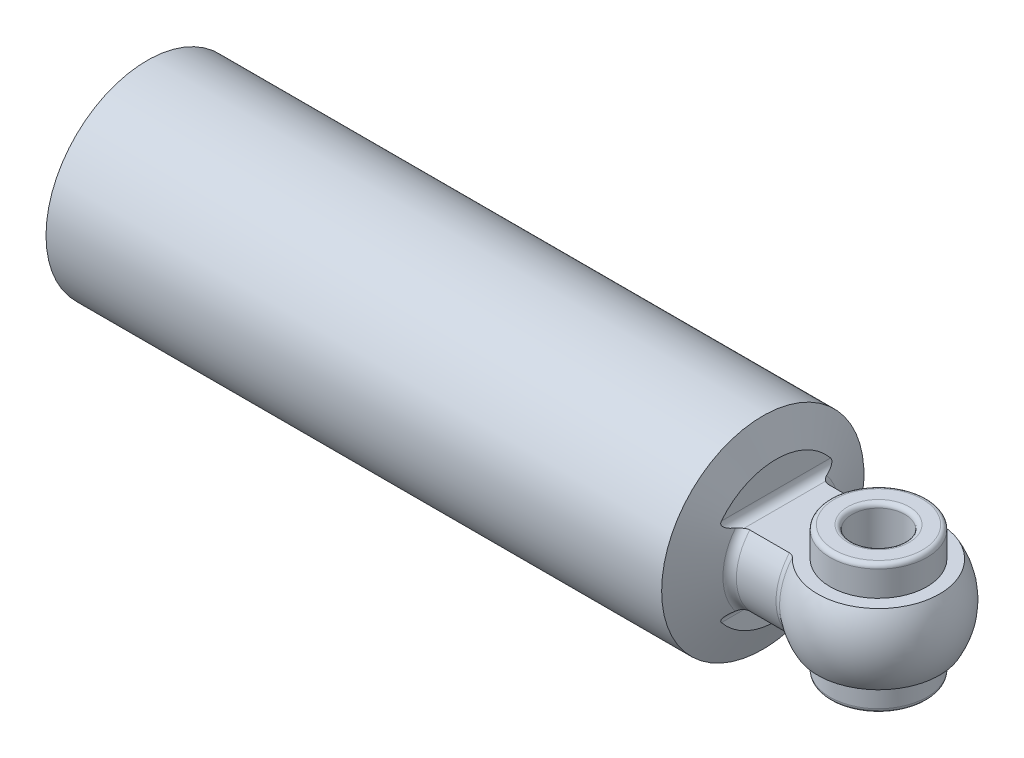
ISO-10303-21;
HEADER;
FILE_DESCRIPTION(('STEP AP214'),'2;1');
FILE_NAME('part.step','',(''),(''),'','','');
FILE_SCHEMA(('AUTOMOTIVE_DESIGN { 1 0 10303 214 1 1 1 1 }'));
ENDSEC;
DATA;
#1=APPLICATION_CONTEXT('core data for automotive mechanical design processes');
#2=APPLICATION_PROTOCOL_DEFINITION('international standard','automotive_design',2000,#1);
#3=PRODUCT_CONTEXT('',#1,'mechanical');
#4=PRODUCT('Part','Part','',(#3));
#5=PRODUCT_RELATED_PRODUCT_CATEGORY('part','',(#4));
#6=PRODUCT_DEFINITION_FORMATION('','',#4);
#7=PRODUCT_DEFINITION_CONTEXT('part definition',#1,'design');
#8=PRODUCT_DEFINITION('design','',#6,#7);
#9=PRODUCT_DEFINITION_SHAPE('','',#8);
#10=(LENGTH_UNIT() NAMED_UNIT(*) SI_UNIT(.MILLI.,.METRE.));
#11=(NAMED_UNIT(*) PLANE_ANGLE_UNIT() SI_UNIT($,.RADIAN.));
#12=(NAMED_UNIT(*) SI_UNIT($,.STERADIAN.) SOLID_ANGLE_UNIT());
#13=UNCERTAINTY_MEASURE_WITH_UNIT(LENGTH_MEASURE(1.E-05),#10,'distance_accuracy_value','');
#14=(GEOMETRIC_REPRESENTATION_CONTEXT(3) GLOBAL_UNCERTAINTY_ASSIGNED_CONTEXT((#13)) GLOBAL_UNIT_ASSIGNED_CONTEXT((#10,
#11,#12)) REPRESENTATION_CONTEXT('',''));
#15=CARTESIAN_POINT('',(0.,0.,0.));
#16=DIRECTION('',(0.,0.,1.));
#17=DIRECTION('',(1.,0.,0.));
#18=AXIS2_PLACEMENT_3D('',#15,#16,#17);
#19=CARTESIAN_POINT('',(67.9999999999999,-8.,-40.));
#20=DIRECTION('',(0.,-1.,0.));
#21=DIRECTION('',(0.,0.,-1.));
#22=AXIS2_PLACEMENT_3D('',#19,#20,#21);
#23=PLANE('',#22);
#24=CARTESIAN_POINT('',(20.6977076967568,-8.,8.97507545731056));
#25=CARTESIAN_POINT('',(20.7836854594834,-8.,8.95745929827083));
#26=CARTESIAN_POINT('',(20.8711723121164,-8.,8.94725511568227));
#27=CARTESIAN_POINT('',(21.0465736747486,-8.,8.94242345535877));
#28=CARTESIAN_POINT('',(21.134488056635,-8.,8.94779156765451));
#29=CARTESIAN_POINT('',(21.3078416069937,-8.,8.97365218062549));
#30=CARTESIAN_POINT('',(21.3932853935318,-8.,8.99411427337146));
#31=CARTESIAN_POINT('',(21.55968200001,-8.,9.04866102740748));
#32=CARTESIAN_POINT('',(21.6406327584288,-8.,9.08275188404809));
#33=CARTESIAN_POINT('',(21.7989315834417,-8.,9.16380617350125));
#34=CARTESIAN_POINT('',(21.8760901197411,-8.,9.21113596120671));
#35=CARTESIAN_POINT('',(22.0231362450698,-8.,9.31594534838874));
#36=CARTESIAN_POINT('',(22.0930193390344,-8.,9.37343116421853));
#37=CARTESIAN_POINT('',(22.2589625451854,-8.,9.5281516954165));
#38=CARTESIAN_POINT('',(22.3501148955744,-8.,9.63067209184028));
#39=CARTESIAN_POINT('',(22.5146389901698,-8.,9.84911315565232));
#40=CARTESIAN_POINT('',(22.5879794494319,-8.,9.96505688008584));
#41=CARTESIAN_POINT('',(22.717920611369,-8.,10.2083154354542));
#42=CARTESIAN_POINT('',(22.7742341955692,-8.,10.3357827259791));
#43=CARTESIAN_POINT('',(22.8684700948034,-8.,10.5972430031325));
#44=CARTESIAN_POINT('',(22.9063965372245,-8.,10.7312345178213));
#45=CARTESIAN_POINT('',(22.9690439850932,-8.,11.028922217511));
#46=CARTESIAN_POINT('',(22.9899112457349,-8.,11.1934438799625));
#47=CARTESIAN_POINT('',(23.0043742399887,-8.,11.5238714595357));
#48=CARTESIAN_POINT('',(22.9979424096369,-8.,11.6897786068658));
#49=CARTESIAN_POINT('',(22.956142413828,-8.,12.0211457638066));
#50=CARTESIAN_POINT('',(22.9202401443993,-8.,12.1865404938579));
#51=CARTESIAN_POINT('',(22.8175781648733,-8.,12.5074095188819));
#52=CARTESIAN_POINT('',(22.7508777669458,-8.,12.6629022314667));
#53=CARTESIAN_POINT('',(22.6091312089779,-8.,12.9158537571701));
#54=CARTESIAN_POINT('',(22.5414779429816,-8.,13.0174798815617));
#55=CARTESIAN_POINT('',(22.3903114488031,-8.,13.2082428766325));
#56=CARTESIAN_POINT('',(22.3068058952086,-8.,13.2973857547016));
#57=CARTESIAN_POINT('',(22.1245782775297,-8.,13.459980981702));
#58=CARTESIAN_POINT('',(22.0257578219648,-8.,13.5333239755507));
#59=CARTESIAN_POINT('',(21.8158115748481,-8.,13.6596329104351));
#60=CARTESIAN_POINT('',(21.704694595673,-8.,13.712613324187));
#61=CARTESIAN_POINT('',(21.488023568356,-8.,13.7899206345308));
#62=CARTESIAN_POINT('',(21.3834285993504,-8.,13.8169428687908));
#63=CARTESIAN_POINT('',(21.1710663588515,-8.,13.851267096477));
#64=CARTESIAN_POINT('',(21.0633010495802,-8.,13.8585810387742));
#65=CARTESIAN_POINT('',(20.8572430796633,-8.,13.8533316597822));
#66=CARTESIAN_POINT('',(20.7589056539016,-8.,13.8423656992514));
#67=CARTESIAN_POINT('',(20.5654915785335,-8.,13.804069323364));
#68=CARTESIAN_POINT('',(20.4704146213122,-8.,13.7767404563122));
#69=CARTESIAN_POINT('',(20.2859554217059,-8.,13.7069271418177));
#70=CARTESIAN_POINT('',(20.1965774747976,-8.,13.6644314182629));
#71=CARTESIAN_POINT('',(20.0255684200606,-8.,13.5660249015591));
#72=CARTESIAN_POINT('',(19.9439391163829,-8.,13.5101109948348));
#73=CARTESIAN_POINT('',(19.7841926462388,-8.,13.3823146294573));
#74=CARTESIAN_POINT('',(19.7067751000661,-8.,13.309560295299));
#75=CARTESIAN_POINT('',(19.5636100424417,-8.,13.1533895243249));
#76=CARTESIAN_POINT('',(19.4978673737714,-8.,13.0699686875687));
#77=CARTESIAN_POINT('',(19.3711093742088,-8.,12.8838394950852));
#78=CARTESIAN_POINT('',(19.3117220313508,-8.,12.7800243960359));
#79=CARTESIAN_POINT('',(19.2085903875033,-8.,12.56492037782));
#80=CARTESIAN_POINT('',(19.1648545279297,-8.,12.4536274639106));
#81=CARTESIAN_POINT('',(19.0873236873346,-8.,12.2088038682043));
#82=CARTESIAN_POINT('',(19.0560628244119,-8.,12.0744706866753));
#83=CARTESIAN_POINT('',(19.0134170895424,-8.,11.8027131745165));
#84=CARTESIAN_POINT('',(19.0020415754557,-8.,11.6652874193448));
#85=CARTESIAN_POINT('',(18.9982025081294,-8.,11.3703236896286));
#86=CARTESIAN_POINT('',(19.0087028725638,-8.,11.2127433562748));
#87=CARTESIAN_POINT('',(19.0539208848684,-8.,10.9009480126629));
#88=CARTESIAN_POINT('',(19.0886671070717,-8.,10.7467371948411));
#89=CARTESIAN_POINT('',(19.1855773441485,-8.,10.4335299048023));
#90=CARTESIAN_POINT('',(19.249711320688,-8.,10.2751365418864));
#91=CARTESIAN_POINT('',(19.4054690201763,-8.,9.97249899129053));
#92=CARTESIAN_POINT('',(19.4970470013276,-8.,9.82823178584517));
#93=CARTESIAN_POINT('',(19.6742347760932,-8.,9.60380320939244));
#94=CARTESIAN_POINT('',(19.752508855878,-8.,9.51783073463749));
#95=CARTESIAN_POINT('',(19.9217362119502,-8.,9.35931578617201));
#96=CARTESIAN_POINT('',(20.0126781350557,-8.,9.28676142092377));
#97=CARTESIAN_POINT('',(20.1989571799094,-8.,9.16414362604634));
#98=CARTESIAN_POINT('',(20.2934354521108,-8.,9.11279025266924));
#99=CARTESIAN_POINT('',(20.4904413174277,-8.,9.02900431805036));
#100=CARTESIAN_POINT('',(20.5929544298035,-8.,8.99653856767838));
#101=CARTESIAN_POINT('',(20.6977076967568,-8.,8.97507545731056));
#102=B_SPLINE_CURVE_WITH_KNOTS('',3,(#24,#25,#26,#27,#28,#29,#30,#31,#32,#33,#34,#35,#36,#37,
#38,#39,#40,#41,#42,#43,#44,#45,#46,#47,#48,#49,#50,#51,#52,#53,#54,#55,#56,#57,#58,#59,#60,#61,
#62,#63,#64,#65,#66,#67,#68,#69,#70,#71,#72,#73,#74,#75,#76,#77,#78,#79,#80,#81,#82,#83,#84,#85,
#86,#87,#88,#89,#90,#91,#92,#93,#94,#95,#96,#97,#98,#99,#100,#101),.UNSPECIFIED.,.T.,.F.,(4,2,2,
2,2,2,2,2,2,2,2,2,2,2,2,2,2,2,2,2,2,2,2,2,2,2,2,2,2,2,2,2,2,2,2,2,2,2,4),(0.,0.262922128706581,
0.52576980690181,0.788089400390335,1.05052837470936,1.32110457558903,1.59184696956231,
2.00115553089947,2.41117788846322,2.82777149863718,3.24427155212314,3.73953769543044,
4.23530402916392,4.74025902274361,5.24424558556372,5.60903709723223,5.97365245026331,
6.34071562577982,6.70751742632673,7.02984465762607,7.35197642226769,7.64740691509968,
7.94280945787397,8.23843208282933,8.53412337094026,8.85155742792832,9.16912285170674,
9.52653142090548,9.88413246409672,10.2962830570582,10.7086275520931,11.1804372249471,
11.6528038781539,12.1629363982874,12.6722233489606,13.019821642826,13.3671103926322,
13.6880140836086,14.0083521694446),.UNSPECIFIED.);
#103=CARTESIAN_POINT('',(20.0000000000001,-8.,9.30067617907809));
#104=VERTEX_POINT('',#103);
#105=CARTESIAN_POINT('',(21.,-8.,8.94427190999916));
#106=VERTEX_POINT('',#105);
#107=EDGE_CURVE('E454',#104,#106,#102,.T.);
#108=ORIENTED_EDGE('',*,*,#107,.F.);
#109=DIRECTION('',(0.,0.,1.));
#110=VECTOR('',#109,1.);
#111=CARTESIAN_POINT('',(20.,-8.,-40.));
#112=LINE('',#111,#110);
#113=CARTESIAN_POINT('',(19.9999999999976,-8.,-9.30067617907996));
#114=VERTEX_POINT('',#113);
#115=EDGE_CURVE('E557',#104,#114,#112,.F.);
#116=ORIENTED_EDGE('',*,*,#115,.T.);
#117=CARTESIAN_POINT('',(19.3751672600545,-8.,-12.8845749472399));
#118=CARTESIAN_POINT('',(19.4363562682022,-8.,-12.9849184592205));
#119=CARTESIAN_POINT('',(19.5051925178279,-8.,-13.0807801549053));
#120=CARTESIAN_POINT('',(19.6576340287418,-8.,-13.2602724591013));
#121=CARTESIAN_POINT('',(19.7412667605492,-8.,-13.3438797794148));
#122=CARTESIAN_POINT('',(19.9223981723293,-8.,-13.4956593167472));
#123=CARTESIAN_POINT('',(20.0199664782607,-8.,-13.563749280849));
#124=CARTESIAN_POINT('',(20.226132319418,-8.,-13.6803751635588));
#125=CARTESIAN_POINT('',(20.334717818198,-8.,-13.728932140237));
#126=CARTESIAN_POINT('',(20.5481913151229,-8.,-13.7999736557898));
#127=CARTESIAN_POINT('',(20.6523787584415,-8.,-13.8245656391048));
#128=CARTESIAN_POINT('',(20.8634897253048,-8.,-13.8542869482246));
#129=CARTESIAN_POINT('',(20.9704120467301,-8.,-13.8594246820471));
#130=CARTESIAN_POINT('',(21.1751647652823,-8.,-13.8503376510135));
#131=CARTESIAN_POINT('',(21.2730633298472,-8.,-13.8375681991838));
#132=CARTESIAN_POINT('',(21.4653240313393,-8.,-13.7958390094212));
#133=CARTESIAN_POINT('',(21.5596864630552,-8.,-13.7668806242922));
#134=CARTESIAN_POINT('',(21.7429119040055,-8.,-13.6938753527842));
#135=CARTESIAN_POINT('',(21.8317438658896,-8.,-13.649751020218));
#136=CARTESIAN_POINT('',(22.001443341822,-8.,-13.5482350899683));
#137=CARTESIAN_POINT('',(22.0823089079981,-8.,-13.4908402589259));
#138=CARTESIAN_POINT('',(22.2405554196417,-8.,-13.3599433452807));
#139=CARTESIAN_POINT('',(22.3171904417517,-8.,-13.2855421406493));
#140=CARTESIAN_POINT('',(22.4585811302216,-8.,-13.1262321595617));
#141=CARTESIAN_POINT('',(22.5233317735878,-8.,-13.0413189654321));
#142=CARTESIAN_POINT('',(22.6479308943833,-8.,-12.852007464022));
#143=CARTESIAN_POINT('',(22.7060995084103,-8.,-12.7465054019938));
#144=CARTESIAN_POINT('',(22.8065731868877,-8.,-12.5282247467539));
#145=CARTESIAN_POINT('',(22.8488695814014,-8.,-12.4154422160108));
#146=CARTESIAN_POINT('',(22.9231229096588,-8.,-12.1675665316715));
#147=CARTESIAN_POINT('',(22.9525044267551,-8.,-12.0317017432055));
#148=CARTESIAN_POINT('',(22.9911572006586,-8.,-11.7571687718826));
#149=CARTESIAN_POINT('',(23.0004191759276,-8.,-11.6184993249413));
#150=CARTESIAN_POINT('',(22.9994900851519,-8.,-11.3214493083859));
#151=CARTESIAN_POINT('',(22.9863409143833,-8.,-11.1630739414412));
#152=CARTESIAN_POINT('',(22.9355976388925,-8.,-10.8501256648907));
#153=CARTESIAN_POINT('',(22.8979737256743,-8.,-10.6955576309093));
#154=CARTESIAN_POINT('',(22.7950911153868,-8.,-10.3830490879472));
#155=CARTESIAN_POINT('',(22.7279894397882,-8.,-10.2257090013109));
#156=CARTESIAN_POINT('',(22.5662230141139,-8.,-9.92588125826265));
#157=CARTESIAN_POINT('',(22.4716061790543,-8.,-9.78336836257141));
#158=CARTESIAN_POINT('',(22.2906949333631,-8.,-9.56448152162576));
#159=CARTESIAN_POINT('',(22.2119833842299,-8.,-9.48181454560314));
#160=CARTESIAN_POINT('',(22.0424526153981,-8.,-9.32999493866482));
#161=CARTESIAN_POINT('',(21.951653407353,-8.,-9.26082042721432));
#162=CARTESIAN_POINT('',(21.7764287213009,-8.,-9.15096339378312));
#163=CARTESIAN_POINT('',(21.6938232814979,-8.,-9.10739017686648));
#164=CARTESIAN_POINT('',(21.5225077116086,-8.,-9.03449283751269));
#165=CARTESIAN_POINT('',(21.4338015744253,-8.,-9.00515949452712));
#166=CARTESIAN_POINT('',(21.2519677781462,-8.,-8.96276271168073));
#167=CARTESIAN_POINT('',(21.1588171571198,-8.,-8.94979610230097));
#168=CARTESIAN_POINT('',(20.9717410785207,-8.,-8.94160698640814));
#169=CARTESIAN_POINT('',(20.8778158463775,-8.,-8.94637948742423));
#170=CARTESIAN_POINT('',(20.7014867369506,-8.,-8.97190445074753));
#171=CARTESIAN_POINT('',(20.6188454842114,-8.,-8.99107096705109));
#172=CARTESIAN_POINT('',(20.4576566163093,-8.,-9.04219933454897));
#173=CARTESIAN_POINT('',(20.3791097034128,-8.,-9.0741633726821));
#174=CARTESIAN_POINT('',(20.2227497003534,-8.,-9.15148408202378));
#175=CARTESIAN_POINT('',(20.1452939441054,-8.,-9.19755705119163));
#176=CARTESIAN_POINT('',(19.9975218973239,-8.,-9.29997064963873));
#177=CARTESIAN_POINT('',(19.9272110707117,-8.,-9.3563190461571));
#178=CARTESIAN_POINT('',(19.7606172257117,-8.,-9.50783281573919));
#179=CARTESIAN_POINT('',(19.6690939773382,-8.,-9.60825268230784));
#180=CARTESIAN_POINT('',(19.5034919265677,-8.,-9.82257591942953));
#181=CARTESIAN_POINT('',(19.4294436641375,-8.,-9.9365023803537));
#182=CARTESIAN_POINT('',(19.297719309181,-8.,-10.1758397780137));
#183=CARTESIAN_POINT('',(19.2403311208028,-8.,-10.3014082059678));
#184=CARTESIAN_POINT('',(19.1436024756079,-8.,-10.5591923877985));
#185=CARTESIAN_POINT('',(19.1042558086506,-8.,-10.6914058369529));
#186=CARTESIAN_POINT('',(19.0379097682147,-8.,-10.9861609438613));
#187=CARTESIAN_POINT('',(19.014806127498,-8.,-11.1495954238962));
#188=CARTESIAN_POINT('',(18.9954889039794,-8.,-11.4782953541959));
#189=CARTESIAN_POINT('',(18.9993201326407,-8.,-11.6435633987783));
#190=CARTESIAN_POINT('',(19.0357253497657,-8.,-11.9756310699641));
#191=CARTESIAN_POINT('',(19.0690622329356,-8.,-12.1423542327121));
#192=CARTESIAN_POINT('',(19.1421366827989,-8.,-12.3849656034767));
#193=CARTESIAN_POINT('',(19.1702821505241,-8.,-12.4644804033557));
#194=CARTESIAN_POINT('',(19.2343449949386,-8.,-12.6202928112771));
#195=CARTESIAN_POINT('',(19.2702546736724,-8.,-12.6965935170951));
#196=CARTESIAN_POINT('',(19.3306974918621,-8.,-12.8092932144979));
#197=CARTESIAN_POINT('',(19.3524031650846,-8.,-12.8472442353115));
#198=CARTESIAN_POINT('',(19.3751672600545,-8.,-12.8845749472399));
#199=B_SPLINE_CURVE_WITH_KNOTS('',3,(#117,#118,#119,#120,#121,#122,#123,#124,#125,#126,#127,
#128,#129,#130,#131,#132,#133,#134,#135,#136,#137,#138,#139,#140,#141,#142,#143,#144,#145,#146,
#147,#148,#149,#150,#151,#152,#153,#154,#155,#156,#157,#158,#159,#160,#161,#162,#163,#164,#165,
#166,#167,#168,#169,#170,#171,#172,#173,#174,#175,#176,#177,#178,#179,#180,#181,#182,#183,#184,
#185,#186,#187,#188,#189,#190,#191,#192,#193,#194,#195,#196,#197,#198),.UNSPECIFIED.,.T.,.F.,(4,
2,2,2,2,2,2,2,2,2,2,2,2,2,2,2,2,2,2,2,2,2,2,2,2,2,2,2,2,2,2,2,2,2,2,2,2,2,2,2,4),(0.,
0.352459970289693,0.705581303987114,1.06053301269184,1.41510102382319,1.7345198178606,
2.05380054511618,2.34858497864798,2.64334478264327,2.93963273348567,3.23599295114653,
3.5551385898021,3.87441880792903,4.2344405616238,4.59465868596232,5.01004219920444,
5.42561729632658,5.90037366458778,6.3757093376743,6.88630675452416,7.39602028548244,
7.73728851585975,8.07799862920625,8.35705293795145,8.63592631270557,8.91644196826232,
9.19687868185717,9.45026259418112,9.70368982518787,9.97306747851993,10.2426496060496,
10.6480391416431,11.0541319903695,11.4668736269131,11.8794730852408,12.3724080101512,
12.8661632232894,13.3730704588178,13.625791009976,13.8782621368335,14.009387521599),.UNSPECIFIED.);
#200=CARTESIAN_POINT('',(21.,-8.,-8.94427190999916));
#201=VERTEX_POINT('',#200);
#202=EDGE_CURVE('E447',#201,#114,#199,.T.);
#203=ORIENTED_EDGE('',*,*,#202,.F.);
#204=DIRECTION('',(-1.,0.,0.));
#205=VECTOR('',#204,1.);
#206=CARTESIAN_POINT('',(41.3137084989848,-8.,-8.94427190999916));
#207=LINE('',#206,#205);
#208=CARTESIAN_POINT('',(30.,-8.,-8.94427190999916));
#209=VERTEX_POINT('',#208);
#210=EDGE_CURVE('E477',#201,#209,#207,.F.);
#211=ORIENTED_EDGE('',*,*,#210,.T.);
#212=CARTESIAN_POINT('',(31.1213245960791,-8.,-9.40064550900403));
#213=CARTESIAN_POINT('',(31.2268814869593,-8.,-9.4944949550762));
#214=CARTESIAN_POINT('',(31.3231633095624,-8.,-9.5988222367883));
#215=CARTESIAN_POINT('',(31.496699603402,-8.,-9.82225663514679));
#216=CARTESIAN_POINT('',(31.5739163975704,-8.,-9.94139232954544));
#217=CARTESIAN_POINT('',(31.7088083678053,-8.,-10.1890115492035));
#218=CARTESIAN_POINT('',(31.766626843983,-8.,-10.3174176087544));
#219=CARTESIAN_POINT('',(31.8634818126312,-8.,-10.5809984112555));
#220=CARTESIAN_POINT('',(31.9025262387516,-8.,-10.7161702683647));
#221=CARTESIAN_POINT('',(31.9667777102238,-8.,-11.0145943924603));
#222=CARTESIAN_POINT('',(31.9883856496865,-8.,-11.1786337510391));
#223=CARTESIAN_POINT('',(32.0044900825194,-8.,-11.5082295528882));
#224=CARTESIAN_POINT('',(31.9989586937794,-8.,-11.6737873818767));
#225=CARTESIAN_POINT('',(31.959085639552,-8.,-12.0051630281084));
#226=CARTESIAN_POINT('',(31.9241201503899,-8.,-12.1709082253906));
#227=CARTESIAN_POINT('',(31.8233078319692,-8.,-12.4926769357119));
#228=CARTESIAN_POINT('',(31.7575195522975,-8.,-12.6487182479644));
#229=CARTESIAN_POINT('',(31.6171640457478,-8.,-12.9030353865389));
#230=CARTESIAN_POINT('',(31.5499716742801,-8.,-13.0054051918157));
#231=CARTESIAN_POINT('',(31.3995999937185,-8.,-13.1977239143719));
#232=CARTESIAN_POINT('',(31.3164283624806,-8.,-13.287678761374));
#233=CARTESIAN_POINT('',(31.1347131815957,-8.,-13.4519504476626));
#234=CARTESIAN_POINT('',(31.0360695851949,-8.,-13.526157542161));
#235=CARTESIAN_POINT('',(30.8262976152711,-8.,-13.6541937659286));
#236=CARTESIAN_POINT('',(30.7151782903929,-8.,-13.7080375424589));
#237=CARTESIAN_POINT('',(30.4984163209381,-8.,-13.7868792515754));
#238=CARTESIAN_POINT('',(30.3937597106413,-8.,-13.8145951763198));
#239=CARTESIAN_POINT('',(30.1811451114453,-8.,-13.8502526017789));
#240=CARTESIAN_POINT('',(30.0731892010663,-8.,-13.8582063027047));
#241=CARTESIAN_POINT('',(29.8668054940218,-8.,-13.8540984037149));
#242=CARTESIAN_POINT('',(29.7683411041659,-8.,-13.8436663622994));
#243=CARTESIAN_POINT('',(29.5745913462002,-8.,-13.8063866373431));
#244=CARTESIAN_POINT('',(29.4793056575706,-8.,-13.7795406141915));
#245=CARTESIAN_POINT('',(29.2944860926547,-8.,-13.7106701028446));
#246=CARTESIAN_POINT('',(29.2049490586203,-8.,-13.6686540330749));
#247=CARTESIAN_POINT('',(29.0335575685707,-8.,-13.5711632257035));
#248=CARTESIAN_POINT('',(28.9517048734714,-8.,-13.5156854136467));
#249=CARTESIAN_POINT('',(28.7915215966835,-8.,-13.3888006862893));
#250=CARTESIAN_POINT('',(28.7138771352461,-8.,-13.3165302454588));
#251=CARTESIAN_POINT('',(28.5701967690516,-8.,-13.1612820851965));
#252=CARTESIAN_POINT('',(28.5041656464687,-8.,-13.0782999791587));
#253=CARTESIAN_POINT('',(28.3767816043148,-8.,-12.8931066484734));
#254=CARTESIAN_POINT('',(28.3170413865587,-8.,-12.7897881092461));
#255=CARTESIAN_POINT('',(28.2131390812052,-8.,-12.5756195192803));
#256=CARTESIAN_POINT('',(28.168985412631,-8.,-12.4647654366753));
#257=CARTESIAN_POINT('',(28.0905038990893,-8.,-12.2208433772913));
#258=CARTESIAN_POINT('',(28.0586978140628,-8.,-12.0869640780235));
#259=CARTESIAN_POINT('',(28.0148930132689,-8.,-11.8160315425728));
#260=CARTESIAN_POINT('',(28.0029035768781,-8.,-11.6789768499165));
#261=CARTESIAN_POINT('',(27.997677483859,-8.,-11.3846433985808));
#262=CARTESIAN_POINT('',(28.0074058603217,-8.,-11.2273082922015));
#263=CARTESIAN_POINT('',(28.0510127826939,-8.,-10.9158785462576));
#264=CARTESIAN_POINT('',(28.0849192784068,-8.,-10.761787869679));
#265=CARTESIAN_POINT('',(28.1800730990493,-8.,-10.4484314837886));
#266=CARTESIAN_POINT('',(28.2433236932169,-8.,-10.2897677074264));
#267=CARTESIAN_POINT('',(28.3973007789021,-8.,-9.98635419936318));
#268=CARTESIAN_POINT('',(28.4879869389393,-8.,-9.84158445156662));
#269=CARTESIAN_POINT('',(28.6640985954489,-8.,-9.61549682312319));
#270=CARTESIAN_POINT('',(28.742272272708,-8.,-9.52850883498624));
#271=CARTESIAN_POINT('',(28.91141951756,-8.,-9.36801755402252));
#272=CARTESIAN_POINT('',(29.0023718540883,-8.,-9.29449235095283));
#273=CARTESIAN_POINT('',(29.1778239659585,-8.,-9.17737280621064));
#274=CARTESIAN_POINT('',(29.2602924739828,-8.,-9.13074778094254));
#275=CARTESIAN_POINT('',(29.431825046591,-8.,-9.05170844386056));
#276=CARTESIAN_POINT('',(29.520884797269,-8.,-9.01928493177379));
#277=CARTESIAN_POINT('',(29.7040575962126,-8.,-8.97083769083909));
#278=CARTESIAN_POINT('',(29.7981999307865,-8.,-8.95492280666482));
#279=CARTESIAN_POINT('',(29.9877895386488,-8.,-8.94130676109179));
#280=CARTESIAN_POINT('',(30.0832362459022,-8.,-8.94359793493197));
#281=CARTESIAN_POINT('',(30.261802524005,-8.,-8.96492729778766));
#282=CARTESIAN_POINT('',(30.3451481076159,-8.,-8.98214685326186));
#283=CARTESIAN_POINT('',(30.5079807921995,-8.,-9.02969008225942));
#284=CARTESIAN_POINT('',(30.5874671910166,-8.,-9.06001613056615));
#285=CARTESIAN_POINT('',(30.7474097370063,-8.,-9.13501527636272));
#286=CARTESIAN_POINT('',(30.8274033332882,-8.,-9.18066679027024));
#287=CARTESIAN_POINT('',(30.9800198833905,-8.,-9.28294173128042));
#288=CARTESIAN_POINT('',(31.052635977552,-8.,-9.33957522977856));
#289=CARTESIAN_POINT('',(31.1213245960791,-8.,-9.40064550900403));
#290=B_SPLINE_CURVE_WITH_KNOTS('',3,(#212,#213,#214,#215,#216,#217,#218,#219,#220,#221,#222,
#223,#224,#225,#226,#227,#228,#229,#230,#231,#232,#233,#234,#235,#236,#237,#238,#239,#240,#241,
#242,#243,#244,#245,#246,#247,#248,#249,#250,#251,#252,#253,#254,#255,#256,#257,#258,#259,#260,
#261,#262,#263,#264,#265,#266,#267,#268,#269,#270,#271,#272,#273,#274,#275,#276,#277,#278,#279,
#280,#281,#282,#283,#284,#285,#286,#287,#288,#289),.UNSPECIFIED.,.T.,.F.,(4,2,2,2,2,2,2,2,2,2,2,
2,2,2,2,2,2,2,2,2,2,2,2,2,2,2,2,2,2,2,2,2,2,2,2,2,2,2,4),(0.,0.423333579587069,
0.847497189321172,1.26845461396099,1.68923399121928,2.18337148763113,2.67801675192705,
3.18341737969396,3.68786183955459,4.05374788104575,4.41945855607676,4.78763972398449,
5.15555555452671,5.47858073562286,5.80140644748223,6.09703884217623,6.39264133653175,
6.68808004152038,6.98358628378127,7.30052687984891,7.61759768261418,7.97424528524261,
8.33108523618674,8.74228923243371,9.15368572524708,9.62461999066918,10.0960995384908,
10.6060091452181,11.1151727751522,11.4648301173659,11.8139132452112,12.0969960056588,
12.3798951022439,12.6646477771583,12.9492805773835,13.2034498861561,13.4576652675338,
13.7328858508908,14.0083600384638),.UNSPECIFIED.);
#291=CARTESIAN_POINT('',(31.2570787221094,-8.,-9.53227137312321));
#292=VERTEX_POINT('',#291);
#293=EDGE_CURVE('E431',#209,#292,#290,.T.);
#294=ORIENTED_EDGE('',*,*,#293,.T.);
#295=CARTESIAN_POINT('',(41.3137084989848,-8.,0.));
#296=DIRECTION('',(0.,-1.,0.));
#297=DIRECTION('',(0.,0.,-1.));
#298=AXIS2_PLACEMENT_3D('',#295,#296,#297);
#299=CIRCLE('',#298,13.856406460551);
#300=CARTESIAN_POINT('',(31.2570787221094,-8.,9.53227137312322));
#301=VERTEX_POINT('',#300);
#302=EDGE_CURVE('E436',#292,#301,#299,.T.);
#303=ORIENTED_EDGE('',*,*,#302,.T.);
#304=CARTESIAN_POINT('',(30.457364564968,-8.,9.01525126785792));
#305=CARTESIAN_POINT('',(30.3747276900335,-8.,8.98929721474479));
#306=CARTESIAN_POINT('',(30.2899643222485,-8.,8.97008531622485));
#307=CARTESIAN_POINT('',(30.1183946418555,-8.,8.9464880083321));
#308=CARTESIAN_POINT('',(30.0315892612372,-8.,8.94209596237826));
#309=CARTESIAN_POINT('',(29.8585296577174,-8.,8.94847303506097));
#310=CARTESIAN_POINT('',(29.7722755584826,-8.,8.9592454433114));
#311=CARTESIAN_POINT('',(29.6028193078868,-8.,8.99513910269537));
#312=CARTESIAN_POINT('',(29.519618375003,-8.,9.0202660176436));
#313=CARTESIAN_POINT('',(29.3581061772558,-8.,9.0832613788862));
#314=CARTESIAN_POINT('',(29.27980259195,-8.,9.12114926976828));
#315=CARTESIAN_POINT('',(29.1294174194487,-8.,9.20766572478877));
#316=CARTESIAN_POINT('',(29.057338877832,-8.,9.25629950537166));
#317=CARTESIAN_POINT('',(28.8882648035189,-8.,9.38696336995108));
#318=CARTESIAN_POINT('',(28.7951553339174,-8.,9.47403836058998));
#319=CARTESIAN_POINT('',(28.6242204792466,-8.,9.66213133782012));
#320=CARTESIAN_POINT('',(28.5464290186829,-8.,9.76317944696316));
#321=CARTESIAN_POINT('',(28.3885352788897,-8.,10.0022282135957));
#322=CARTESIAN_POINT('',(28.3128059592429,-8.,10.1431181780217));
#323=CARTESIAN_POINT('',(28.1854528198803,-8.,10.4352854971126));
#324=CARTESIAN_POINT('',(28.133836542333,-8.,10.5865660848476));
#325=CARTESIAN_POINT('',(28.0546066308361,-8.,10.8966518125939));
#326=CARTESIAN_POINT('',(28.027200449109,-8.,11.0555099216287));
#327=CARTESIAN_POINT('',(27.9978776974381,-8.,11.3756351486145));
#328=CARTESIAN_POINT('',(27.9959699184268,-8.,11.5369030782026));
#329=CARTESIAN_POINT('',(28.0193623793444,-8.,11.8665302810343));
#330=CARTESIAN_POINT('',(28.0461737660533,-8.,12.0347882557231));
#331=CARTESIAN_POINT('',(28.1307586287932,-8.,12.3633305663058));
#332=CARTESIAN_POINT('',(28.1884866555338,-8.,12.5236262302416));
#333=CARTESIAN_POINT('',(28.3163737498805,-8.,12.7892415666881));
#334=CARTESIAN_POINT('',(28.3793942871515,-8.,12.8980163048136));
#335=CARTESIAN_POINT('',(28.5225181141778,-8.,13.1037606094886));
#336=CARTESIAN_POINT('',(28.6026132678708,-8.,13.2007357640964));
#337=CARTESIAN_POINT('',(28.7795196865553,-8.,13.3795409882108));
#338=CARTESIAN_POINT('',(28.8764457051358,-8.,13.4612585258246));
#339=CARTESIAN_POINT('',(29.0843538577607,-8.,13.604351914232));
#340=CARTESIAN_POINT('',(29.1953248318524,-8.,13.6657437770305));
#341=CARTESIAN_POINT('',(29.4126286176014,-8.,13.7580071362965));
#342=CARTESIAN_POINT('',(29.5177301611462,-8.,13.7917836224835));
#343=CARTESIAN_POINT('',(29.7323793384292,-8.,13.8391068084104));
#344=CARTESIAN_POINT('',(29.8419237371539,-8.,13.8526679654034));
#345=CARTESIAN_POINT('',(30.0510444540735,-8.,13.8585065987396));
#346=CARTESIAN_POINT('',(30.1505723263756,-8.,13.8526952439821));
#347=CARTESIAN_POINT('',(30.3471662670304,-8.,13.8242136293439));
#348=CARTESIAN_POINT('',(30.4442327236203,-8.,13.8015460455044));
#349=CARTESIAN_POINT('',(30.6321046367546,-8.,13.7407782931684));
#350=CARTESIAN_POINT('',(30.7229703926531,-8.,13.7028631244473));
#351=CARTESIAN_POINT('',(30.8975724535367,-8.,13.6132000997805));
#352=CARTESIAN_POINT('',(30.9813073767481,-8.,13.5614495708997));
#353=CARTESIAN_POINT('',(31.1451353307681,-8.,13.4423293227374));
#354=CARTESIAN_POINT('',(31.2246549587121,-8.,13.3741736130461));
#355=CARTESIAN_POINT('',(31.3726097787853,-8.,13.2267732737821));
#356=CARTESIAN_POINT('',(31.4410406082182,-8.,13.1475243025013));
#357=CARTESIAN_POINT('',(31.5736024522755,-8.,12.9702948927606));
#358=CARTESIAN_POINT('',(31.6362508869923,-8.,12.8712076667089));
#359=CARTESIAN_POINT('',(31.7465187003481,-8.,12.665023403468));
#360=CARTESIAN_POINT('',(31.794130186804,-8.,12.5579221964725));
#361=CARTESIAN_POINT('',(31.8804664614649,-8.,12.3217548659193));
#362=CARTESIAN_POINT('',(31.9167790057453,-8.,12.1918072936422));
#363=CARTESIAN_POINT('',(31.9701815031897,-8.,11.9280488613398));
#364=CARTESIAN_POINT('',(31.9872621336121,-8.,11.7942361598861));
#365=CARTESIAN_POINT('',(32.0040185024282,-8.,11.5055695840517));
#366=CARTESIAN_POINT('',(32.0007343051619,-8.,11.3505408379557));
#367=CARTESIAN_POINT('',(31.9705939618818,-8.,11.0426853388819));
#368=CARTESIAN_POINT('',(31.943713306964,-8.,10.8898610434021));
#369=CARTESIAN_POINT('',(31.8633659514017,-8.,10.5758548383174));
#370=CARTESIAN_POINT('',(31.8076266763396,-8.,10.4152481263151));
#371=CARTESIAN_POINT('',(31.6689277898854,-8.,10.106209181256));
#372=CARTESIAN_POINT('',(31.5859958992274,-8.,9.95776474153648));
#373=CARTESIAN_POINT('',(31.4196830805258,-8.,9.71837147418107));
#374=CARTESIAN_POINT('',(31.3428024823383,-8.,9.62289311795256));
#375=CARTESIAN_POINT('',(31.1748418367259,-8.,9.44533236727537));
#376=CARTESIAN_POINT('',(31.08378238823,-8.,9.36323088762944));
#377=CARTESIAN_POINT('',(30.9060387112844,-8.,9.23031743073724));
#378=CARTESIAN_POINT('',(30.8215897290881,-8.,9.17652957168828));
#379=CARTESIAN_POINT('',(30.6448149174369,-8.,9.08394525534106));
#380=CARTESIAN_POINT('',(30.5524989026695,-8.,9.04513044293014));
#381=CARTESIAN_POINT('',(30.457364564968,-8.,9.01525126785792));
#382=B_SPLINE_CURVE_WITH_KNOTS('',3,(#304,#305,#306,#307,#308,#309,#310,#311,#312,#313,#314,
#315,#316,#317,#318,#319,#320,#321,#322,#323,#324,#325,#326,#327,#328,#329,#330,#331,#332,#333,
#334,#335,#336,#337,#338,#339,#340,#341,#342,#343,#344,#345,#346,#347,#348,#349,#350,#351,#352,
#353,#354,#355,#356,#357,#358,#359,#360,#361,#362,#363,#364,#365,#366,#367,#368,#369,#370,#371,
#372,#373,#374,#375,#376,#377,#378,#379,#380,#381),.UNSPECIFIED.,.T.,.F.,(4,2,2,2,2,2,2,2,2,2,2,
2,2,2,2,2,2,2,2,2,2,2,2,2,2,2,2,2,2,2,2,2,2,2,2,2,2,2,4),(0.,0.259533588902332,
0.518950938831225,0.778424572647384,1.03800065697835,1.29797407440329,1.55807397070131,
1.93842097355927,2.31960107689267,2.79699563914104,3.27453942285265,3.75613657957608,
4.23789976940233,4.74631692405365,5.25398871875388,5.62961747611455,6.00506764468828,
6.38318608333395,6.76100593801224,7.09035684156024,7.41947209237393,7.71711706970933,
8.01471480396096,8.30880574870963,8.60295355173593,8.91587234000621,9.22891394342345,
9.57923566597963,9.92974095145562,10.3329426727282,10.7363397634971,11.1996169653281,
11.6633759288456,12.170965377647,12.6780389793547,13.0445148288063,13.4104631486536,
13.7096148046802,14.0083985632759),.UNSPECIFIED.);
#383=CARTESIAN_POINT('',(30.,-8.,8.94427190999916));
#384=VERTEX_POINT('',#383);
#385=EDGE_CURVE('E451',#301,#384,#382,.T.);
#386=ORIENTED_EDGE('',*,*,#385,.T.);
#387=DIRECTION('',(-1.,0.,0.));
#388=VECTOR('',#387,1.);
#389=CARTESIAN_POINT('',(41.3137084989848,-8.,8.94427190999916));
#390=LINE('',#389,#388);
#391=EDGE_CURVE('E480',#384,#106,#390,.T.);
#392=ORIENTED_EDGE('',*,*,#391,.T.);
#393=EDGE_LOOP('',(#108,#116,#203,#211,#294,#303,#386,#392));
#394=FACE_BOUND('',#393,.T.);
#395=CARTESIAN_POINT('',(41.3137084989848,-8.,0.));
#396=DIRECTION('',(0.,-1.,0.));
#397=DIRECTION('',(0.,0.,-1.));
#398=AXIS2_PLACEMENT_3D('',#395,#396,#397);
#399=CIRCLE('',#398,11.);
#400=CARTESIAN_POINT('',(41.3137084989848,-8.,-11.));
#401=VERTEX_POINT('',#400);
#402=EDGE_CURVE('E391',#401,#401,#399,.F.);
#403=ORIENTED_EDGE('',*,*,#402,.T.);
#404=EDGE_LOOP('',(#403));
#405=FACE_BOUND('',#404,.T.);
#406=ADVANCED_FACE('F26',(#394,#405),#23,.T.);
#407=CARTESIAN_POINT('',(67.9999999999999,8.,-40.));
#408=DIRECTION('',(0.,1.,0.));
#409=DIRECTION('',(0.,0.,-1.));
#410=AXIS2_PLACEMENT_3D('',#407,#408,#409);
#411=PLANE('',#410);
#412=CARTESIAN_POINT('',(19.3751672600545,8.,-12.8845749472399));
#413=CARTESIAN_POINT('',(19.3306425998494,8.,-12.8115511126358));
#414=CARTESIAN_POINT('',(19.2901215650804,8.,-12.7360836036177));
#415=CARTESIAN_POINT('',(19.2171017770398,8.,-12.5813402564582));
#416=CARTESIAN_POINT('',(19.1846095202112,8.,-12.5020613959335));
#417=CARTESIAN_POINT('',(19.0990033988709,8.,-12.2596346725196));
#418=CARTESIAN_POINT('',(19.0578813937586,8.,-12.0921009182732));
#419=CARTESIAN_POINT('',(19.0106434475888,8.,-11.7793742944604));
#420=CARTESIAN_POINT('',(19.0000488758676,8.,-11.6347983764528));
#421=CARTESIAN_POINT('',(18.9999515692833,8.,-11.3457658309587));
#422=CARTESIAN_POINT('',(19.0104297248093,8.,-11.2013092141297));
#423=CARTESIAN_POINT('',(19.0548467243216,8.,-10.8940248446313));
#424=CARTESIAN_POINT('',(19.0920455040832,8.,-10.7316631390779));
#425=CARTESIAN_POINT('',(19.1927479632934,8.,-10.4151552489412));
#426=CARTESIAN_POINT('',(19.2562608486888,8.,-10.2610119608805));
#427=CARTESIAN_POINT('',(19.3958620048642,8.,-9.99240600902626));
#428=CARTESIAN_POINT('',(19.4677338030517,8.,-9.8757493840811));
#429=CARTESIAN_POINT('',(19.6292835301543,8.,-9.65548089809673));
#430=CARTESIAN_POINT('',(19.7189344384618,8.,-9.55184962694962));
#431=CARTESIAN_POINT('',(19.8931764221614,8.,-9.38450348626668));
#432=CARTESIAN_POINT('',(19.9742057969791,8.,-9.31708629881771));
#433=CARTESIAN_POINT('',(20.1460890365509,8.,-9.19616950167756));
#434=CARTESIAN_POINT('',(20.2369302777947,8.,-9.14265230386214));
#435=CARTESIAN_POINT('',(20.4119674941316,8.,-9.06004423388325));
#436=CARTESIAN_POINT('',(20.4949710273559,8.,-9.02843875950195));
#437=CARTESIAN_POINT('',(20.6651134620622,8.,-8.97957099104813));
#438=CARTESIAN_POINT('',(20.7522496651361,8.,-8.96229947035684));
#439=CARTESIAN_POINT('',(20.9285102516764,8.,-8.94335954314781));
#440=CARTESIAN_POINT('',(21.0176401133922,8.,-8.94174133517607));
#441=CARTESIAN_POINT('',(21.1947626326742,8.,-8.9543731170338));
#442=CARTESIAN_POINT('',(21.2827551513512,8.,-8.96862502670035));
#443=CARTESIAN_POINT('',(21.4508370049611,8.,-9.01083727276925));
#444=CARTESIAN_POINT('',(21.5311029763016,8.,-9.03810727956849));
#445=CARTESIAN_POINT('',(21.6866079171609,8.,-9.10436338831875));
#446=CARTESIAN_POINT('',(21.7618446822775,8.,-9.14335458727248));
#447=CARTESIAN_POINT('',(21.9332733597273,8.,-9.24765784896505));
#448=CARTESIAN_POINT('',(22.0267970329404,8.,-9.3173614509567));
#449=CARTESIAN_POINT('',(22.2012973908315,8.,-9.47104833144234));
#450=CARTESIAN_POINT('',(22.2822482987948,8.,-9.55506022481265));
#451=CARTESIAN_POINT('',(22.452362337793,8.,-9.75913672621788));
#452=CARTESIAN_POINT('',(22.5373564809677,8.,-9.88267283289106));
#453=CARTESIAN_POINT('',(22.6861147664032,8.,-10.141808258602));
#454=CARTESIAN_POINT('',(22.7498663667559,8.,-10.2774146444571));
#455=CARTESIAN_POINT('',(22.8569103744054,8.,-10.5585942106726));
#456=CARTESIAN_POINT('',(22.8999074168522,8.,-10.7042793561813));
#457=CARTESIAN_POINT('',(22.9637870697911,8.,-11.0004333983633));
#458=CARTESIAN_POINT('',(22.9846632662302,8.,-11.1509036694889));
#459=CARTESIAN_POINT('',(23.0047603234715,8.,-11.4717524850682));
#460=CARTESIAN_POINT('',(23.0010387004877,8.,-11.6423266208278));
#461=CARTESIAN_POINT('',(22.9635495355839,8.,-11.9801672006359));
#462=CARTESIAN_POINT('',(22.9298045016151,8.,-12.1474360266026));
#463=CARTESIAN_POINT('',(22.8411224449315,8.,-12.4394514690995));
#464=CARTESIAN_POINT('',(22.7918835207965,8.,-12.5659330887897));
#465=CARTESIAN_POINT('',(22.6732320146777,8.,-12.8091446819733));
#466=CARTESIAN_POINT('',(22.6038264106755,8.,-12.9258780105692));
#467=CARTESIAN_POINT('',(22.4445305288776,8.,-13.1459700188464));
#468=CARTESIAN_POINT('',(22.3544848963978,8.,-13.2492174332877));
#469=CARTESIAN_POINT('',(22.1557436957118,8.,-13.4359572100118));
#470=CARTESIAN_POINT('',(22.0470661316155,8.,-13.5194684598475));
#471=CARTESIAN_POINT('',(21.830998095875,8.,-13.6513052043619));
#472=CARTESIAN_POINT('',(21.725632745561,8.,-13.7029495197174));
#473=CARTESIAN_POINT('',(21.5069155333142,8.,-13.7848919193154));
#474=CARTESIAN_POINT('',(21.3935718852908,8.,-13.8152116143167));
#475=CARTESIAN_POINT('',(21.177581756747,8.,-13.8502934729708));
#476=CARTESIAN_POINT('',(21.0753703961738,8.,-13.8577778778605));
#477=CARTESIAN_POINT('',(20.8712459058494,8.,-13.8546236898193));
#478=CARTESIAN_POINT('',(20.7693326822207,8.,-13.8439916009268));
#479=CARTESIAN_POINT('',(20.5733146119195,8.,-13.806009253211));
#480=CARTESIAN_POINT('',(20.4790629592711,8.,-13.7794065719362));
#481=CARTESIAN_POINT('',(20.2961062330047,8.,-13.7113171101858));
#482=CARTESIAN_POINT('',(20.207402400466,8.,-13.6698270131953));
#483=CARTESIAN_POINT('',(20.0342433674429,8.,-13.57177616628));
#484=CARTESIAN_POINT('',(19.9500837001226,8.,-13.5146961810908));
#485=CARTESIAN_POINT('',(19.7914713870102,8.,-13.3884521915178));
#486=CARTESIAN_POINT('',(19.717015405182,8.,-13.3192923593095));
#487=CARTESIAN_POINT('',(19.5963971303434,8.,-13.1900164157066));
#488=CARTESIAN_POINT('',(19.5478586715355,8.,-13.1320837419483));
#489=CARTESIAN_POINT('',(19.4568953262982,8.,-13.0115942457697));
#490=CARTESIAN_POINT('',(19.4144713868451,8.,-12.9490367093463));
#491=CARTESIAN_POINT('',(19.3751672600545,8.,-12.8845749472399));
#492=B_SPLINE_CURVE_WITH_KNOTS('',3,(#412,#413,#414,#415,#416,#417,#418,#419,#420,#421,#422,
#423,#424,#425,#426,#427,#428,#429,#430,#431,#432,#433,#434,#435,#436,#437,#438,#439,#440,#441,
#442,#443,#444,#445,#446,#447,#448,#449,#450,#451,#452,#453,#454,#455,#456,#457,#458,#459,#460,
#461,#462,#463,#464,#465,#466,#467,#468,#469,#470,#471,#472,#473,#474,#475,#476,#477,#478,#479,
#480,#481,#482,#483,#484,#485,#486,#487,#488,#489,#490,#491),.UNSPECIFIED.,.T.,.F.,(4,2,2,2,2,2,
2,2,2,2,2,2,2,2,2,2,2,2,2,2,2,2,2,2,2,2,2,2,2,2,2,2,2,2,2,2,2,2,2,4),(0.,0.256460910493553,
0.513128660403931,1.02716404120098,1.4605820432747,1.89360718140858,2.3910874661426,
2.88874194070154,3.29829973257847,3.70723978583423,4.0223168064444,4.33699318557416,
4.60231426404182,4.86746442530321,5.13346461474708,5.39949698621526,5.6527688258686,
5.90615096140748,6.2541662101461,6.60288580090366,7.05038357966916,7.49814510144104,
7.95210360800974,8.40619370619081,8.91550978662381,9.42444436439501,9.82998463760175,
10.2353847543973,10.6439427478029,11.0521081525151,11.4020866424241,11.7517099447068,
12.0576051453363,12.3633905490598,12.6558704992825,12.9484156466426,13.252236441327,
13.5559525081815,13.7823082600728,14.0086990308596),.UNSPECIFIED.);
#493=CARTESIAN_POINT('',(20.,8.,-9.30067617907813));
#494=VERTEX_POINT('',#493);
#495=CARTESIAN_POINT('',(21.,8.,-8.94427190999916));
#496=VERTEX_POINT('',#495);
#497=EDGE_CURVE('E427',#494,#496,#492,.T.);
#498=ORIENTED_EDGE('',*,*,#497,.F.);
#499=DIRECTION('',(0.,0.,1.));
#500=VECTOR('',#499,1.);
#501=CARTESIAN_POINT('',(20.,8.,13.7921072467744));
#502=LINE('',#501,#500);
#503=CARTESIAN_POINT('',(19.9999999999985,8.,9.30067617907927));
#504=VERTEX_POINT('',#503);
#505=EDGE_CURVE('E494',#494,#504,#502,.T.);
#506=ORIENTED_EDGE('',*,*,#505,.T.);
#507=CARTESIAN_POINT('',(20.6977076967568,8.,8.97507545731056));
#508=CARTESIAN_POINT('',(20.5975794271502,8.,8.99558850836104));
#509=CARTESIAN_POINT('',(20.4995044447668,8.,9.02614767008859));
#510=CARTESIAN_POINT('',(20.3105799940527,8.,9.1046256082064));
#511=CARTESIAN_POINT('',(20.2197402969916,8.,9.15256739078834));
#512=CARTESIAN_POINT('',(20.0479128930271,8.,9.26199376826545));
#513=CARTESIAN_POINT('',(19.966843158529,8.,9.32335133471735));
#514=CARTESIAN_POINT('',(19.8143167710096,8.,9.4569295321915));
#515=CARTESIAN_POINT('',(19.7428628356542,8.,9.52915322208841));
#516=CARTESIAN_POINT('',(19.5795788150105,8.,9.71676435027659));
#517=CARTESIAN_POINT('',(19.493173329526,8.,9.8368880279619));
#518=CARTESIAN_POINT('',(19.3409917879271,8.,10.0895672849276));
#519=CARTESIAN_POINT('',(19.2752471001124,8.,10.22214137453));
#520=CARTESIAN_POINT('',(19.1636856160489,8.,10.4974232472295));
#521=CARTESIAN_POINT('',(19.1181422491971,8.,10.6402413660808));
#522=CARTESIAN_POINT('',(19.048531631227,8.,10.9309928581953));
#523=CARTESIAN_POINT('',(19.024466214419,8.,11.0789266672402));
#524=CARTESIAN_POINT('',(18.9966647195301,8.,11.3967640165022));
#525=CARTESIAN_POINT('',(18.9960842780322,8.,11.5669556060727));
#526=CARTESIAN_POINT('',(19.0246196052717,8.,11.9048670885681));
#527=CARTESIAN_POINT('',(19.0537180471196,8.,12.0725883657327));
#528=CARTESIAN_POINT('',(19.1343873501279,8.,12.3685966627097));
#529=CARTESIAN_POINT('',(19.1806528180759,8.,12.4983321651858));
#530=CARTESIAN_POINT('',(19.2939375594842,8.,12.748497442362));
#531=CARTESIAN_POINT('',(19.3609502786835,8.,12.8689301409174));
#532=CARTESIAN_POINT('',(19.5161625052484,8.,13.0968247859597));
#533=CARTESIAN_POINT('',(19.6045245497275,8.,13.2041772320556));
#534=CARTESIAN_POINT('',(19.8007841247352,8.,13.3993313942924));
#535=CARTESIAN_POINT('',(19.9086622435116,8.,13.4871523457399));
#536=CARTESIAN_POINT('',(20.1239455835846,8.,13.6267783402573));
#537=CARTESIAN_POINT('',(20.2291632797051,8.,13.6819551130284));
#538=CARTESIAN_POINT('',(20.4483116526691,8.,13.7707892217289));
#539=CARTESIAN_POINT('',(20.5622328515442,8.,13.8044696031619));
#540=CARTESIAN_POINT('',(20.7793509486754,8.,13.845357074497));
#541=CARTESIAN_POINT('',(20.8820138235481,8.,13.8554392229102));
#542=CARTESIAN_POINT('',(21.0874851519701,8.,13.8572394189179));
#543=CARTESIAN_POINT('',(21.1902935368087,8.,13.8489643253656));
#544=CARTESIAN_POINT('',(21.3878080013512,8.,13.8153491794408));
#545=CARTESIAN_POINT('',(21.4826633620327,8.,13.7908730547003));
#546=CARTESIAN_POINT('',(21.6671160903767,8.,13.7268408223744));
#547=CARTESIAN_POINT('',(21.7567131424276,8.,13.6872838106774));
#548=CARTESIAN_POINT('',(21.9314778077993,8.,13.5931595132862));
#549=CARTESIAN_POINT('',(22.0163990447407,8.,13.5381368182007));
#550=CARTESIAN_POINT('',(22.1768452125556,8.,13.4158083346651));
#551=CARTESIAN_POINT('',(22.2523671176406,8.,13.3484986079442));
#552=CARTESIAN_POINT('',(22.3998465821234,8.,13.1966852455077));
#553=CARTESIAN_POINT('',(22.4707333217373,8.,13.1111438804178));
#554=CARTESIAN_POINT('',(22.5992123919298,8.,12.9306309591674));
#555=CARTESIAN_POINT('',(22.6567984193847,8.,12.8356549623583));
#556=CARTESIAN_POINT('',(22.7655876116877,8.,12.6249446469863));
#557=CARTESIAN_POINT('',(22.8147661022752,8.,12.5081663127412));
#558=CARTESIAN_POINT('',(22.8957535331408,8.,12.2687623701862));
#559=CARTESIAN_POINT('',(22.9275535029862,8.,12.1461337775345));
#560=CARTESIAN_POINT('',(22.9778483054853,8.,11.8785255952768));
#561=CARTESIAN_POINT('',(22.9935333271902,8.,11.7330166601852));
#562=CARTESIAN_POINT('',(23.0032218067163,8.,11.4412517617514));
#563=CARTESIAN_POINT('',(22.9972091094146,8.,11.2949953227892));
#564=CARTESIAN_POINT('',(22.9621564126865,8.,10.9865030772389));
#565=CARTESIAN_POINT('',(22.9303043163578,8.,10.8245817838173));
#566=CARTESIAN_POINT('',(22.8407155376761,8.,10.507986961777));
#567=CARTESIAN_POINT('',(22.7829761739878,8.,10.3533141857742));
#568=CARTESIAN_POINT('',(22.652030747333,8.,10.0775507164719));
#569=CARTESIAN_POINT('',(22.5822514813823,8.,9.95483228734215));
#570=CARTESIAN_POINT('',(22.4238028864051,8.,9.7222328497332));
#571=CARTESIAN_POINT('',(22.3351593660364,8.,9.6123346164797));
#572=CARTESIAN_POINT('',(22.1620825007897,8.,9.43428576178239));
#573=CARTESIAN_POINT('',(22.0815140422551,8.,9.36238282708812));
#574=CARTESIAN_POINT('',(21.909861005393,8.,9.23241957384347));
#575=CARTESIAN_POINT('',(21.8187903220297,8.,9.1743412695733));
#576=CARTESIAN_POINT('',(21.643456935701,8.,9.08390804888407));
#577=CARTESIAN_POINT('',(21.5605780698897,8.,9.04888224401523));
#578=CARTESIAN_POINT('',(21.3901274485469,8.,8.99315239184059));
#579=CARTESIAN_POINT('',(21.3025595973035,8.,8.9724366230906));
#580=CARTESIAN_POINT('',(21.1282421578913,8.,8.94730860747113));
#581=CARTESIAN_POINT('',(21.0415725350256,8.,8.94234740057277));
#582=CARTESIAN_POINT('',(20.8686807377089,8.,8.94754734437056));
#583=CARTESIAN_POINT('',(20.7824586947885,8.,8.95771271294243));
#584=CARTESIAN_POINT('',(20.6977076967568,8.,8.97507545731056));
#585=B_SPLINE_CURVE_WITH_KNOTS('',3,(#507,#508,#509,#510,#511,#512,#513,#514,#515,#516,#517,
#518,#519,#520,#521,#522,#523,#524,#525,#526,#527,#528,#529,#530,#531,#532,#533,#534,#535,#536,
#537,#538,#539,#540,#541,#542,#543,#544,#545,#546,#547,#548,#549,#550,#551,#552,#553,#554,#555,
#556,#557,#558,#559,#560,#561,#562,#563,#564,#565,#566,#567,#568,#569,#570,#571,#572,#573,#574,
#575,#576,#577,#578,#579,#580,#581,#582,#583,#584),.UNSPECIFIED.,.T.,.F.,(4,2,2,2,2,2,2,2,2,2,2,
2,2,2,2,2,2,2,2,2,2,2,2,2,2,2,2,2,2,2,2,2,2,2,2,2,2,2,4),(0.,0.306215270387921,
0.612837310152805,0.916672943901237,1.22059426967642,1.66213716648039,2.10434723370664,
2.55237254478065,3.00043611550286,3.50852994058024,4.01632730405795,4.42786770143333,
4.83927822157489,5.25392547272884,5.66816253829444,6.02249734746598,6.37645164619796,
6.68433734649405,6.99210803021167,7.28466237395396,7.57723425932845,7.87953535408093,
8.18193351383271,8.51390409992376,8.84603168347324,9.2246923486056,9.60354828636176,
10.0408570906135,10.4784915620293,10.9713923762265,11.464344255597,11.8862756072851,
12.3076333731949,12.6304352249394,12.9528147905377,13.2216185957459,13.490201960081,
13.7493177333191,14.0085057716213),.UNSPECIFIED.);
#586=CARTESIAN_POINT('',(21.,8.,8.94427190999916));
#587=VERTEX_POINT('',#586);
#588=EDGE_CURVE('E420',#587,#504,#585,.T.);
#589=ORIENTED_EDGE('',*,*,#588,.F.);
#590=DIRECTION('',(-1.,0.,0.));
#591=VECTOR('',#590,1.);
#592=CARTESIAN_POINT('',(41.3137084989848,8.,8.94427190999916));
#593=LINE('',#592,#591);
#594=CARTESIAN_POINT('',(30.,8.,8.94427190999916));
#595=VERTEX_POINT('',#594);
#596=EDGE_CURVE('E486',#587,#595,#593,.F.);
#597=ORIENTED_EDGE('',*,*,#596,.T.);
#598=CARTESIAN_POINT('',(30.457364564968,8.,9.01525126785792));
#599=CARTESIAN_POINT('',(30.5605239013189,8.,9.04766119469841));
#600=CARTESIAN_POINT('',(30.6604376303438,8.,9.09059965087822));
#601=CARTESIAN_POINT('',(30.8508936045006,8.,9.19382365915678));
#602=CARTESIAN_POINT('',(30.941413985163,8.,9.25414850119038));
#603=CARTESIAN_POINT('',(31.1108083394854,8.,9.38765317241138));
#604=CARTESIAN_POINT('',(31.1897900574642,8.,9.46069794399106));
#605=CARTESIAN_POINT('',(31.3367665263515,8.,9.61697762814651));
#606=CARTESIAN_POINT('',(31.4047611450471,8.,9.70021266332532));
#607=CARTESIAN_POINT('',(31.5583122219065,8.,9.91431926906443));
#608=CARTESIAN_POINT('',(31.6377414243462,8.,10.0496074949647));
#609=CARTESIAN_POINT('',(31.7734751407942,8.,10.3313611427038));
#610=CARTESIAN_POINT('',(31.8297458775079,8.,10.477842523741));
#611=CARTESIAN_POINT('',(31.9193265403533,8.,10.7790607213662));
#612=CARTESIAN_POINT('',(31.9524297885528,8.,10.9338589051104));
#613=CARTESIAN_POINT('',(31.9942720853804,8.,11.2467313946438));
#614=CARTESIAN_POINT('',(32.0030081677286,8.,11.4048060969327));
#615=CARTESIAN_POINT('',(31.994862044,8.,11.7327831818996));
#616=CARTESIAN_POINT('',(31.9759203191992,8.,11.9026425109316));
#617=CARTESIAN_POINT('',(31.9071997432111,8.,12.2360178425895));
#618=CARTESIAN_POINT('',(31.857457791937,8.,12.3995411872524));
#619=CARTESIAN_POINT('',(31.7422558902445,8.,12.6750837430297));
#620=CARTESIAN_POINT('',(31.6835720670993,8.,12.78994890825));
#621=CARTESIAN_POINT('',(31.5480691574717,8.,13.0085184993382));
#622=CARTESIAN_POINT('',(31.4712579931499,8.,13.1122277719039));
#623=CARTESIAN_POINT('',(31.2996325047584,8.,13.3050373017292));
#624=CARTESIAN_POINT('',(31.2046893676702,8.,13.394023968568));
#625=CARTESIAN_POINT('',(30.9992091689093,8.,13.5517689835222));
#626=CARTESIAN_POINT('',(30.8886855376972,8.,13.6205445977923));
#627=CARTESIAN_POINT('',(30.6713076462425,8.,13.725963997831));
#628=CARTESIAN_POINT('',(30.5659391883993,8.,13.7656747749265));
#629=CARTESIAN_POINT('',(30.3496066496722,8.,13.8244552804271));
#630=CARTESIAN_POINT('',(30.238647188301,8.,13.8435417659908));
#631=CARTESIAN_POINT('',(30.0270405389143,8.,13.8590904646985));
#632=CARTESIAN_POINT('',(29.9265482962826,8.,13.8577382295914));
#633=CARTESIAN_POINT('',(29.7273165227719,8.,13.8377478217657));
#634=CARTESIAN_POINT('',(29.6285766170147,8.,13.8191133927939));
#635=CARTESIAN_POINT('',(29.437868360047,8.,13.7660713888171));
#636=CARTESIAN_POINT('',(29.3457975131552,8.,13.7320290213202));
#637=CARTESIAN_POINT('',(29.1682558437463,8.,13.6497557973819));
#638=CARTESIAN_POINT('',(29.0827860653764,8.,13.6015227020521));
#639=CARTESIAN_POINT('',(28.9156558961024,8.,13.4896807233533));
#640=CARTESIAN_POINT('',(28.8344674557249,8.,13.4253691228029));
#641=CARTESIAN_POINT('',(28.6826838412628,8.,13.285304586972));
#642=CARTESIAN_POINT('',(28.6120926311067,8.,13.2095473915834));
#643=CARTESIAN_POINT('',(28.4749207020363,8.,13.0397648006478));
#644=CARTESIAN_POINT('',(28.4097009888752,8.,12.9446420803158));
#645=CARTESIAN_POINT('',(28.293779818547,8.,12.745955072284));
#646=CARTESIAN_POINT('',(28.2430858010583,8.,12.6423864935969));
#647=CARTESIAN_POINT('',(28.1497721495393,8.,12.4135808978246));
#648=CARTESIAN_POINT('',(28.1094564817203,8.,12.2874049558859));
#649=CARTESIAN_POINT('',(28.0475027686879,8.,12.030576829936));
#650=CARTESIAN_POINT('',(28.025873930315,8.,11.8999224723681));
#651=CARTESIAN_POINT('',(27.9987794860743,8.,11.6169994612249));
#652=CARTESIAN_POINT('',(27.9962491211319,8.,11.4644472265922));
#653=CARTESIAN_POINT('',(28.0142120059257,8.,11.160625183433));
#654=CARTESIAN_POINT('',(28.0347270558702,8.,11.0093567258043));
#655=CARTESIAN_POINT('',(28.1014511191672,8.,10.6958452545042));
#656=CARTESIAN_POINT('',(28.1501378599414,8.,10.5341235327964));
#657=CARTESIAN_POINT('',(28.2744105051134,8.,10.2213070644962));
#658=CARTESIAN_POINT('',(28.3499799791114,8.,10.0702058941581));
#659=CARTESIAN_POINT('',(28.5065673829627,8.,9.81912222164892));
#660=CARTESIAN_POINT('',(28.5819014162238,8.,9.7155867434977));
#661=CARTESIAN_POINT('',(28.7480998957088,8.,9.52183631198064));
#662=CARTESIAN_POINT('',(28.8389387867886,8.,9.43159988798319));
#663=CARTESIAN_POINT('',(29.0144507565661,8.,9.2867246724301));
#664=CARTESIAN_POINT('',(29.0962395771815,8.,9.2286046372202));
#665=CARTESIAN_POINT('',(29.2682161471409,8.,9.12639077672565));
#666=CARTESIAN_POINT('',(29.3583995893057,8.,9.08228980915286));
#667=CARTESIAN_POINT('',(29.5463058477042,8.,9.01084779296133));
#668=CARTESIAN_POINT('',(29.6440894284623,8.,8.98366179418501));
#669=CARTESIAN_POINT('',(29.7931836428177,8.,8.95780079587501));
#670=CARTESIAN_POINT('',(29.8432834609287,8.,8.95166676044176));
#671=CARTESIAN_POINT('',(29.9438409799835,8.,8.94448145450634));
#672=CARTESIAN_POINT('',(29.9942985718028,8.,8.94342869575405));
#673=CARTESIAN_POINT('',(30.114639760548,8.,8.94704233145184));
#674=CARTESIAN_POINT('',(30.184464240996,8.,8.95408634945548));
#675=CARTESIAN_POINT('',(30.3224340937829,8.,8.97769981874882));
#676=CARTESIAN_POINT('',(30.3905794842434,8.,8.99426916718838));
#677=CARTESIAN_POINT('',(30.457364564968,8.,9.01525126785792));
#678=B_SPLINE_CURVE_WITH_KNOTS('',3,(#598,#599,#600,#601,#602,#603,#604,#605,#606,#607,#608,
#609,#610,#611,#612,#613,#614,#615,#616,#617,#618,#619,#620,#621,#622,#623,#624,#625,#626,#627,
#628,#629,#630,#631,#632,#633,#634,#635,#636,#637,#638,#639,#640,#641,#642,#643,#644,#645,#646,
#647,#648,#649,#650,#651,#652,#653,#654,#655,#656,#657,#658,#659,#660,#661,#662,#663,#664,#665,
#666,#667,#668,#669,#670,#671,#672,#673,#674,#675,#676,#677),.UNSPECIFIED.,.T.,.F.,(4,2,2,2,2,2,
2,2,2,2,2,2,2,2,2,2,2,2,2,2,2,2,2,2,2,2,2,2,2,2,2,2,2,2,2,2,2,2,2,4),(0.,0.324072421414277,
0.64888300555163,0.970434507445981,1.29198987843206,1.76015225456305,2.22899505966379,
2.70196887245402,3.17500025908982,3.68507082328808,4.19453148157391,4.57994507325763,
4.96519053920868,5.35328215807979,5.74104126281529,6.07694632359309,6.41257825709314,
6.71260005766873,7.01255688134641,7.30574882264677,7.59898704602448,7.90843951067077,
8.21800744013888,8.5626563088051,8.90748138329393,9.3033189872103,9.69935150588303,
10.1552099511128,10.6114999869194,11.1158293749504,11.619851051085,12.0026243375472,
12.3847727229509,12.6846329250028,12.9843401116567,13.2867555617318,13.4379550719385,
13.5891102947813,13.7989161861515,14.0087198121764),.UNSPECIFIED.);
#679=CARTESIAN_POINT('',(31.2570787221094,8.,9.53227137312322));
#680=VERTEX_POINT('',#679);
#681=EDGE_CURVE('E394',#595,#680,#678,.T.);
#682=ORIENTED_EDGE('',*,*,#681,.T.);
#683=CARTESIAN_POINT('',(41.3137084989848,8.,0.));
#684=DIRECTION('',(0.,1.,0.));
#685=DIRECTION('',(0.,0.,1.));
#686=AXIS2_PLACEMENT_3D('',#683,#684,#685);
#687=CIRCLE('',#686,13.856406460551);
#688=CARTESIAN_POINT('',(31.2570787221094,8.,-9.53227137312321));
#689=VERTEX_POINT('',#688);
#690=EDGE_CURVE('E400',#680,#689,#687,.T.);
#691=ORIENTED_EDGE('',*,*,#690,.T.);
#692=CARTESIAN_POINT('',(31.1213245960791,8.,-9.40064550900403));
#693=CARTESIAN_POINT('',(31.0478818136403,8.,-9.3353493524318));
#694=CARTESIAN_POINT('',(30.9699312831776,8.,-9.27511024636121));
#695=CARTESIAN_POINT('',(30.8055998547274,8.,-9.16735381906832));
#696=CARTESIAN_POINT('',(30.7192219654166,8.,-9.11983198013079));
#697=CARTESIAN_POINT('',(30.5386930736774,8.,-9.04007982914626));
#698=CARTESIAN_POINT('',(30.4444827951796,8.,-9.00798151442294));
#699=CARTESIAN_POINT('',(30.2516660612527,8.,-8.96237806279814));
#700=CARTESIAN_POINT('',(30.1530642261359,8.,-8.94885384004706));
#701=CARTESIAN_POINT('',(29.9659558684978,8.,-8.94204726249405));
#702=CARTESIAN_POINT('',(29.8775190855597,8.,-8.94672129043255));
#703=CARTESIAN_POINT('',(29.7028328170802,8.,-8.97142699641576));
#704=CARTESIAN_POINT('',(29.616583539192,8.,-8.99146012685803));
#705=CARTESIAN_POINT('',(29.4513496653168,8.,-9.0445404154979));
#706=CARTESIAN_POINT('',(29.372220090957,8.,-9.07714365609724));
#707=CARTESIAN_POINT('',(29.2195884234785,8.,-9.15351814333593));
#708=CARTESIAN_POINT('',(29.1460888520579,8.,-9.19729435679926));
#709=CARTESIAN_POINT('',(28.9757768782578,8.,-9.31465181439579));
#710=CARTESIAN_POINT('',(28.8822476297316,8.,-9.39300900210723));
#711=CARTESIAN_POINT('',(28.7090951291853,8.,-9.56386309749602));
#712=CARTESIAN_POINT('',(28.6295020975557,8.,-9.65638993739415));
#713=CARTESIAN_POINT('',(28.4648031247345,8.,-9.87836126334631));
#714=CARTESIAN_POINT('',(28.3840320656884,8.,-10.0110209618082));
#715=CARTESIAN_POINT('',(28.2452271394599,8.,-10.2876250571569));
#716=CARTESIAN_POINT('',(28.1872033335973,8.,-10.4315744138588));
#717=CARTESIAN_POINT('',(28.0934480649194,8.,-10.7283132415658));
#718=CARTESIAN_POINT('',(28.0579734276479,8.,-10.8811836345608));
#719=CARTESIAN_POINT('',(28.0108791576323,8.,-11.1906000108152));
#720=CARTESIAN_POINT('',(27.9992674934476,8.,-11.3471472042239));
#721=CARTESIAN_POINT('',(28.0008715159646,8.,-11.673996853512));
#722=CARTESIAN_POINT('',(28.0163627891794,8.,-11.8442970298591));
#723=CARTESIAN_POINT('',(28.0780650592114,8.,-12.1792505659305));
#724=CARTESIAN_POINT('',(28.1242415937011,8.,-12.3439100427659));
#725=CARTESIAN_POINT('',(28.23366623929,8.,-12.623500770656));
#726=CARTESIAN_POINT('',(28.2903399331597,8.,-12.7410159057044));
#727=CARTESIAN_POINT('',(28.422283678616,8.,-12.9651846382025));
#728=CARTESIAN_POINT('',(28.4975459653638,8.,-13.0718427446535));
#729=CARTESIAN_POINT('',(28.666636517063,8.,-13.2708055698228));
#730=CARTESIAN_POINT('',(28.7605997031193,8.,-13.3629967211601));
#731=CARTESIAN_POINT('',(28.9648029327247,8.,-13.527227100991));
#732=CARTESIAN_POINT('',(29.0750285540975,8.,-13.5992840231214));
#733=CARTESIAN_POINT('',(29.2922884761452,8.,-13.7105634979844));
#734=CARTESIAN_POINT('',(29.3977199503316,8.,-13.7529178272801));
#735=CARTESIAN_POINT('',(29.6146991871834,8.,-13.8168143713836));
#736=CARTESIAN_POINT('',(29.7262416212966,8.,-13.8383744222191));
#737=CARTESIAN_POINT('',(29.9388916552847,8.,-13.8582453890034));
#738=CARTESIAN_POINT('',(30.039789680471,8.,-13.8588629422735));
#739=CARTESIAN_POINT('',(30.2401517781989,8.,-13.8426241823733));
#740=CARTESIAN_POINT('',(30.3396161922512,8.,-13.8257721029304));
#741=CARTESIAN_POINT('',(30.5315443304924,8.,-13.7761147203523));
#742=CARTESIAN_POINT('',(30.6241250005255,8.,-13.7437570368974));
#743=CARTESIAN_POINT('',(30.8029189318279,8.,-13.6646975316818));
#744=CARTESIAN_POINT('',(30.8891312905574,8.,-13.6179936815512));
#745=CARTESIAN_POINT('',(31.0576580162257,8.,-13.5092998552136));
#746=CARTESIAN_POINT('',(31.1395428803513,8.,-13.4466464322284));
#747=CARTESIAN_POINT('',(31.2929318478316,8.,-13.309747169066));
#748=CARTESIAN_POINT('',(31.3644321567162,8.,-13.2354971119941));
#749=CARTESIAN_POINT('',(31.5035280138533,8.,-13.0689265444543));
#750=CARTESIAN_POINT('',(31.5698148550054,8.,-12.9755155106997));
#751=CARTESIAN_POINT('',(31.6880899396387,8.,-12.7800698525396));
#752=CARTESIAN_POINT('',(31.7400709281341,8.,-12.678030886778));
#753=CARTESIAN_POINT('',(31.8362891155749,8.,-12.4524284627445));
#754=CARTESIAN_POINT('',(31.8782705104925,8.,-12.3279037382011));
#755=CARTESIAN_POINT('',(31.9437898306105,8.,-12.074123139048));
#756=CARTESIAN_POINT('',(31.9673187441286,8.,-11.9448649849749));
#757=CARTESIAN_POINT('',(31.9987403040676,8.,-11.6645422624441));
#758=CARTESIAN_POINT('',(32.0037141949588,8.,-11.5131482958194));
#759=CARTESIAN_POINT('',(31.9908771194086,8.,-11.2112534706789));
#760=CARTESIAN_POINT('',(31.9730443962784,8.,-11.0607536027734));
#761=CARTESIAN_POINT('',(31.9121121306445,8.,-10.7477390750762));
#762=CARTESIAN_POINT('',(31.866456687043,8.,-10.5857162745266));
#763=CARTESIAN_POINT('',(31.7484092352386,8.,-10.2716877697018));
#764=CARTESIAN_POINT('',(31.6760354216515,8.,-10.1196753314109));
#765=CARTESIAN_POINT('',(31.526812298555,8.,-9.86884434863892));
#766=CARTESIAN_POINT('',(31.4559660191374,8.,-9.76643902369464));
#767=CARTESIAN_POINT('',(31.2995678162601,8.,-9.57356302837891));
#768=CARTESIAN_POINT('',(31.2140380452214,8.,-9.48307473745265));
#769=CARTESIAN_POINT('',(31.1213245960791,8.,-9.40064550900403));
#770=B_SPLINE_CURVE_WITH_KNOTS('',3,(#692,#693,#694,#695,#696,#697,#698,#699,#700,#701,#702,
#703,#704,#705,#706,#707,#708,#709,#710,#711,#712,#713,#714,#715,#716,#717,#718,#719,#720,#721,
#722,#723,#724,#725,#726,#727,#728,#729,#730,#731,#732,#733,#734,#735,#736,#737,#738,#739,#740,
#741,#742,#743,#744,#745,#746,#747,#748,#749,#750,#751,#752,#753,#754,#755,#756,#757,#758,#759,
#760,#761,#762,#763,#764,#765,#766,#767,#768,#769),.UNSPECIFIED.,.T.,.F.,(4,2,2,2,2,2,2,2,2,2,2,
2,2,2,2,2,2,2,2,2,2,2,2,2,2,2,2,2,2,2,2,2,2,2,2,2,2,2,4),(0.,0.294532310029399,
0.588959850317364,0.885864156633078,1.18246314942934,1.44676826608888,1.71109837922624,
1.96684142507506,2.22269835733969,2.58673849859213,2.95155853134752,3.41508455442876,
3.8788153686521,4.34773746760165,4.81681612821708,5.32718870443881,5.83698905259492,
6.22682206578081,6.61649251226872,7.00908347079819,7.40132833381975,7.74025553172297,
8.07889175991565,8.3800929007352,8.68122106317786,8.97413669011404,9.26709375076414,
9.5751403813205,9.88329928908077,10.2255752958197,10.5680245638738,10.9607277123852,
11.3536225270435,11.8062102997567,12.2592301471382,12.761919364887,13.2642668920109,
13.636638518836,14.0084532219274),.UNSPECIFIED.);
#771=CARTESIAN_POINT('',(30.,8.,-8.94427190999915));
#772=VERTEX_POINT('',#771);
#773=EDGE_CURVE('E424',#689,#772,#770,.T.);
#774=ORIENTED_EDGE('',*,*,#773,.T.);
#775=DIRECTION('',(-1.,0.,0.));
#776=VECTOR('',#775,1.);
#777=CARTESIAN_POINT('',(41.3137084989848,8.,-8.94427190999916));
#778=LINE('',#777,#776);
#779=EDGE_CURVE('E488',#772,#496,#778,.T.);
#780=ORIENTED_EDGE('',*,*,#779,.T.);
#781=EDGE_LOOP('',(#498,#506,#589,#597,#682,#691,#774,#780));
#782=FACE_BOUND('',#781,.T.);
#783=CARTESIAN_POINT('',(41.3137084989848,8.,0.));
#784=DIRECTION('',(0.,1.,0.));
#785=DIRECTION('',(0.,0.,1.));
#786=AXIS2_PLACEMENT_3D('',#783,#784,#785);
#787=CIRCLE('',#786,11.);
#788=CARTESIAN_POINT('',(41.3137084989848,8.,11.));
#789=VERTEX_POINT('',#788);
#790=EDGE_CURVE('E374',#789,#789,#787,.F.);
#791=ORIENTED_EDGE('',*,*,#790,.T.);
#792=EDGE_LOOP('',(#791));
#793=FACE_BOUND('',#792,.T.);
#794=ADVANCED_FACE('F406',(#782,#793),#411,.T.);
#795=CARTESIAN_POINT('',(21.,0.,0.));
#796=DIRECTION('',(-1.,0.,0.));
#797=DIRECTION('',(0.,0.,1.));
#798=AXIS2_PLACEMENT_3D('',#795,#796,#797);
#799=TOROIDAL_SURFACE('',#798,14.,2.);
#800=CARTESIAN_POINT('',(19.1594647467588,0.,0.));
#801=DIRECTION('',(-1.,0.,0.));
#802=DIRECTION('',(0.,0.,1.));
#803=AXIS2_PLACEMENT_3D('',#800,#801,#802);
#804=CIRCLE('',#803,13.2174209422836);
#805=CARTESIAN_POINT('',(19.1594647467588,8.18519960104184,-10.377992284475));
#806=VERTEX_POINT('',#805);
#807=CARTESIAN_POINT('',(19.1594647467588,-8.18519960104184,-10.377992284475));
#808=VERTEX_POINT('',#807);
#809=EDGE_CURVE('E42',#806,#808,#804,.T.);
#810=ORIENTED_EDGE('',*,*,#809,.F.);
#811=CARTESIAN_POINT('',(19.1594647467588,8.18519960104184,-10.377992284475));
#812=CARTESIAN_POINT('',(19.182726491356,8.17443299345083,-10.3167281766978));
#813=CARTESIAN_POINT('',(19.2086848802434,8.16294586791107,-10.2566282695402));
#814=CARTESIAN_POINT('',(19.2657949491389,8.13938078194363,-10.1390939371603));
#815=CARTESIAN_POINT('',(19.2969448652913,8.12730302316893,-10.0816586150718));
#816=CARTESIAN_POINT('',(19.3634501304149,8.10368392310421,-9.97108513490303));
#817=CARTESIAN_POINT('',(19.398687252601,8.09213665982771,-9.91787710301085));
#818=CARTESIAN_POINT('',(19.4735818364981,8.07012663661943,-9.81446366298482));
#819=CARTESIAN_POINT('',(19.5132385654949,8.05966369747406,-9.764257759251));
#820=CARTESIAN_POINT('',(19.6199314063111,8.03531865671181,-9.63963745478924));
#821=CARTESIAN_POINT('',(19.6898714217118,8.02279920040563,-9.56739620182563));
#822=CARTESIAN_POINT('',(19.8012351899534,8.00953918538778,-9.46397738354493));
#823=CARTESIAN_POINT('',(19.8398310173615,8.00603299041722,-9.43002990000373));
#824=CARTESIAN_POINT('',(19.9187188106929,8.00126093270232,-9.36398553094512));
#825=CARTESIAN_POINT('',(19.9590110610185,7.99999544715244,-9.33188895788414));
#826=CARTESIAN_POINT('',(20.,8.,-9.30067617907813));
#827=B_SPLINE_CURVE_WITH_KNOTS('',3,(#811,#812,#813,#814,#815,#816,#817,#818,#819,#820,#821,
#822,#823,#824,#825,#826),.UNSPECIFIED.,.F.,.F.,(4,2,2,2,2,2,2,4),(0.,0.199146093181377,
0.398224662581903,0.592547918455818,0.786839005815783,1.08984405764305,1.24431384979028,
1.39880964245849),.UNSPECIFIED.);
#828=EDGE_CURVE('E525',#806,#494,#827,.T.);
#829=ORIENTED_EDGE('',*,*,#828,.T.);
#830=ORIENTED_EDGE('',*,*,#497,.T.);
#831=CARTESIAN_POINT('',(21.,0.,0.));
#832=DIRECTION('',(-1.,0.,0.));
#833=DIRECTION('',(0.,0.,1.));
#834=AXIS2_PLACEMENT_3D('',#831,#832,#833);
#835=CIRCLE('',#834,12.);
#836=EDGE_CURVE('E458',#496,#201,#835,.T.);
#837=ORIENTED_EDGE('',*,*,#836,.T.);
#838=ORIENTED_EDGE('',*,*,#202,.T.);
#839=CARTESIAN_POINT('',(20.,-8.,-9.30067617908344));
#840=CARTESIAN_POINT('',(19.9461455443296,-7.9999772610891,-9.34166584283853));
#841=CARTESIAN_POINT('',(19.8934879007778,-8.00217392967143,-9.3842190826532));
#842=CARTESIAN_POINT('',(19.7912556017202,-8.0102687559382,-9.47256581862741));
#843=CARTESIAN_POINT('',(19.741681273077,-8.01616730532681,-9.51835965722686));
#844=CARTESIAN_POINT('',(19.6474910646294,-8.03074648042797,-9.61212298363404));
#845=CARTESIAN_POINT('',(19.6027831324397,-8.03935500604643,-9.6600111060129));
#846=CARTESIAN_POINT('',(19.5175297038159,-8.05857496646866,-9.75894068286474));
#847=CARTESIAN_POINT('',(19.4769828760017,-8.06918575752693,-9.80998112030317));
#848=CARTESIAN_POINT('',(19.381587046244,-8.09707943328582,-9.94118811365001));
#849=CARTESIAN_POINT('',(19.3295567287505,-8.11507053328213,-10.0232963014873));
#850=CARTESIAN_POINT('',(19.259616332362,-8.14191593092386,-10.151878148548));
#851=CARTESIAN_POINT('',(19.2374867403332,-8.15092411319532,-10.1960801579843));
#852=CARTESIAN_POINT('',(19.1962194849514,-8.16848845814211,-10.2859624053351));
#853=CARTESIAN_POINT('',(19.1770827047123,-8.17704448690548,-10.3316430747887));
#854=CARTESIAN_POINT('',(19.1594647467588,-8.18519960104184,-10.377992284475));
#855=B_SPLINE_CURVE_WITH_KNOTS('',3,(#839,#840,#841,#842,#843,#844,#845,#846,#847,#848,#849,
#850,#851,#852,#853,#854),.UNSPECIFIED.,.F.,.F.,(4,2,2,2,2,2,2,4),(0.,0.20296641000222,
0.405954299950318,0.603942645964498,0.801867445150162,1.0974830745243,1.24812585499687,
1.39881300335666),.UNSPECIFIED.);
#856=EDGE_CURVE('E561',#114,#808,#855,.T.);
#857=ORIENTED_EDGE('',*,*,#856,.T.);
#858=EDGE_LOOP('',(#810,#829,#830,#837,#838,#857));
#859=FACE_BOUND('',#858,.T.);
#860=ADVANCED_FACE('F28',(#859),#799,.F.);
#861=EDGE_CURVE('E459',#106,#587,#835,.T.);
#862=ORIENTED_EDGE('',*,*,#861,.T.);
#863=ORIENTED_EDGE('',*,*,#588,.T.);
#864=CARTESIAN_POINT('',(20.,8.,9.30067617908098));
#865=CARTESIAN_POINT('',(19.9461455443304,7.99997726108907,9.34166584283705));
#866=CARTESIAN_POINT('',(19.8934879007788,8.00217392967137,9.38421908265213));
#867=CARTESIAN_POINT('',(19.7912556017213,8.01026875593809,9.47256581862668));
#868=CARTESIAN_POINT('',(19.7416812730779,8.01616730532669,9.51835965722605));
#869=CARTESIAN_POINT('',(19.6474910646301,8.03074648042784,9.61212298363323));
#870=CARTESIAN_POINT('',(19.6027831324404,8.0393550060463,9.66001110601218));
#871=CARTESIAN_POINT('',(19.5175297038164,8.05857496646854,9.75894068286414));
#872=CARTESIAN_POINT('',(19.4769828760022,8.06918575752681,9.80998112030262));
#873=CARTESIAN_POINT('',(19.3815870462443,8.09707943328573,9.94118811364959));
#874=CARTESIAN_POINT('',(19.3295567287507,8.11507053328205,10.023296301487));
#875=CARTESIAN_POINT('',(19.2596163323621,8.14191593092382,10.1518781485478));
#876=CARTESIAN_POINT('',(19.2374867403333,8.15092411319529,10.1960801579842));
#877=CARTESIAN_POINT('',(19.1962194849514,8.16848845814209,10.285962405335));
#878=CARTESIAN_POINT('',(19.1770827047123,8.17704448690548,10.3316430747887));
#879=CARTESIAN_POINT('',(19.1594647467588,8.18519960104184,10.377992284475));
#880=B_SPLINE_CURVE_WITH_KNOTS('',3,(#864,#865,#866,#867,#868,#869,#870,#871,#872,#873,#874,
#875,#876,#877,#878,#879),.UNSPECIFIED.,.F.,.F.,(4,2,2,2,2,2,2,4),(0.,0.202966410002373,
0.405954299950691,0.603942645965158,0.801867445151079,1.09748307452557,1.24812585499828,
1.39881300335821),.UNSPECIFIED.);
#881=CARTESIAN_POINT('',(19.1594647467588,8.18519960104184,10.377992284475));
#882=VERTEX_POINT('',#881);
#883=EDGE_CURVE('E499',#504,#882,#880,.T.);
#884=ORIENTED_EDGE('',*,*,#883,.T.);
#885=CARTESIAN_POINT('',(19.1594647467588,-8.18519960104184,10.377992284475));
#886=VERTEX_POINT('',#885);
#887=EDGE_CURVE('E50',#886,#882,#804,.T.);
#888=ORIENTED_EDGE('',*,*,#887,.F.);
#889=CARTESIAN_POINT('',(19.1594647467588,-8.18519960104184,10.377992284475));
#890=CARTESIAN_POINT('',(19.182726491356,-8.17443299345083,10.3167281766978));
#891=CARTESIAN_POINT('',(19.2086848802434,-8.16294586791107,10.2566282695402));
#892=CARTESIAN_POINT('',(19.2657949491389,-8.13938078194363,10.1390939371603));
#893=CARTESIAN_POINT('',(19.2969448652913,-8.12730302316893,10.0816586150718));
#894=CARTESIAN_POINT('',(19.3634501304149,-8.10368392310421,9.97108513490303));
#895=CARTESIAN_POINT('',(19.398687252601,-8.09213665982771,9.91787710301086));
#896=CARTESIAN_POINT('',(19.4735818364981,-8.07012663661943,9.81446366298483));
#897=CARTESIAN_POINT('',(19.5132385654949,-8.05966369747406,9.764257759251));
#898=CARTESIAN_POINT('',(19.6199314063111,-8.03531865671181,9.63963745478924));
#899=CARTESIAN_POINT('',(19.6898714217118,-8.02279920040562,9.56739620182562));
#900=CARTESIAN_POINT('',(19.8012351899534,-8.00953918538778,9.46397738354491));
#901=CARTESIAN_POINT('',(19.8398310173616,-8.00603299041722,9.4300299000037));
#902=CARTESIAN_POINT('',(19.9187188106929,-8.00126093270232,9.36398553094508));
#903=CARTESIAN_POINT('',(19.9590110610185,-7.99999544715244,9.33188895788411));
#904=CARTESIAN_POINT('',(20.0000000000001,-8.,9.30067617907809));
#905=B_SPLINE_CURVE_WITH_KNOTS('',3,(#889,#890,#891,#892,#893,#894,#895,#896,#897,#898,#899,
#900,#901,#902,#903,#904),.UNSPECIFIED.,.F.,.F.,(4,2,2,2,2,2,2,4),(0.,0.199146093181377,
0.398224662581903,0.592547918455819,0.786839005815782,1.08984405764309,1.24431384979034,
1.39880964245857),.UNSPECIFIED.);
#906=EDGE_CURVE('E556',#886,#104,#905,.T.);
#907=ORIENTED_EDGE('',*,*,#906,.T.);
#908=ORIENTED_EDGE('',*,*,#107,.T.);
#909=EDGE_LOOP('',(#862,#863,#884,#888,#907,#908));
#910=FACE_BOUND('',#909,.T.);
#911=ADVANCED_FACE('F535',(#910),#799,.F.);
#912=CARTESIAN_POINT('',(19.1594647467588,0.,0.));
#913=DIRECTION('',(-1.,0.,0.));
#914=DIRECTION('',(0.,0.,1.));
#915=AXIS2_PLACEMENT_3D('',#912,#913,#914);
#916=CONICAL_SURFACE('',#915,13.2174209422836,1.16876389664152);
#917=CARTESIAN_POINT('',(15.,0.,0.));
#918=DIRECTION('',(-1.,0.,0.));
#919=DIRECTION('',(0.,0.,1.));
#920=AXIS2_PLACEMENT_3D('',#917,#918,#919);
#921=CIRCLE('',#920,23.);
#922=CARTESIAN_POINT('',(15.,0.,23.));
#923=VERTEX_POINT('',#922);
#924=EDGE_CURVE('E473',#923,#923,#921,.T.);
#925=ORIENTED_EDGE('',*,*,#924,.F.);
#926=EDGE_LOOP('',(#925));
#927=FACE_BOUND('',#926,.T.);
#928=ORIENTED_EDGE('',*,*,#887,.T.);
#929=CARTESIAN_POINT('',(19.1594647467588,8.18519960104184,10.377992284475));
#930=CARTESIAN_POINT('',(19.1307860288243,8.19849039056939,10.4534133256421));
#931=CARTESIAN_POINT('',(19.1018825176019,8.21269541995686,10.5285955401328));
#932=CARTESIAN_POINT('',(19.043614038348,8.24318028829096,10.67839938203));
#933=CARTESIAN_POINT('',(19.0142488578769,8.25946110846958,10.7530207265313));
#934=CARTESIAN_POINT('',(18.9545875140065,8.29461744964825,10.9027650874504));
#935=CARTESIAN_POINT('',(18.9242839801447,8.31353111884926,10.9778762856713));
#936=CARTESIAN_POINT('',(18.8632239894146,8.35407049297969,11.1271631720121));
#937=CARTESIAN_POINT('',(18.8324676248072,8.37569565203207,11.2013390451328));
#938=CARTESIAN_POINT('',(18.7689044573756,8.42327510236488,11.3523078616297));
#939=CARTESIAN_POINT('',(18.7360735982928,8.44939492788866,11.4290389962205));
#940=CARTESIAN_POINT('',(18.6699267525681,8.50574615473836,11.5807588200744));
#941=CARTESIAN_POINT('',(18.6366108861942,8.53597655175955,11.6557479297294));
#942=CARTESIAN_POINT('',(18.5697412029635,8.60123959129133,11.8028365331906));
#943=CARTESIAN_POINT('',(18.5361903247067,8.63623986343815,11.8749515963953));
#944=CARTESIAN_POINT('',(18.4687555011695,8.71241133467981,12.0156429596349));
#945=CARTESIAN_POINT('',(18.43487209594,8.75357370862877,12.0842241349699));
#946=CARTESIAN_POINT('',(18.3892983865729,8.81424623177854,12.1726241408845));
#947=CARTESIAN_POINT('',(18.377643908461,8.83022733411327,12.1948935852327));
#948=CARTESIAN_POINT('',(18.3543412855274,8.86324297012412,12.2386511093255));
#949=CARTESIAN_POINT('',(18.342693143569,8.88027781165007,12.2601389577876));
#950=CARTESIAN_POINT('',(18.3078022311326,8.93311124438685,12.3231939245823));
#951=CARTESIAN_POINT('',(18.2846027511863,8.9706521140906,12.3633724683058));
#952=CARTESIAN_POINT('',(18.238357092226,9.05192721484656,12.4387615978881));
#953=CARTESIAN_POINT('',(18.2153189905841,9.0957491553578,12.4738846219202));
#954=CARTESIAN_POINT('',(18.170670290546,9.1899209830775,12.5351140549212));
#955=CARTESIAN_POINT('',(18.1490530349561,9.24023657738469,12.5612653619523));
#956=CARTESIAN_POINT('',(18.116932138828,9.32530805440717,12.5923420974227));
#957=CARTESIAN_POINT('',(18.1054714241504,9.35811981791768,12.6015745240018));
#958=CARTESIAN_POINT('',(18.0840264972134,9.42529729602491,12.6144250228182));
#959=CARTESIAN_POINT('',(18.0740409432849,9.45966156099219,12.6180482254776));
#960=CARTESIAN_POINT('',(18.055899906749,9.52908071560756,12.6192101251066));
#961=CARTESIAN_POINT('',(18.0477495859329,9.56413725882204,12.6167318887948));
#962=CARTESIAN_POINT('',(18.0334978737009,9.63375393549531,12.6058670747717));
#963=CARTESIAN_POINT('',(18.0273984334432,9.66831356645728,12.597474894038));
#964=CARTESIAN_POINT('',(18.0159543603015,9.74430857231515,12.5728779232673));
#965=CARTESIAN_POINT('',(18.0111567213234,9.78536493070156,12.5552668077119));
#966=CARTESIAN_POINT('',(18.0041945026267,9.86452912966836,12.5140215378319));
#967=CARTESIAN_POINT('',(18.0020340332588,9.90263228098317,12.4903780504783));
#968=CARTESIAN_POINT('',(18.0002942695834,9.95996442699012,12.4498963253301));
#969=CARTESIAN_POINT('',(18.0000028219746,9.98023055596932,12.4345360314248));
#970=CARTESIAN_POINT('',(17.9999999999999,10.0000000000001,12.4186240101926));
#971=B_SPLINE_CURVE_WITH_KNOTS('',3,(#929,#930,#931,#932,#933,#934,#935,#936,#937,#938,#939,
#940,#941,#942,#943,#944,#945,#946,#947,#948,#949,#950,#951,#952,#953,#954,#955,#956,#957,#958,
#959,#960,#961,#962,#963,#964,#965,#966,#967,#968,#969,#970),.UNSPECIFIED.,.F.,.F.,(4,2,2,2,2,2,
2,2,2,2,2,2,2,2,2,2,2,2,2,2,4),(0.,0.245335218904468,0.490786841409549,0.740260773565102,
0.989684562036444,1.25194646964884,1.51414441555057,1.77464420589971,2.03477442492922,
2.1241045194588,2.21346083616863,2.39209533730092,2.5735246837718,2.75403236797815,
2.86148614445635,2.96884158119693,3.07649529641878,3.18425114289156,3.31829030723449,
3.45253812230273,3.52873800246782),.UNSPECIFIED.);
#972=CARTESIAN_POINT('',(18.,10.,12.4186240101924));
#973=VERTEX_POINT('',#972);
#974=EDGE_CURVE('E504',#882,#973,#971,.T.);
#975=ORIENTED_EDGE('',*,*,#974,.T.);
#976=CARTESIAN_POINT('',(18.,0.,0.));
#977=DIRECTION('',(1.,0.,0.));
#978=DIRECTION('',(0.,0.,-1.));
#979=AXIS2_PLACEMENT_3D('',#976,#977,#978);
#980=CIRCLE('',#979,15.9443476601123);
#981=CARTESIAN_POINT('',(18.,10.,-12.4186240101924));
#982=VERTEX_POINT('',#981);
#983=EDGE_CURVE('E491',#982,#973,#980,.T.);
#984=ORIENTED_EDGE('',*,*,#983,.F.);
#985=CARTESIAN_POINT('',(18.,10.,-12.4186240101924));
#986=CARTESIAN_POINT('',(18.0000040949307,9.96618439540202,-12.4458496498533));
#987=CARTESIAN_POINT('',(18.0008586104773,9.9308280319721,-12.4715041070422));
#988=CARTESIAN_POINT('',(18.0047807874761,9.85684277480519,-12.5183189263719));
#989=CARTESIAN_POINT('',(18.0078732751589,9.81818149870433,-12.5394253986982));
#990=CARTESIAN_POINT('',(18.016107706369,9.74442351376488,-12.5723152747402));
#991=CARTESIAN_POINT('',(18.0208535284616,9.70971483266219,-12.5850404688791));
#992=CARTESIAN_POINT('',(18.0324942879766,9.6391810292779,-12.6046964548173));
#993=CARTESIAN_POINT('',(18.0393789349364,9.60336197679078,-12.6116544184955));
#994=CARTESIAN_POINT('',(18.0553444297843,9.53129738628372,-12.619182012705));
#995=CARTESIAN_POINT('',(18.0644380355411,9.49505057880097,-12.6197135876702));
#996=CARTESIAN_POINT('',(18.0845174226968,9.42353555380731,-12.6143078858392));
#997=CARTESIAN_POINT('',(18.0955065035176,9.38826916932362,-12.6083592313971));
#998=CARTESIAN_POINT('',(18.1208530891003,9.31400116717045,-12.5892522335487));
#999=CARTESIAN_POINT('',(18.1354666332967,9.27535965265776,-12.5750555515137));
#1000=CARTESIAN_POINT('',(18.1658995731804,9.20145024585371,-12.5405713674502));
#1001=CARTESIAN_POINT('',(18.1817208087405,9.16618769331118,-12.5202744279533));
#1002=CARTESIAN_POINT('',(18.2238708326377,9.07860569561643,-12.4614965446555));
#1003=CARTESIAN_POINT('',(18.2507361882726,9.02896125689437,-12.4194653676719));
#1004=CARTESIAN_POINT('',(18.3050399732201,8.93699788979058,-12.3284030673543));
#1005=CARTESIAN_POINT('',(18.3324798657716,8.89470112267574,-12.2793515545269));
#1006=CARTESIAN_POINT('',(18.3887739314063,8.81404847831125,-12.1742902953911));
#1007=CARTESIAN_POINT('',(18.4176308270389,8.77599162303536,-12.1180562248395));
#1008=CARTESIAN_POINT('',(18.4751873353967,8.70499646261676,-12.0023303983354));
#1009=CARTESIAN_POINT('',(18.5038867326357,8.67206401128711,-11.942835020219));
#1010=CARTESIAN_POINT('',(18.5611243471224,8.6102457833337,-11.8213416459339));
#1011=CARTESIAN_POINT('',(18.5896613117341,8.58137832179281,-11.7593338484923));
#1012=CARTESIAN_POINT('',(18.6464087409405,8.52713568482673,-11.6336563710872));
#1013=CARTESIAN_POINT('',(18.6746191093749,8.50176151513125,-11.569986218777));
#1014=CARTESIAN_POINT('',(18.7425690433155,8.44384329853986,-11.4141543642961));
#1015=CARTESIAN_POINT('',(18.7821287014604,8.41281711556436,-11.3213519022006));
#1016=CARTESIAN_POINT('',(18.8605320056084,8.35562730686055,-11.133923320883));
#1017=CARTESIAN_POINT('',(18.8993752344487,8.32946643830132,-11.0392962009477));
#1018=CARTESIAN_POINT('',(18.9755207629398,8.28173824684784,-10.8507006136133));
#1019=CARTESIAN_POINT('',(19.0128383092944,8.2600867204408,-10.7567593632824));
#1020=CARTESIAN_POINT('',(19.0867109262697,8.22021344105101,-10.5679977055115));
#1021=CARTESIAN_POINT('',(19.1232669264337,8.20198725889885,-10.4731786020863));
#1022=CARTESIAN_POINT('',(19.1594647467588,8.18519960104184,-10.377992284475));
#1023=B_SPLINE_CURVE_WITH_KNOTS('',3,(#985,#986,#987,#988,#989,#990,#991,#992,#993,#994,#995,
#996,#997,#998,#999,#1000,#1001,#1002,#1003,#1004,#1005,#1006,#1007,#1008,#1009,#1010,#1011,
#1012,#1013,#1014,#1015,#1016,#1017,#1018,#1019,#1020,#1021,#1022),.UNSPECIFIED.,.F.,.F.,(4,2,2,
2,2,2,2,2,2,2,2,2,2,2,2,2,2,2,4),(0.,0.130516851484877,0.262504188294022,0.373851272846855,
0.484670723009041,0.596146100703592,0.707817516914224,0.838142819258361,0.968670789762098,
1.17861180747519,1.38917542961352,1.61016998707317,1.83141517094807,2.0536273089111,
2.27590328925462,2.59236577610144,2.90900705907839,3.21906437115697,3.52871796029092),.UNSPECIFIED.);
#1024=EDGE_CURVE('E521',#982,#806,#1023,.T.);
#1025=ORIENTED_EDGE('',*,*,#1024,.T.);
#1026=ORIENTED_EDGE('',*,*,#809,.T.);
#1027=CARTESIAN_POINT('',(19.1594647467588,-8.18519960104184,-10.377992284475));
#1028=CARTESIAN_POINT('',(19.1307860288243,-8.19849039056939,-10.4534133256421));
#1029=CARTESIAN_POINT('',(19.1018825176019,-8.21269541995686,-10.5285955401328));
#1030=CARTESIAN_POINT('',(19.043614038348,-8.24318028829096,-10.67839938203));
#1031=CARTESIAN_POINT('',(19.0142488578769,-8.25946110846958,-10.7530207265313));
#1032=CARTESIAN_POINT('',(18.9545875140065,-8.29461744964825,-10.9027650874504));
#1033=CARTESIAN_POINT('',(18.9242839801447,-8.31353111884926,-10.9778762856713));
#1034=CARTESIAN_POINT('',(18.8632239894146,-8.35407049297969,-11.1271631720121));
#1035=CARTESIAN_POINT('',(18.8324676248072,-8.37569565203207,-11.2013390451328));
#1036=CARTESIAN_POINT('',(18.7689044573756,-8.42327510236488,-11.3523078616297));
#1037=CARTESIAN_POINT('',(18.7360735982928,-8.44939492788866,-11.4290389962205));
#1038=CARTESIAN_POINT('',(18.6699267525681,-8.50574615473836,-11.5807588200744));
#1039=CARTESIAN_POINT('',(18.6366108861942,-8.53597655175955,-11.6557479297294));
#1040=CARTESIAN_POINT('',(18.5697412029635,-8.60123959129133,-11.8028365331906));
#1041=CARTESIAN_POINT('',(18.5361903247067,-8.63623986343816,-11.8749515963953));
#1042=CARTESIAN_POINT('',(18.4687555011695,-8.71241133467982,-12.0156429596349));
#1043=CARTESIAN_POINT('',(18.43487209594,-8.75357370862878,-12.0842241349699));
#1044=CARTESIAN_POINT('',(18.3892983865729,-8.81424623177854,-12.1726241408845));
#1045=CARTESIAN_POINT('',(18.377643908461,-8.83022733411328,-12.1948935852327));
#1046=CARTESIAN_POINT('',(18.3543412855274,-8.86324297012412,-12.2386511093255));
#1047=CARTESIAN_POINT('',(18.342693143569,-8.88027781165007,-12.2601389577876));
#1048=CARTESIAN_POINT('',(18.3078022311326,-8.93311124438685,-12.3231939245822));
#1049=CARTESIAN_POINT('',(18.2846027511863,-8.9706521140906,-12.3633724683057));
#1050=CARTESIAN_POINT('',(18.238357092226,-9.05192721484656,-12.4387615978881));
#1051=CARTESIAN_POINT('',(18.2153189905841,-9.0957491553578,-12.4738846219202));
#1052=CARTESIAN_POINT('',(18.170670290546,-9.1899209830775,-12.5351140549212));
#1053=CARTESIAN_POINT('',(18.1490530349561,-9.24023657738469,-12.5612653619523));
#1054=CARTESIAN_POINT('',(18.116932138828,-9.32530805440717,-12.5923420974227));
#1055=CARTESIAN_POINT('',(18.1054714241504,-9.35811981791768,-12.6015745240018));
#1056=CARTESIAN_POINT('',(18.0840264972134,-9.42529729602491,-12.6144250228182));
#1057=CARTESIAN_POINT('',(18.0740409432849,-9.45966156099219,-12.6180482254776));
#1058=CARTESIAN_POINT('',(18.055899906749,-9.52908071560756,-12.6192101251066));
#1059=CARTESIAN_POINT('',(18.0477495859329,-9.56413725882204,-12.6167318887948));
#1060=CARTESIAN_POINT('',(18.0334978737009,-9.63375393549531,-12.6058670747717));
#1061=CARTESIAN_POINT('',(18.0273984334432,-9.66831356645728,-12.597474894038));
#1062=CARTESIAN_POINT('',(18.0159543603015,-9.74430857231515,-12.5728779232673));
#1063=CARTESIAN_POINT('',(18.0111567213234,-9.78536493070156,-12.5552668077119));
#1064=CARTESIAN_POINT('',(18.0041945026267,-9.86452912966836,-12.5140215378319));
#1065=CARTESIAN_POINT('',(18.0020340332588,-9.90263228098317,-12.4903780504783));
#1066=CARTESIAN_POINT('',(18.0002942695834,-9.95996442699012,-12.4498963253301));
#1067=CARTESIAN_POINT('',(18.0000028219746,-9.98023055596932,-12.4345360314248));
#1068=CARTESIAN_POINT('',(17.9999999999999,-10.0000000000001,-12.4186240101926));
#1069=B_SPLINE_CURVE_WITH_KNOTS('',3,(#1027,#1028,#1029,#1030,#1031,#1032,#1033,#1034,#1035,
#1036,#1037,#1038,#1039,#1040,#1041,#1042,#1043,#1044,#1045,#1046,#1047,#1048,#1049,#1050,#1051,
#1052,#1053,#1054,#1055,#1056,#1057,#1058,#1059,#1060,#1061,#1062,#1063,#1064,#1065,#1066,#1067,
#1068),.UNSPECIFIED.,.F.,.F.,(4,2,2,2,2,2,2,2,2,2,2,2,2,2,2,2,2,2,2,2,4),(0.,0.245335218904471,
0.490786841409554,0.740260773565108,0.989684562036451,1.25194646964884,1.51414441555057,
1.77464420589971,2.03477442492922,2.12410451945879,2.21346083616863,2.39209533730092,
2.5735246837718,2.75403236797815,2.86148614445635,2.96884158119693,3.07649529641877,
3.18425114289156,3.31829030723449,3.45253812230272,3.52873800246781),.UNSPECIFIED.);
#1070=CARTESIAN_POINT('',(18.,-10.,-12.4186240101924));
#1071=VERTEX_POINT('',#1070);
#1072=EDGE_CURVE('E542',#808,#1071,#1069,.T.);
#1073=ORIENTED_EDGE('',*,*,#1072,.T.);
#1074=CARTESIAN_POINT('',(18.,0.,0.));
#1075=DIRECTION('',(-1.,0.,0.));
#1076=DIRECTION('',(0.,0.,1.));
#1077=AXIS2_PLACEMENT_3D('',#1074,#1075,#1076);
#1078=CIRCLE('',#1077,15.9443476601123);
#1079=CARTESIAN_POINT('',(18.,-10.,12.4186240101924));
#1080=VERTEX_POINT('',#1079);
#1081=EDGE_CURVE('E483',#1071,#1080,#1078,.T.);
#1082=ORIENTED_EDGE('',*,*,#1081,.T.);
#1083=CARTESIAN_POINT('',(18.,-10.,12.4186240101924));
#1084=CARTESIAN_POINT('',(18.0000040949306,-9.96618439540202,12.4458496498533));
#1085=CARTESIAN_POINT('',(18.0008586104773,-9.9308280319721,12.4715041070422));
#1086=CARTESIAN_POINT('',(18.0047807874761,-9.85684277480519,12.5183189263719));
#1087=CARTESIAN_POINT('',(18.0078732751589,-9.81818149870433,12.5394253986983));
#1088=CARTESIAN_POINT('',(18.016107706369,-9.74442351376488,12.5723152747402));
#1089=CARTESIAN_POINT('',(18.0208535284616,-9.70971483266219,12.5850404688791));
#1090=CARTESIAN_POINT('',(18.0324942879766,-9.6391810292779,12.6046964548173));
#1091=CARTESIAN_POINT('',(18.0393789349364,-9.60336197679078,12.6116544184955));
#1092=CARTESIAN_POINT('',(18.0553444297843,-9.53129738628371,12.619182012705));
#1093=CARTESIAN_POINT('',(18.0644380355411,-9.49505057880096,12.6197135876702));
#1094=CARTESIAN_POINT('',(18.0845174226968,-9.42353555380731,12.6143078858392));
#1095=CARTESIAN_POINT('',(18.0955065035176,-9.38826916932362,12.6083592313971));
#1096=CARTESIAN_POINT('',(18.1208530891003,-9.31400116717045,12.5892522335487));
#1097=CARTESIAN_POINT('',(18.1354666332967,-9.27535965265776,12.5750555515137));
#1098=CARTESIAN_POINT('',(18.1658995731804,-9.20145024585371,12.5405713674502));
#1099=CARTESIAN_POINT('',(18.1817208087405,-9.16618769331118,12.5202744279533));
#1100=CARTESIAN_POINT('',(18.2238708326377,-9.07860569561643,12.4614965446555));
#1101=CARTESIAN_POINT('',(18.2507361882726,-9.02896125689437,12.4194653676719));
#1102=CARTESIAN_POINT('',(18.3050399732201,-8.93699788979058,12.3284030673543));
#1103=CARTESIAN_POINT('',(18.3324798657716,-8.89470112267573,12.2793515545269));
#1104=CARTESIAN_POINT('',(18.3887739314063,-8.81404847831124,12.1742902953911));
#1105=CARTESIAN_POINT('',(18.4176308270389,-8.77599162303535,12.1180562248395));
#1106=CARTESIAN_POINT('',(18.4751873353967,-8.70499646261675,12.0023303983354));
#1107=CARTESIAN_POINT('',(18.5038867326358,-8.6720640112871,11.942835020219));
#1108=CARTESIAN_POINT('',(18.5611243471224,-8.61024578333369,11.8213416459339));
#1109=CARTESIAN_POINT('',(18.5896613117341,-8.5813783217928,11.7593338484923));
#1110=CARTESIAN_POINT('',(18.6464087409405,-8.52713568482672,11.6336563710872));
#1111=CARTESIAN_POINT('',(18.6746191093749,-8.50176151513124,11.569986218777));
#1112=CARTESIAN_POINT('',(18.7425690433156,-8.44384329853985,11.4141543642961));
#1113=CARTESIAN_POINT('',(18.7821287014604,-8.41281711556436,11.3213519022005));
#1114=CARTESIAN_POINT('',(18.8605320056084,-8.35562730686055,11.133923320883));
#1115=CARTESIAN_POINT('',(18.8993752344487,-8.32946643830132,11.0392962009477));
#1116=CARTESIAN_POINT('',(18.9755207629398,-8.28173824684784,10.8507006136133));
#1117=CARTESIAN_POINT('',(19.0128383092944,-8.2600867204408,10.7567593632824));
#1118=CARTESIAN_POINT('',(19.0867109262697,-8.22021344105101,10.5679977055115));
#1119=CARTESIAN_POINT('',(19.1232669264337,-8.20198725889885,10.4731786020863));
#1120=CARTESIAN_POINT('',(19.1594647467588,-8.18519960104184,10.377992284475));
#1121=B_SPLINE_CURVE_WITH_KNOTS('',3,(#1083,#1084,#1085,#1086,#1087,#1088,#1089,#1090,#1091,
#1092,#1093,#1094,#1095,#1096,#1097,#1098,#1099,#1100,#1101,#1102,#1103,#1104,#1105,#1106,#1107,
#1108,#1109,#1110,#1111,#1112,#1113,#1114,#1115,#1116,#1117,#1118,#1119,#1120),.UNSPECIFIED.,
.F.,.F.,(4,2,2,2,2,2,2,2,2,2,2,2,2,2,2,2,2,2,4),(0.,0.130516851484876,0.262504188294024,
0.373851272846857,0.484670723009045,0.596146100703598,0.707817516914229,0.838142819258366,
0.968670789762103,1.1786118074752,1.38917542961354,1.61016998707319,1.8314151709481,
2.05362730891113,2.27590328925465,2.59236577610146,2.90900705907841,3.21906437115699,
3.52871796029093),.UNSPECIFIED.);
#1122=EDGE_CURVE('E550',#1080,#886,#1121,.T.);
#1123=ORIENTED_EDGE('',*,*,#1122,.T.);
#1124=EDGE_LOOP('',(#928,#975,#984,#1025,#1026,#1073,#1082,#1123));
#1125=FACE_BOUND('',#1124,.T.);
#1126=ADVANCED_FACE('F530',(#927,#1125),#916,.T.);
#1127=CARTESIAN_POINT('',(41.3137084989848,0.,0.));
#1128=DIRECTION('',(-1.,0.,0.));
#1129=DIRECTION('',(0.,0.,-1.));
#1130=AXIS2_PLACEMENT_3D('',#1127,#1128,#1129);
#1131=SPHERICAL_SURFACE('',#1130,16.);
#1132=ORIENTED_EDGE('',*,*,#690,.F.);
#1133=CARTESIAN_POINT('',(31.2570787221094,0.,0.));
#1134=DIRECTION('',(-1.,0.,0.));
#1135=DIRECTION('',(0.,0.,1.));
#1136=AXIS2_PLACEMENT_3D('',#1133,#1134,#1135);
#1137=CIRCLE('',#1136,12.4444444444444);
#1138=EDGE_CURVE('E467',#301,#680,#1137,.T.);
#1139=ORIENTED_EDGE('',*,*,#1138,.F.);
#1140=ORIENTED_EDGE('',*,*,#302,.F.);
#1141=EDGE_CURVE('E466',#689,#292,#1137,.T.);
#1142=ORIENTED_EDGE('',*,*,#1141,.F.);
#1143=EDGE_LOOP('',(#1132,#1139,#1140,#1142));
#1144=FACE_BOUND('',#1143,.T.);
#1145=ADVANCED_FACE('F534',(#1144),#1131,.T.);
#1146=CARTESIAN_POINT('',(30.,0.,0.));
#1147=DIRECTION('',(-1.,0.,0.));
#1148=DIRECTION('',(0.,0.,1.));
#1149=AXIS2_PLACEMENT_3D('',#1146,#1147,#1148);
#1150=TOROIDAL_SURFACE('',#1149,14.,2.);
#1151=ORIENTED_EDGE('',*,*,#773,.F.);
#1152=ORIENTED_EDGE('',*,*,#1141,.T.);
#1153=ORIENTED_EDGE('',*,*,#293,.F.);
#1154=CARTESIAN_POINT('',(30.,0.,0.));
#1155=DIRECTION('',(-1.,0.,0.));
#1156=DIRECTION('',(0.,0.,1.));
#1157=AXIS2_PLACEMENT_3D('',#1154,#1155,#1156);
#1158=CIRCLE('',#1157,12.);
#1159=EDGE_CURVE('E462',#772,#209,#1158,.T.);
#1160=ORIENTED_EDGE('',*,*,#1159,.F.);
#1161=EDGE_LOOP('',(#1151,#1152,#1153,#1160));
#1162=FACE_BOUND('',#1161,.T.);
#1163=ADVANCED_FACE('F402',(#1162),#1150,.F.);
#1164=ORIENTED_EDGE('',*,*,#681,.F.);
#1165=EDGE_CURVE('E463',#384,#595,#1158,.T.);
#1166=ORIENTED_EDGE('',*,*,#1165,.F.);
#1167=ORIENTED_EDGE('',*,*,#385,.F.);
#1168=ORIENTED_EDGE('',*,*,#1138,.T.);
#1169=EDGE_LOOP('',(#1164,#1166,#1167,#1168));
#1170=FACE_BOUND('',#1169,.T.);
#1171=ADVANCED_FACE('F795',(#1170),#1150,.F.);
#1172=CARTESIAN_POINT('',(41.3137084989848,0.,0.));
#1173=DIRECTION('',(-1.,0.,0.));
#1174=DIRECTION('',(0.,0.,1.));
#1175=AXIS2_PLACEMENT_3D('',#1172,#1173,#1174);
#1176=CYLINDRICAL_SURFACE('',#1175,12.);
#1177=ORIENTED_EDGE('',*,*,#779,.F.);
#1178=ORIENTED_EDGE('',*,*,#1159,.T.);
#1179=ORIENTED_EDGE('',*,*,#210,.F.);
#1180=ORIENTED_EDGE('',*,*,#836,.F.);
#1181=EDGE_LOOP('',(#1177,#1178,#1179,#1180));
#1182=FACE_BOUND('',#1181,.T.);
#1183=ADVANCED_FACE('F787',(#1182),#1176,.T.);
#1184=ORIENTED_EDGE('',*,*,#596,.F.);
#1185=ORIENTED_EDGE('',*,*,#861,.F.);
#1186=ORIENTED_EDGE('',*,*,#391,.F.);
#1187=ORIENTED_EDGE('',*,*,#1165,.T.);
#1188=EDGE_LOOP('',(#1184,#1185,#1186,#1187));
#1189=FACE_BOUND('',#1188,.T.);
#1190=ADVANCED_FACE('F782',(#1189),#1176,.T.);
#1191=CARTESIAN_POINT('',(41.3137084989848,0.,0.));
#1192=DIRECTION('',(-1.,0.,0.));
#1193=DIRECTION('',(0.,0.,1.));
#1194=AXIS2_PLACEMENT_3D('',#1191,#1192,#1193);
#1195=CYLINDRICAL_SURFACE('',#1194,23.);
#1196=CARTESIAN_POINT('',(-125.,0.,0.));
#1197=DIRECTION('',(-1.,0.,0.));
#1198=DIRECTION('',(0.,0.,1.));
#1199=AXIS2_PLACEMENT_3D('',#1196,#1197,#1198);
#1200=CIRCLE('',#1199,23.);
#1201=CARTESIAN_POINT('',(-125.,0.,23.));
#1202=VERTEX_POINT('',#1201);
#1203=EDGE_CURVE('E470',#1202,#1202,#1200,.T.);
#1204=ORIENTED_EDGE('',*,*,#1203,.F.);
#1205=EDGE_LOOP('',(#1204));
#1206=FACE_BOUND('',#1205,.T.);
#1207=ORIENTED_EDGE('',*,*,#924,.T.);
#1208=EDGE_LOOP('',(#1207));
#1209=FACE_BOUND('',#1208,.T.);
#1210=ADVANCED_FACE('F537',(#1206,#1209),#1195,.T.);
#1211=CARTESIAN_POINT('',(-125.,0.,0.));
#1212=DIRECTION('',(-1.,0.,0.));
#1213=DIRECTION('',(0.,0.,1.));
#1214=AXIS2_PLACEMENT_3D('',#1211,#1212,#1213);
#1215=PLANE('',#1214);
#1216=CARTESIAN_POINT('',(-125.,0.,0.));
#1217=DIRECTION('',(-1.,0.,0.));
#1218=DIRECTION('',(0.,0.,1.));
#1219=AXIS2_PLACEMENT_3D('',#1216,#1217,#1218);
#1220=CIRCLE('',#1219,20.5);
#1221=CARTESIAN_POINT('',(-125.,0.,20.5));
#1222=VERTEX_POINT('',#1221);
#1223=EDGE_CURVE('E337',#1222,#1222,#1220,.T.);
#1224=ORIENTED_EDGE('',*,*,#1223,.F.);
#1225=EDGE_LOOP('',(#1224));
#1226=FACE_BOUND('',#1225,.T.);
#1227=ORIENTED_EDGE('',*,*,#1203,.T.);
#1228=EDGE_LOOP('',(#1227));
#1229=FACE_BOUND('',#1228,.T.);
#1230=ADVANCED_FACE('F765',(#1226,#1229),#1215,.T.);
#1231=CARTESIAN_POINT('',(18.,-23.,-40.));
#1232=DIRECTION('',(-1.,0.,0.));
#1233=DIRECTION('',(0.,0.,1.));
#1234=AXIS2_PLACEMENT_3D('',#1231,#1232,#1233);
#1235=PLANE('',#1234);
#1236=ORIENTED_EDGE('',*,*,#1081,.F.);
#1237=DIRECTION('',(0.,0.,1.));
#1238=VECTOR('',#1237,1.);
#1239=CARTESIAN_POINT('',(18.,-10.,-40.));
#1240=LINE('',#1239,#1238);
#1241=EDGE_CURVE('E870',#1071,#1080,#1240,.T.);
#1242=ORIENTED_EDGE('',*,*,#1241,.T.);
#1243=EDGE_LOOP('',(#1236,#1242));
#1244=FACE_BOUND('',#1243,.T.);
#1245=ADVANCED_FACE('F442',(#1244),#1235,.F.);
#1246=CARTESIAN_POINT('',(18.,23.,-40.));
#1247=DIRECTION('',(1.,0.,0.));
#1248=DIRECTION('',(0.,0.,-1.));
#1249=AXIS2_PLACEMENT_3D('',#1246,#1247,#1248);
#1250=PLANE('',#1249);
#1251=ORIENTED_EDGE('',*,*,#983,.T.);
#1252=DIRECTION('',(0.,0.,1.));
#1253=VECTOR('',#1252,1.);
#1254=CARTESIAN_POINT('',(18.,10.,-13.7921072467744));
#1255=LINE('',#1254,#1253);
#1256=EDGE_CURVE('E497',#973,#982,#1255,.F.);
#1257=ORIENTED_EDGE('',*,*,#1256,.T.);
#1258=EDGE_LOOP('',(#1251,#1257));
#1259=FACE_BOUND('',#1258,.T.);
#1260=ADVANCED_FACE('F414',(#1259),#1250,.T.);
#1261=CARTESIAN_POINT('',(20.,10.,-40.));
#1262=DIRECTION('',(0.,0.,-1.));
#1263=DIRECTION('',(-1.,0.,0.));
#1264=AXIS2_PLACEMENT_3D('',#1261,#1262,#1263);
#1265=CYLINDRICAL_SURFACE('',#1264,2.);
#1266=ORIENTED_EDGE('',*,*,#1024,.F.);
#1267=ORIENTED_EDGE('',*,*,#1256,.F.);
#1268=ORIENTED_EDGE('',*,*,#974,.F.);
#1269=ORIENTED_EDGE('',*,*,#883,.F.);
#1270=ORIENTED_EDGE('',*,*,#505,.F.);
#1271=ORIENTED_EDGE('',*,*,#828,.F.);
#1272=EDGE_LOOP('',(#1266,#1267,#1268,#1269,#1270,#1271));
#1273=FACE_BOUND('',#1272,.T.);
#1274=ADVANCED_FACE('F509',(#1273),#1265,.F.);
#1275=CARTESIAN_POINT('',(20.,-10.,-40.));
#1276=DIRECTION('',(0.,0.,1.));
#1277=DIRECTION('',(1.,0.,0.));
#1278=AXIS2_PLACEMENT_3D('',#1275,#1276,#1277);
#1279=CYLINDRICAL_SURFACE('',#1278,2.);
#1280=ORIENTED_EDGE('',*,*,#856,.F.);
#1281=ORIENTED_EDGE('',*,*,#115,.F.);
#1282=ORIENTED_EDGE('',*,*,#906,.F.);
#1283=ORIENTED_EDGE('',*,*,#1122,.F.);
#1284=ORIENTED_EDGE('',*,*,#1241,.F.);
#1285=ORIENTED_EDGE('',*,*,#1072,.F.);
#1286=EDGE_LOOP('',(#1280,#1281,#1282,#1283,#1284,#1285));
#1287=FACE_BOUND('',#1286,.T.);
#1288=ADVANCED_FACE('F513',(#1287),#1279,.F.);
#1289=CARTESIAN_POINT('',(41.3137084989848,14.75,0.));
#1290=DIRECTION('',(0.,-1.,0.));
#1291=DIRECTION('',(0.,0.,-1.));
#1292=AXIS2_PLACEMENT_3D('',#1289,#1290,#1291);
#1293=CYLINDRICAL_SURFACE('',#1292,11.);
#1294=CARTESIAN_POINT('',(41.3137084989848,13.75,0.));
#1295=DIRECTION('',(0.,1.,0.));
#1296=DIRECTION('',(0.,0.,1.));
#1297=AXIS2_PLACEMENT_3D('',#1294,#1295,#1296);
#1298=CIRCLE('',#1297,11.);
#1299=CARTESIAN_POINT('',(41.3137084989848,13.75,11.));
#1300=VERTEX_POINT('',#1299);
#1301=EDGE_CURVE('E585',#1300,#1300,#1298,.F.);
#1302=ORIENTED_EDGE('',*,*,#1301,.T.);
#1303=EDGE_LOOP('',(#1302));
#1304=FACE_BOUND('',#1303,.T.);
#1305=ORIENTED_EDGE('',*,*,#790,.F.);
#1306=EDGE_LOOP('',(#1305));
#1307=FACE_BOUND('',#1306,.T.);
#1308=ADVANCED_FACE('F622',(#1304,#1307),#1293,.T.);
#1309=CARTESIAN_POINT('',(41.3137084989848,14.75,0.));
#1310=DIRECTION('',(0.,1.,0.));
#1311=DIRECTION('',(0.,0.,1.));
#1312=AXIS2_PLACEMENT_3D('',#1309,#1310,#1311);
#1313=PLANE('',#1312);
#1314=CARTESIAN_POINT('',(41.3137084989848,14.75,0.));
#1315=DIRECTION('',(0.,1.,0.));
#1316=DIRECTION('',(0.,0.,1.));
#1317=AXIS2_PLACEMENT_3D('',#1314,#1315,#1316);
#1318=CIRCLE('',#1317,6.99999999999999);
#1319=CARTESIAN_POINT('',(41.3137084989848,14.75,7.));
#1320=VERTEX_POINT('',#1319);
#1321=EDGE_CURVE('E582',#1320,#1320,#1318,.F.);
#1322=ORIENTED_EDGE('',*,*,#1321,.T.);
#1323=EDGE_LOOP('',(#1322));
#1324=FACE_BOUND('',#1323,.T.);
#1325=CARTESIAN_POINT('',(41.3137084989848,14.75,0.));
#1326=DIRECTION('',(0.,1.,0.));
#1327=DIRECTION('',(0.,0.,1.));
#1328=AXIS2_PLACEMENT_3D('',#1325,#1326,#1327);
#1329=CIRCLE('',#1328,10.);
#1330=CARTESIAN_POINT('',(41.3137084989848,14.75,10.));
#1331=VERTEX_POINT('',#1330);
#1332=EDGE_CURVE('E577',#1331,#1331,#1329,.T.);
#1333=ORIENTED_EDGE('',*,*,#1332,.T.);
#1334=EDGE_LOOP('',(#1333));
#1335=FACE_BOUND('',#1334,.T.);
#1336=ADVANCED_FACE('F620',(#1324,#1335),#1313,.T.);
#1337=CARTESIAN_POINT('',(41.3137084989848,-13.75,0.));
#1338=DIRECTION('',(0.,1.,0.));
#1339=DIRECTION('',(0.,0.,1.));
#1340=AXIS2_PLACEMENT_3D('',#1337,#1338,#1339);
#1341=CIRCLE('',#1340,11.);
#1342=CARTESIAN_POINT('',(41.3137084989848,-13.75,11.));
#1343=VERTEX_POINT('',#1342);
#1344=EDGE_CURVE('E11',#1343,#1343,#1341,.T.);
#1345=ORIENTED_EDGE('',*,*,#1344,.T.);
#1346=EDGE_LOOP('',(#1345));
#1347=FACE_BOUND('',#1346,.T.);
#1348=ORIENTED_EDGE('',*,*,#402,.F.);
#1349=EDGE_LOOP('',(#1348));
#1350=FACE_BOUND('',#1349,.T.);
#1351=ADVANCED_FACE('F619',(#1347,#1350),#1293,.T.);
#1352=CARTESIAN_POINT('',(41.3137084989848,-14.75,0.));
#1353=DIRECTION('',(0.,1.,0.));
#1354=DIRECTION('',(0.,0.,1.));
#1355=AXIS2_PLACEMENT_3D('',#1352,#1353,#1354);
#1356=PLANE('',#1355);
#1357=CARTESIAN_POINT('',(41.3137084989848,-14.75,0.));
#1358=DIRECTION('',(0.,1.,0.));
#1359=DIRECTION('',(0.,0.,1.));
#1360=AXIS2_PLACEMENT_3D('',#1357,#1358,#1359);
#1361=CIRCLE('',#1360,6.99999999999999);
#1362=CARTESIAN_POINT('',(41.3137084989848,-14.75,7.));
#1363=VERTEX_POINT('',#1362);
#1364=EDGE_CURVE('E35',#1363,#1363,#1361,.T.);
#1365=ORIENTED_EDGE('',*,*,#1364,.T.);
#1366=EDGE_LOOP('',(#1365));
#1367=FACE_BOUND('',#1366,.T.);
#1368=CARTESIAN_POINT('',(41.3137084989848,-14.75,0.));
#1369=DIRECTION('',(0.,1.,0.));
#1370=DIRECTION('',(0.,0.,1.));
#1371=AXIS2_PLACEMENT_3D('',#1368,#1369,#1370);
#1372=CIRCLE('',#1371,10.);
#1373=CARTESIAN_POINT('',(41.3137084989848,-14.75,10.));
#1374=VERTEX_POINT('',#1373);
#1375=EDGE_CURVE('E588',#1374,#1374,#1372,.F.);
#1376=ORIENTED_EDGE('',*,*,#1375,.T.);
#1377=EDGE_LOOP('',(#1376));
#1378=FACE_BOUND('',#1377,.T.);
#1379=ADVANCED_FACE('F593',(#1367,#1378),#1356,.F.);
#1380=CARTESIAN_POINT('',(41.3137084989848,-23.,0.));
#1381=DIRECTION('',(0.,1.,0.));
#1382=DIRECTION('',(0.,0.,1.));
#1383=AXIS2_PLACEMENT_3D('',#1380,#1381,#1382);
#1384=CYLINDRICAL_SURFACE('',#1383,5.99999999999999);
#1385=CARTESIAN_POINT('',(41.3137084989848,13.75,0.));
#1386=DIRECTION('',(0.,1.,0.));
#1387=DIRECTION('',(0.,0.,1.));
#1388=AXIS2_PLACEMENT_3D('',#1385,#1386,#1387);
#1389=CIRCLE('',#1388,5.99999999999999);
#1390=CARTESIAN_POINT('',(41.3137084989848,13.75,6.));
#1391=VERTEX_POINT('',#1390);
#1392=EDGE_CURVE('E572',#1391,#1391,#1389,.T.);
#1393=ORIENTED_EDGE('',*,*,#1392,.T.);
#1394=EDGE_LOOP('',(#1393));
#1395=FACE_BOUND('',#1394,.T.);
#1396=CARTESIAN_POINT('',(41.3137084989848,-13.75,0.));
#1397=DIRECTION('',(0.,1.,0.));
#1398=DIRECTION('',(0.,0.,1.));
#1399=AXIS2_PLACEMENT_3D('',#1396,#1397,#1398);
#1400=CIRCLE('',#1399,5.99999999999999);
#1401=CARTESIAN_POINT('',(41.3137084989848,-13.75,6.));
#1402=VERTEX_POINT('',#1401);
#1403=EDGE_CURVE('E569',#1402,#1402,#1400,.F.);
#1404=ORIENTED_EDGE('',*,*,#1403,.T.);
#1405=EDGE_LOOP('',(#1404));
#1406=FACE_BOUND('',#1405,.T.);
#1407=ADVANCED_FACE('F412',(#1395,#1406),#1384,.F.);
#1408=CARTESIAN_POINT('',(41.3137084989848,13.75,0.));
#1409=DIRECTION('',(0.,1.,0.));
#1410=DIRECTION('',(0.,0.,1.));
#1411=AXIS2_PLACEMENT_3D('',#1408,#1409,#1410);
#1412=TOROIDAL_SURFACE('',#1411,6.99999999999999,1.);
#1413=ORIENTED_EDGE('',*,*,#1321,.F.);
#1414=EDGE_LOOP('',(#1413));
#1415=FACE_BOUND('',#1414,.T.);
#1416=ORIENTED_EDGE('',*,*,#1392,.F.);
#1417=EDGE_LOOP('',(#1416));
#1418=FACE_BOUND('',#1417,.T.);
#1419=ADVANCED_FACE('F609',(#1415,#1418),#1412,.T.);
#1420=CARTESIAN_POINT('',(41.3137084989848,13.75,0.));
#1421=DIRECTION('',(0.,1.,0.));
#1422=DIRECTION('',(0.,0.,1.));
#1423=AXIS2_PLACEMENT_3D('',#1420,#1421,#1422);
#1424=TOROIDAL_SURFACE('',#1423,10.,1.);
#1425=ORIENTED_EDGE('',*,*,#1301,.F.);
#1426=EDGE_LOOP('',(#1425));
#1427=FACE_BOUND('',#1426,.T.);
#1428=ORIENTED_EDGE('',*,*,#1332,.F.);
#1429=EDGE_LOOP('',(#1428));
#1430=FACE_BOUND('',#1429,.T.);
#1431=ADVANCED_FACE('F599',(#1427,#1430),#1424,.T.);
#1432=CARTESIAN_POINT('',(41.3137084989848,-13.75,0.));
#1433=DIRECTION('',(0.,1.,0.));
#1434=DIRECTION('',(0.,0.,1.));
#1435=AXIS2_PLACEMENT_3D('',#1432,#1433,#1434);
#1436=TOROIDAL_SURFACE('',#1435,6.99999999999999,1.);
#1437=ORIENTED_EDGE('',*,*,#1403,.F.);
#1438=EDGE_LOOP('',(#1437));
#1439=FACE_BOUND('',#1438,.T.);
#1440=ORIENTED_EDGE('',*,*,#1364,.F.);
#1441=EDGE_LOOP('',(#1440));
#1442=FACE_BOUND('',#1441,.T.);
#1443=ADVANCED_FACE('F596',(#1439,#1442),#1436,.T.);
#1444=CARTESIAN_POINT('',(41.3137084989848,-13.75,0.));
#1445=DIRECTION('',(0.,1.,0.));
#1446=DIRECTION('',(0.,0.,1.));
#1447=AXIS2_PLACEMENT_3D('',#1444,#1445,#1446);
#1448=TOROIDAL_SURFACE('',#1447,10.,1.);
#1449=ORIENTED_EDGE('',*,*,#1375,.F.);
#1450=EDGE_LOOP('',(#1449));
#1451=FACE_BOUND('',#1450,.T.);
#1452=ORIENTED_EDGE('',*,*,#1344,.F.);
#1453=EDGE_LOOP('',(#1452));
#1454=FACE_BOUND('',#1453,.T.);
#1455=ADVANCED_FACE('F598',(#1451,#1454),#1448,.T.);
#1456=CARTESIAN_POINT('',(41.3137084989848,-23.,0.));
#1457=DIRECTION('',(0.,1.,0.));
#1458=DIRECTION('',(0.,0.,1.));
#1459=AXIS2_PLACEMENT_3D('',#1456,#1457,#1458);
#1460=CYLINDRICAL_SURFACE('',#1459,8.49999999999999);
#1461=CARTESIAN_POINT('',(41.3137084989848,5.5,0.));
#1462=DIRECTION('',(0.,1.,0.));
#1463=DIRECTION('',(0.,0.,1.));
#1464=AXIS2_PLACEMENT_3D('',#1461,#1462,#1463);
#1465=CIRCLE('',#1464,8.5);
#1466=CARTESIAN_POINT('',(41.3137084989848,5.5,8.5));
#1467=VERTEX_POINT('',#1466);
#1468=EDGE_CURVE('E223',#1467,#1467,#1465,.F.);
#1469=ORIENTED_EDGE('',*,*,#1468,.T.);
#1470=EDGE_LOOP('',(#1469));
#1471=FACE_BOUND('',#1470,.T.);
#1472=CARTESIAN_POINT('',(41.3137084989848,-5.5,0.));
#1473=DIRECTION('',(0.,-1.,0.));
#1474=DIRECTION('',(0.,0.,-1.));
#1475=AXIS2_PLACEMENT_3D('',#1472,#1473,#1474);
#1476=CIRCLE('',#1475,8.5);
#1477=CARTESIAN_POINT('',(41.3137084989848,-5.5,-8.49999999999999));
#1478=VERTEX_POINT('',#1477);
#1479=EDGE_CURVE('E308',#1478,#1478,#1476,.F.);
#1480=ORIENTED_EDGE('',*,*,#1479,.T.);
#1481=EDGE_LOOP('',(#1480));
#1482=FACE_BOUND('',#1481,.T.);
#1483=ADVANCED_FACE('F606',(#1471,#1482),#1460,.T.);
#1484=CARTESIAN_POINT('',(67.9999999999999,-5.5,-40.));
#1485=DIRECTION('',(0.,-1.,0.));
#1486=DIRECTION('',(0.,0.,-1.));
#1487=AXIS2_PLACEMENT_3D('',#1484,#1485,#1486);
#1488=PLANE('',#1487);
#1489=CARTESIAN_POINT('',(20.0000000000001,-5.5,7.88355875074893));
#1490=CARTESIAN_POINT('',(20.0814754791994,-5.5,7.86090679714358));
#1491=CARTESIAN_POINT('',(20.1637055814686,-5.5,7.84094305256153));
#1492=CARTESIAN_POINT('',(20.3289366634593,-5.5,7.80664437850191));
#1493=CARTESIAN_POINT('',(20.4119323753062,-5.5,7.79228404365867));
#1494=CARTESIAN_POINT('',(20.5787130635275,-5.5,7.76923331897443));
#1495=CARTESIAN_POINT('',(20.6624980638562,-5.5,7.76054310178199));
#1496=CARTESIAN_POINT('',(20.8308529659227,-5.5,7.74889082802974));
#1497=CARTESIAN_POINT('',(20.9154247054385,-5.5,7.74595535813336));
#1498=CARTESIAN_POINT('',(21.,-5.5,7.74596669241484));
#1499=B_SPLINE_CURVE_WITH_KNOTS('',3,(#1489,#1490,#1491,#1492,#1493,#1494,#1495,#1496,#1497,
#1498),.UNSPECIFIED.,.F.,.F.,(4,2,2,2,4),(0.,0.253661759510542,0.506159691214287,
0.75866531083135,1.01233477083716),.UNSPECIFIED.);
#1500=CARTESIAN_POINT('',(20.0000000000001,-5.5,7.88355875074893));
#1501=VERTEX_POINT('',#1500);
#1502=CARTESIAN_POINT('',(21.,-5.5,7.74596669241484));
#1503=VERTEX_POINT('',#1502);
#1504=EDGE_CURVE('E189',#1501,#1503,#1499,.T.);
#1505=ORIENTED_EDGE('',*,*,#1504,.T.);
#1506=DIRECTION('',(-1.,0.,0.));
#1507=VECTOR('',#1506,1.);
#1508=CARTESIAN_POINT('',(30.,-5.5,7.74596669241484));
#1509=LINE('',#1508,#1507);
#1510=CARTESIAN_POINT('',(30.,-5.5,7.74596669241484));
#1511=VERTEX_POINT('',#1510);
#1512=EDGE_CURVE('E194',#1511,#1503,#1509,.T.);
#1513=ORIENTED_EDGE('',*,*,#1512,.F.);
#1514=CARTESIAN_POINT('',(32.8284271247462,-5.5,8.94427190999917));
#1515=CARTESIAN_POINT('',(32.7407564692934,-5.5,8.86110006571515));
#1516=CARTESIAN_POINT('',(32.6500307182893,-5.5,8.78110514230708));
#1517=CARTESIAN_POINT('',(32.4627112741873,-5.5,8.62814979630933));
#1518=CARTESIAN_POINT('',(32.3661127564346,-5.5,8.5551952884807));
#1519=CARTESIAN_POINT('',(32.1665949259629,-5.5,8.41655724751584));
#1520=CARTESIAN_POINT('',(32.0636289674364,-5.5,8.35094060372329));
#1521=CARTESIAN_POINT('',(31.8525826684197,-5.5,8.22853839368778));
#1522=CARTESIAN_POINT('',(31.7445031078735,-5.5,8.17175148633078));
#1523=CARTESIAN_POINT('',(31.5231330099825,-5.5,8.06754363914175));
#1524=CARTESIAN_POINT('',(31.4098157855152,-5.5,8.02017918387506));
#1525=CARTESIAN_POINT('',(31.1793567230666,-5.5,7.93610072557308));
#1526=CARTESIAN_POINT('',(31.0622172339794,-5.5,7.89938031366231));
#1527=CARTESIAN_POINT('',(30.8255466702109,-5.5,7.83745445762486));
#1528=CARTESIAN_POINT('',(30.7060302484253,-5.5,7.81219308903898));
#1529=CARTESIAN_POINT('',(30.4651629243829,-5.5,7.77350608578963));
#1530=CARTESIAN_POINT('',(30.3438137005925,-5.5,7.76007021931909));
#1531=CARTESIAN_POINT('',(30.1851659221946,-5.5,7.7504529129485));
#1532=CARTESIAN_POINT('',(30.1481493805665,-5.5,7.74877090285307));
#1533=CARTESIAN_POINT('',(30.0740902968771,-5.5,7.74652813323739));
#1534=CARTESIAN_POINT('',(30.0370477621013,-5.5,7.74596713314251));
#1535=CARTESIAN_POINT('',(30.,-5.5,7.74596669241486));
#1536=B_SPLINE_CURVE_WITH_KNOTS('',3,(#1514,#1515,#1516,#1517,#1518,#1519,#1520,#1521,#1522,
#1523,#1524,#1525,#1526,#1527,#1528,#1529,#1530,#1531,#1532,#1533,#1534,#1535),.UNSPECIFIED.,
.F.,.F.,(4,2,2,2,2,2,2,2,2,2,4),(0.,0.362501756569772,0.725305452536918,1.09118509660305,
1.45700911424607,1.82496409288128,2.19269706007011,2.55861551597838,2.92421705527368,
3.03536951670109,3.14649812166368),.UNSPECIFIED.);
#1537=CARTESIAN_POINT('',(32.8284271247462,-5.5,8.94427190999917));
#1538=VERTEX_POINT('',#1537);
#1539=EDGE_CURVE('E202',#1538,#1511,#1536,.T.);
#1540=ORIENTED_EDGE('',*,*,#1539,.F.);
#1541=CARTESIAN_POINT('',(41.3137084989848,-5.5,0.));
#1542=DIRECTION('',(0.,-1.,0.));
#1543=DIRECTION('',(0.,0.,-1.));
#1544=AXIS2_PLACEMENT_3D('',#1541,#1542,#1543);
#1545=CIRCLE('',#1544,12.328828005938);
#1546=CARTESIAN_POINT('',(32.8284271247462,-5.5,-8.94427190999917));
#1547=VERTEX_POINT('',#1546);
#1548=EDGE_CURVE('E328',#1547,#1538,#1545,.T.);
#1549=ORIENTED_EDGE('',*,*,#1548,.F.);
#1550=CARTESIAN_POINT('',(30.,-5.5,-7.74596669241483));
#1551=CARTESIAN_POINT('',(30.1122317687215,-5.5,-7.74593153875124));
#1552=CARTESIAN_POINT('',(30.2244448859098,-5.5,-7.75111496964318));
#1553=CARTESIAN_POINT('',(30.4478694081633,-5.5,-7.7716490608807));
#1554=CARTESIAN_POINT('',(30.5590813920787,-5.5,-7.78699340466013));
#1555=CARTESIAN_POINT('',(30.7790627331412,-5.5,-7.82746627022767));
#1556=CARTESIAN_POINT('',(30.887842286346,-5.5,-7.85253947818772));
#1557=CARTESIAN_POINT('',(31.1028083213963,-5.5,-7.91198607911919));
#1558=CARTESIAN_POINT('',(31.2089945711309,-5.5,-7.94636030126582));
#1559=CARTESIAN_POINT('',(31.522112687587,-5.5,-8.06241568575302));
#1560=CARTESIAN_POINT('',(31.7243155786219,-5.5,-8.15716568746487));
#1561=CARTESIAN_POINT('',(32.1118365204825,-5.5,-8.37644340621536));
#1562=CARTESIAN_POINT('',(32.2971431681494,-5.5,-8.50099103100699));
#1563=CARTESIAN_POINT('',(32.5344607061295,-5.5,-8.68601037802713));
#1564=CARTESIAN_POINT('',(32.5950871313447,-5.5,-8.73575160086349));
#1565=CARTESIAN_POINT('',(32.713697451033,-5.5,-8.837974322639));
#1566=CARTESIAN_POINT('',(32.771688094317,-5.5,-8.89044798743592));
#1567=CARTESIAN_POINT('',(32.8284271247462,-5.5,-8.94427190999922));
#1568=B_SPLINE_CURVE_WITH_KNOTS('',3,(#1550,#1551,#1552,#1553,#1554,#1555,#1556,#1557,#1558,
#1559,#1560,#1561,#1562,#1563,#1564,#1565,#1566,#1567),.UNSPECIFIED.,.F.,.F.,(4,2,2,2,2,2,2,2,
4),(0.,0.336545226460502,0.672881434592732,1.00733276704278,1.34181392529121,2.00863072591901,
2.67589427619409,2.91108905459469,3.1456431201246),.UNSPECIFIED.);
#1569=CARTESIAN_POINT('',(30.,-5.5,-7.74596669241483));
#1570=VERTEX_POINT('',#1569);
#1571=EDGE_CURVE('E318',#1570,#1547,#1568,.T.);
#1572=ORIENTED_EDGE('',*,*,#1571,.F.);
#1573=DIRECTION('',(-1.,0.,0.));
#1574=VECTOR('',#1573,1.);
#1575=CARTESIAN_POINT('',(21.,-5.5,-7.74596669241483));
#1576=LINE('',#1575,#1574);
#1577=CARTESIAN_POINT('',(21.,-5.5,-7.74596669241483));
#1578=VERTEX_POINT('',#1577);
#1579=EDGE_CURVE('E211',#1578,#1570,#1576,.F.);
#1580=ORIENTED_EDGE('',*,*,#1579,.F.);
#1581=CARTESIAN_POINT('',(21.,-5.5,-7.74596669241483));
#1582=CARTESIAN_POINT('',(20.9154247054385,-5.5,-7.74595535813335));
#1583=CARTESIAN_POINT('',(20.8308529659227,-5.5,-7.74889082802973));
#1584=CARTESIAN_POINT('',(20.6624980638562,-5.5,-7.76054310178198));
#1585=CARTESIAN_POINT('',(20.5787130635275,-5.5,-7.76923331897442));
#1586=CARTESIAN_POINT('',(20.4119323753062,-5.5,-7.79228404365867));
#1587=CARTESIAN_POINT('',(20.3289366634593,-5.5,-7.8066443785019));
#1588=CARTESIAN_POINT('',(20.1637055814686,-5.5,-7.84094305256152));
#1589=CARTESIAN_POINT('',(20.0814754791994,-5.5,-7.86090679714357));
#1590=CARTESIAN_POINT('',(20.0000000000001,-5.5,-7.88355875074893));
#1591=B_SPLINE_CURVE_WITH_KNOTS('',3,(#1581,#1582,#1583,#1584,#1585,#1586,#1587,#1588,#1589,
#1590),.UNSPECIFIED.,.F.,.F.,(4,2,2,2,4),(0.,0.253669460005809,0.506175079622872,
0.758673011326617,1.01233477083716),.UNSPECIFIED.);
#1592=CARTESIAN_POINT('',(20.0000000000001,-5.5,-7.88355875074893));
#1593=VERTEX_POINT('',#1592);
#1594=EDGE_CURVE('E257',#1578,#1593,#1591,.T.);
#1595=ORIENTED_EDGE('',*,*,#1594,.T.);
#1596=DIRECTION('',(0.,0.,-1.));
#1597=VECTOR('',#1596,1.);
#1598=CARTESIAN_POINT('',(20.0000000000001,-5.5,-40.));
#1599=LINE('',#1598,#1597);
#1600=EDGE_CURVE('E197',#1501,#1593,#1599,.T.);
#1601=ORIENTED_EDGE('',*,*,#1600,.F.);
#1602=EDGE_LOOP('',(#1505,#1513,#1540,#1549,#1572,#1580,#1595,#1601));
#1603=FACE_BOUND('',#1602,.T.);
#1604=ORIENTED_EDGE('',*,*,#1479,.F.);
#1605=EDGE_LOOP('',(#1604));
#1606=FACE_BOUND('',#1605,.T.);
#1607=ADVANCED_FACE('F191',(#1603,#1606),#1488,.F.);
#1608=CARTESIAN_POINT('',(67.9999999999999,5.5,-40.));
#1609=DIRECTION('',(0.,1.,0.));
#1610=DIRECTION('',(0.,0.,-1.));
#1611=AXIS2_PLACEMENT_3D('',#1608,#1609,#1610);
#1612=PLANE('',#1611);
#1613=CARTESIAN_POINT('',(20.,5.5,-7.88355875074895));
#1614=CARTESIAN_POINT('',(20.0814754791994,5.5,-7.86090679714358));
#1615=CARTESIAN_POINT('',(20.1637055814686,5.5,-7.84094305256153));
#1616=CARTESIAN_POINT('',(20.3289366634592,5.5,-7.80664437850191));
#1617=CARTESIAN_POINT('',(20.4119323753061,5.5,-7.79228404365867));
#1618=CARTESIAN_POINT('',(20.5787130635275,5.5,-7.76923331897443));
#1619=CARTESIAN_POINT('',(20.6624980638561,5.5,-7.76054310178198));
#1620=CARTESIAN_POINT('',(20.8308529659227,5.5,-7.74889082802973));
#1621=CARTESIAN_POINT('',(20.9154247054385,5.5,-7.74595535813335));
#1622=CARTESIAN_POINT('',(21.,5.5,-7.74596669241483));
#1623=B_SPLINE_CURVE_WITH_KNOTS('',3,(#1613,#1614,#1615,#1616,#1617,#1618,#1619,#1620,#1621,
#1622),.UNSPECIFIED.,.F.,.F.,(4,2,2,2,4),(0.,0.253661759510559,0.506159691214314,
0.758665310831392,1.01233477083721),.UNSPECIFIED.);
#1624=CARTESIAN_POINT('',(20.,5.5,-7.88355875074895));
#1625=VERTEX_POINT('',#1624);
#1626=CARTESIAN_POINT('',(21.,5.5,-7.74596669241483));
#1627=VERTEX_POINT('',#1626);
#1628=EDGE_CURVE('E271',#1625,#1627,#1623,.T.);
#1629=ORIENTED_EDGE('',*,*,#1628,.T.);
#1630=DIRECTION('',(-1.,0.,0.));
#1631=VECTOR('',#1630,1.);
#1632=CARTESIAN_POINT('',(30.,5.5,-7.74596669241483));
#1633=LINE('',#1632,#1631);
#1634=CARTESIAN_POINT('',(30.,5.5,-7.74596669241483));
#1635=VERTEX_POINT('',#1634);
#1636=EDGE_CURVE('E916',#1635,#1627,#1633,.T.);
#1637=ORIENTED_EDGE('',*,*,#1636,.F.);
#1638=CARTESIAN_POINT('',(32.8284271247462,5.5,-8.94427190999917));
#1639=CARTESIAN_POINT('',(32.7407564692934,5.5,-8.86110006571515));
#1640=CARTESIAN_POINT('',(32.6500307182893,5.5,-8.78110514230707));
#1641=CARTESIAN_POINT('',(32.4627112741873,5.5,-8.62814979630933));
#1642=CARTESIAN_POINT('',(32.3661127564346,5.5,-8.55519528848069));
#1643=CARTESIAN_POINT('',(32.1665949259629,5.5,-8.41655724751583));
#1644=CARTESIAN_POINT('',(32.0636289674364,5.5,-8.35094060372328));
#1645=CARTESIAN_POINT('',(31.8525826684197,5.5,-8.22853839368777));
#1646=CARTESIAN_POINT('',(31.7445031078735,5.5,-8.17175148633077));
#1647=CARTESIAN_POINT('',(31.5231330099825,5.5,-8.06754363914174));
#1648=CARTESIAN_POINT('',(31.4098157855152,5.5,-8.02017918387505));
#1649=CARTESIAN_POINT('',(31.1793567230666,5.5,-7.93610072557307));
#1650=CARTESIAN_POINT('',(31.0622172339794,5.5,-7.8993803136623));
#1651=CARTESIAN_POINT('',(30.8255466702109,5.5,-7.83745445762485));
#1652=CARTESIAN_POINT('',(30.7060302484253,5.5,-7.81219308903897));
#1653=CARTESIAN_POINT('',(30.4651629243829,5.5,-7.77350608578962));
#1654=CARTESIAN_POINT('',(30.3438137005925,5.5,-7.76007021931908));
#1655=CARTESIAN_POINT('',(30.1851659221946,5.5,-7.75045291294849));
#1656=CARTESIAN_POINT('',(30.1481493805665,5.5,-7.74877090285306));
#1657=CARTESIAN_POINT('',(30.0740902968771,5.5,-7.74652813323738));
#1658=CARTESIAN_POINT('',(30.0370477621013,5.5,-7.7459671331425));
#1659=CARTESIAN_POINT('',(30.,5.5,-7.74596669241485));
#1660=B_SPLINE_CURVE_WITH_KNOTS('',3,(#1638,#1639,#1640,#1641,#1642,#1643,#1644,#1645,#1646,
#1647,#1648,#1649,#1650,#1651,#1652,#1653,#1654,#1655,#1656,#1657,#1658,#1659),.UNSPECIFIED.,
.F.,.F.,(4,2,2,2,2,2,2,2,2,2,4),(0.,0.362501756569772,0.725305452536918,1.09118509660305,
1.45700911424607,1.82496409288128,2.19269706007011,2.55861551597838,2.92421705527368,
3.03536951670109,3.14649812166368),.UNSPECIFIED.);
#1661=CARTESIAN_POINT('',(32.8284271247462,5.5,-8.94427190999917));
#1662=VERTEX_POINT('',#1661);
#1663=EDGE_CURVE('E288',#1662,#1635,#1660,.T.);
#1664=ORIENTED_EDGE('',*,*,#1663,.F.);
#1665=CARTESIAN_POINT('',(41.3137084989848,5.5,0.));
#1666=DIRECTION('',(0.,1.,0.));
#1667=DIRECTION('',(0.,0.,1.));
#1668=AXIS2_PLACEMENT_3D('',#1665,#1666,#1667);
#1669=CIRCLE('',#1668,12.328828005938);
#1670=CARTESIAN_POINT('',(32.8284271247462,5.5,8.94427190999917));
#1671=VERTEX_POINT('',#1670);
#1672=EDGE_CURVE('E289',#1671,#1662,#1669,.T.);
#1673=ORIENTED_EDGE('',*,*,#1672,.F.);
#1674=CARTESIAN_POINT('',(30.,5.5,7.74596669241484));
#1675=CARTESIAN_POINT('',(30.1122317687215,5.5,7.74593153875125));
#1676=CARTESIAN_POINT('',(30.2244448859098,5.5,7.75111496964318));
#1677=CARTESIAN_POINT('',(30.4478694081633,5.5,7.77164906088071));
#1678=CARTESIAN_POINT('',(30.5590813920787,5.5,7.78699340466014));
#1679=CARTESIAN_POINT('',(30.7790627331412,5.5,7.82746627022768));
#1680=CARTESIAN_POINT('',(30.887842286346,5.5,7.85253947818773));
#1681=CARTESIAN_POINT('',(31.1028083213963,5.5,7.9119860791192));
#1682=CARTESIAN_POINT('',(31.2089945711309,5.5,7.94636030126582));
#1683=CARTESIAN_POINT('',(31.522112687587,5.5,8.06241568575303));
#1684=CARTESIAN_POINT('',(31.7243155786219,5.5,8.15716568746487));
#1685=CARTESIAN_POINT('',(32.1118365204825,5.5,8.37644340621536));
#1686=CARTESIAN_POINT('',(32.2971431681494,5.5,8.500991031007));
#1687=CARTESIAN_POINT('',(32.5344607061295,5.5,8.68601037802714));
#1688=CARTESIAN_POINT('',(32.5950871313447,5.5,8.7357516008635));
#1689=CARTESIAN_POINT('',(32.713697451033,5.5,8.83797432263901));
#1690=CARTESIAN_POINT('',(32.771688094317,5.5,8.89044798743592));
#1691=CARTESIAN_POINT('',(32.8284271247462,5.5,8.94427190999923));
#1692=B_SPLINE_CURVE_WITH_KNOTS('',3,(#1674,#1675,#1676,#1677,#1678,#1679,#1680,#1681,#1682,
#1683,#1684,#1685,#1686,#1687,#1688,#1689,#1690,#1691),.UNSPECIFIED.,.F.,.F.,(4,2,2,2,2,2,2,2,
4),(0.,0.336545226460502,0.672881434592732,1.00733276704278,1.34181392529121,2.00863072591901,
2.67589427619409,2.91108905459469,3.1456431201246),.UNSPECIFIED.);
#1693=CARTESIAN_POINT('',(30.,5.5,7.74596669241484));
#1694=VERTEX_POINT('',#1693);
#1695=EDGE_CURVE('E303',#1694,#1671,#1692,.T.);
#1696=ORIENTED_EDGE('',*,*,#1695,.F.);
#1697=DIRECTION('',(-1.,0.,0.));
#1698=VECTOR('',#1697,1.);
#1699=CARTESIAN_POINT('',(21.,5.5,7.74596669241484));
#1700=LINE('',#1699,#1698);
#1701=CARTESIAN_POINT('',(21.,5.5,7.74596669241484));
#1702=VERTEX_POINT('',#1701);
#1703=EDGE_CURVE('E291',#1702,#1694,#1700,.F.);
#1704=ORIENTED_EDGE('',*,*,#1703,.F.);
#1705=CARTESIAN_POINT('',(21.,5.5,7.74596669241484));
#1706=CARTESIAN_POINT('',(20.9154247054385,5.5,7.74595535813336));
#1707=CARTESIAN_POINT('',(20.8308529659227,5.5,7.74889082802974));
#1708=CARTESIAN_POINT('',(20.6624980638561,5.5,7.76054310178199));
#1709=CARTESIAN_POINT('',(20.5787130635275,5.5,7.76923331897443));
#1710=CARTESIAN_POINT('',(20.4119323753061,5.5,7.79228404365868));
#1711=CARTESIAN_POINT('',(20.3289366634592,5.5,7.80664437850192));
#1712=CARTESIAN_POINT('',(20.1637055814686,5.5,7.84094305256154));
#1713=CARTESIAN_POINT('',(20.0814754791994,5.5,7.86090679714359));
#1714=CARTESIAN_POINT('',(20.,5.5,7.88355875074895));
#1715=B_SPLINE_CURVE_WITH_KNOTS('',3,(#1705,#1706,#1707,#1708,#1709,#1710,#1711,#1712,#1713,
#1714),.UNSPECIFIED.,.F.,.F.,(4,2,2,2,4),(0.,0.253669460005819,0.506175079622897,
0.758673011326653,1.01233477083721),.UNSPECIFIED.);
#1716=CARTESIAN_POINT('',(20.,5.5,7.88355875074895));
#1717=VERTEX_POINT('',#1716);
#1718=EDGE_CURVE('E215',#1702,#1717,#1715,.T.);
#1719=ORIENTED_EDGE('',*,*,#1718,.T.);
#1720=DIRECTION('',(0.,0.,-1.));
#1721=VECTOR('',#1720,1.);
#1722=CARTESIAN_POINT('',(20.,5.5,-40.));
#1723=LINE('',#1722,#1721);
#1724=EDGE_CURVE('E290',#1625,#1717,#1723,.F.);
#1725=ORIENTED_EDGE('',*,*,#1724,.F.);
#1726=EDGE_LOOP('',(#1629,#1637,#1664,#1673,#1696,#1704,#1719,#1725));
#1727=FACE_BOUND('',#1726,.T.);
#1728=ORIENTED_EDGE('',*,*,#1468,.F.);
#1729=EDGE_LOOP('',(#1728));
#1730=FACE_BOUND('',#1729,.T.);
#1731=ADVANCED_FACE('F245',(#1727,#1730),#1612,.F.);
#1732=CARTESIAN_POINT('',(21.,0.,0.));
#1733=DIRECTION('',(-1.,0.,0.));
#1734=DIRECTION('',(0.,0.,1.));
#1735=AXIS2_PLACEMENT_3D('',#1732,#1733,#1734);
#1736=TOROIDAL_SURFACE('',#1735,14.,4.5);
#1737=CARTESIAN_POINT('',(16.8587956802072,0.,0.));
#1738=DIRECTION('',(-1.,0.,0.));
#1739=DIRECTION('',(0.,0.,1.));
#1740=AXIS2_PLACEMENT_3D('',#1737,#1738,#1739);
#1741=CIRCLE('',#1740,12.2391971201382);
#1742=CARTESIAN_POINT('',(16.8587956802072,6.77775925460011,-10.1911690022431));
#1743=VERTEX_POINT('',#1742);
#1744=CARTESIAN_POINT('',(16.8587956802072,-6.77775925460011,-10.1911690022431));
#1745=VERTEX_POINT('',#1744);
#1746=EDGE_CURVE('E331',#1743,#1745,#1741,.T.);
#1747=ORIENTED_EDGE('',*,*,#1746,.T.);
#1748=CARTESIAN_POINT('',(20.0000000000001,-5.5,-7.88355875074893));
#1749=CARTESIAN_POINT('',(19.8815409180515,-5.49997270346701,-7.91646211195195));
#1750=CARTESIAN_POINT('',(19.7638302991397,-5.5046758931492,-7.95201406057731));
#1751=CARTESIAN_POINT('',(19.5309465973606,-5.52299662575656,-8.02856577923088));
#1752=CARTESIAN_POINT('',(19.4157726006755,-5.53661090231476,-8.06956354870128));
#1753=CARTESIAN_POINT('',(19.1893327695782,-5.57214233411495,-8.157019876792));
#1754=CARTESIAN_POINT('',(19.0780540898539,-5.59402868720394,-8.20345774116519));
#1755=CARTESIAN_POINT('',(18.8598459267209,-5.64539235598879,-8.30200956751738));
#1756=CARTESIAN_POINT('',(18.7529166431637,-5.67487002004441,-8.354123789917));
#1757=CARTESIAN_POINT('',(18.544253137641,-5.74056774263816,-8.46408960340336));
#1758=CARTESIAN_POINT('',(18.4425173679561,-5.7767857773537,-8.52193946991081));
#1759=CARTESIAN_POINT('',(18.2448819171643,-5.85501988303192,-8.64350838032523));
#1760=CARTESIAN_POINT('',(18.1489850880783,-5.89703875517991,-8.70723025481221));
#1761=CARTESIAN_POINT('',(17.9637561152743,-5.98574379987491,-8.84062898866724));
#1762=CARTESIAN_POINT('',(17.8744224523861,-6.03242888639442,-8.91030446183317));
#1763=CARTESIAN_POINT('',(17.7029326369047,-6.12919041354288,-9.05576675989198));
#1764=CARTESIAN_POINT('',(17.620772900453,-6.17926513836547,-9.13155049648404));
#1765=CARTESIAN_POINT('',(17.472120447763,-6.27617428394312,-9.28144138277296));
#1766=CARTESIAN_POINT('',(17.4048842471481,-6.32281978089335,-9.35493413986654));
#1767=CARTESIAN_POINT('',(17.2770242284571,-6.41647071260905,-9.50721003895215));
#1768=CARTESIAN_POINT('',(17.2163981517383,-6.46347601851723,-9.58599135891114));
#1769=CARTESIAN_POINT('',(17.1019755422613,-6.55661549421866,-9.74922592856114));
#1770=CARTESIAN_POINT('',(17.0481959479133,-6.602747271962,-9.83369248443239));
#1771=CARTESIAN_POINT('',(16.9479208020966,-6.69252409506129,-10.0082359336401));
#1772=CARTESIAN_POINT('',(16.9014336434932,-6.73616623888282,-10.0983191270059));
#1773=CARTESIAN_POINT('',(16.8587956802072,-6.7777592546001,-10.1911690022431));
#1774=B_SPLINE_CURVE_WITH_KNOTS('',3,(#1748,#1749,#1750,#1751,#1752,#1753,#1754,#1755,#1756,
#1757,#1758,#1759,#1760,#1761,#1762,#1763,#1764,#1765,#1766,#1767,#1768,#1769,#1770,#1771,#1772,
#1773),.UNSPECIFIED.,.F.,.F.,(4,2,2,2,2,2,2,2,2,2,2,2,4),(0.,0.368692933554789,0.73725079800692,
1.10444959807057,1.47166525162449,1.83877082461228,2.20605429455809,2.57325248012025,
2.94026616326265,3.26992575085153,3.59947234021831,3.92981901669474,4.26054314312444),.UNSPECIFIED.);
#1775=EDGE_CURVE('E277',#1593,#1745,#1774,.T.);
#1776=ORIENTED_EDGE('',*,*,#1775,.F.);
#1777=ORIENTED_EDGE('',*,*,#1594,.F.);
#1778=CARTESIAN_POINT('',(21.,0.,0.));
#1779=DIRECTION('',(-1.,0.,0.));
#1780=DIRECTION('',(0.,0.,1.));
#1781=AXIS2_PLACEMENT_3D('',#1778,#1779,#1780);
#1782=CIRCLE('',#1781,9.5);
#1783=EDGE_CURVE('E201',#1627,#1578,#1782,.T.);
#1784=ORIENTED_EDGE('',*,*,#1783,.F.);
#1785=ORIENTED_EDGE('',*,*,#1628,.F.);
#1786=CARTESIAN_POINT('',(16.8587956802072,6.77775925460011,-10.1911690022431));
#1787=CARTESIAN_POINT('',(16.9057722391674,6.73192250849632,-10.0888534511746));
#1788=CARTESIAN_POINT('',(16.9574259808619,6.68360986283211,-9.98991165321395));
#1789=CARTESIAN_POINT('',(17.0695511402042,6.58415440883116,-9.79885916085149));
#1790=CARTESIAN_POINT('',(17.1300110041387,6.53301536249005,-9.70673975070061));
#1791=CARTESIAN_POINT('',(17.2591521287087,6.43004570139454,-9.52940268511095));
#1792=CARTESIAN_POINT('',(17.3278094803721,6.37821747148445,-9.44416611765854));
#1793=CARTESIAN_POINT('',(17.4729916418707,6.27546841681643,-9.28004177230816));
#1794=CARTESIAN_POINT('',(17.5495188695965,6.22454787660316,-9.20115595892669));
#1795=CARTESIAN_POINT('',(17.7096186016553,6.12533953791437,-9.04979119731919));
#1796=CARTESIAN_POINT('',(17.7931657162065,6.07704321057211,-8.9772909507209));
#1797=CARTESIAN_POINT('',(17.9670254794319,5.98418980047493,-8.83815642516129));
#1798=CARTESIAN_POINT('',(18.0573411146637,5.93963438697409,-8.7715247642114));
#1799=CARTESIAN_POINT('',(18.2440846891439,5.85545556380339,-8.64403435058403));
#1800=CARTESIAN_POINT('',(18.3405104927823,5.81583044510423,-8.58317359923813));
#1801=CARTESIAN_POINT('',(18.5388124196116,5.7425243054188,-8.4671190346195));
#1802=CARTESIAN_POINT('',(18.6406858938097,5.7088404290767,-8.41192250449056));
#1803=CARTESIAN_POINT('',(18.842780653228,5.65014667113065,-8.31031584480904));
#1804=CARTESIAN_POINT('',(18.9427173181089,5.62473035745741,-8.2635739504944));
#1805=CARTESIAN_POINT('',(19.1461309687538,5.58052694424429,-8.17492067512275));
#1806=CARTESIAN_POINT('',(19.24960764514,5.56173926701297,-8.13300887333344));
#1807=CARTESIAN_POINT('',(19.459741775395,5.53128475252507,-8.05380141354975));
#1808=CARTESIAN_POINT('',(19.5664086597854,5.51964179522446,-8.01652156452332));
#1809=CARTESIAN_POINT('',(19.7818380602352,5.50398824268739,-7.94659447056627));
#1810=CARTESIAN_POINT('',(19.8906012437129,5.49998012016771,-7.91394872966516));
#1811=CARTESIAN_POINT('',(20.,5.5,-7.88355875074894));
#1812=B_SPLINE_CURVE_WITH_KNOTS('',3,(#1786,#1787,#1788,#1789,#1790,#1791,#1792,#1793,#1794,
#1795,#1796,#1797,#1798,#1799,#1800,#1801,#1802,#1803,#1804,#1805,#1806,#1807,#1808,#1809,#1810,
#1811),.UNSPECIFIED.,.F.,.F.,(4,2,2,2,2,2,2,2,2,2,2,2,4),(0.,0.364374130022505,
0.728274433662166,1.09113817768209,1.45411374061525,1.81582876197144,2.17770433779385,
2.53945412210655,2.90102957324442,3.24033761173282,3.57961607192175,3.92002242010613,
4.26053899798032),.UNSPECIFIED.);
#1813=EDGE_CURVE('E264',#1743,#1625,#1812,.T.);
#1814=ORIENTED_EDGE('',*,*,#1813,.F.);
#1815=EDGE_LOOP('',(#1747,#1776,#1777,#1784,#1785,#1814));
#1816=FACE_BOUND('',#1815,.T.);
#1817=ADVANCED_FACE('F241',(#1816),#1736,.T.);
#1818=CARTESIAN_POINT('',(21.,0.,0.));
#1819=DIRECTION('',(-1.,0.,0.));
#1820=DIRECTION('',(0.,0.,1.));
#1821=AXIS2_PLACEMENT_3D('',#1818,#1819,#1820);
#1822=CIRCLE('',#1821,9.5);
#1823=EDGE_CURVE('E207',#1503,#1702,#1822,.T.);
#1824=ORIENTED_EDGE('',*,*,#1823,.F.);
#1825=ORIENTED_EDGE('',*,*,#1504,.F.);
#1826=CARTESIAN_POINT('',(16.8587956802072,-6.77775925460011,10.1911690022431));
#1827=CARTESIAN_POINT('',(16.9057722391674,-6.73192250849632,10.0888534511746));
#1828=CARTESIAN_POINT('',(16.9574259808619,-6.6836098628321,9.98991165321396));
#1829=CARTESIAN_POINT('',(17.0695511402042,-6.58415440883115,9.7988591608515));
#1830=CARTESIAN_POINT('',(17.1300110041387,-6.53301536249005,9.70673975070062));
#1831=CARTESIAN_POINT('',(17.2591521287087,-6.43004570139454,9.52940268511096));
#1832=CARTESIAN_POINT('',(17.3278094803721,-6.37821747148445,9.44416611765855));
#1833=CARTESIAN_POINT('',(17.4729916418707,-6.27546841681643,9.28004177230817));
#1834=CARTESIAN_POINT('',(17.5495188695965,-6.22454787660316,9.2011559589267));
#1835=CARTESIAN_POINT('',(17.7096186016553,-6.12533953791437,9.0497911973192));
#1836=CARTESIAN_POINT('',(17.7931657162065,-6.07704321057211,8.9772909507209));
#1837=CARTESIAN_POINT('',(17.9670254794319,-5.98418980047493,8.8381564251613));
#1838=CARTESIAN_POINT('',(18.0573411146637,-5.93963438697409,8.77152476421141));
#1839=CARTESIAN_POINT('',(18.2440846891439,-5.85545556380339,8.64403435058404));
#1840=CARTESIAN_POINT('',(18.3405104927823,-5.81583044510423,8.58317359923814));
#1841=CARTESIAN_POINT('',(18.5388124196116,-5.7425243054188,8.4671190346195));
#1842=CARTESIAN_POINT('',(18.6406858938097,-5.7088404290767,8.41192250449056));
#1843=CARTESIAN_POINT('',(18.842780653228,-5.65014667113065,8.31031584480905));
#1844=CARTESIAN_POINT('',(18.9427173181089,-5.62473035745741,8.26357395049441));
#1845=CARTESIAN_POINT('',(19.1461309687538,-5.58052694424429,8.17492067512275));
#1846=CARTESIAN_POINT('',(19.2496076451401,-5.56173926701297,8.13300887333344));
#1847=CARTESIAN_POINT('',(19.459741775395,-5.53128475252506,8.05380141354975));
#1848=CARTESIAN_POINT('',(19.5664086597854,-5.51964179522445,8.01652156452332));
#1849=CARTESIAN_POINT('',(19.7818380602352,-5.50398824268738,7.94659447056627));
#1850=CARTESIAN_POINT('',(19.8906012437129,-5.4999801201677,7.91394872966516));
#1851=CARTESIAN_POINT('',(20.0000000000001,-5.5,7.88355875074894));
#1852=B_SPLINE_CURVE_WITH_KNOTS('',3,(#1826,#1827,#1828,#1829,#1830,#1831,#1832,#1833,#1834,
#1835,#1836,#1837,#1838,#1839,#1840,#1841,#1842,#1843,#1844,#1845,#1846,#1847,#1848,#1849,#1850,
#1851),.UNSPECIFIED.,.F.,.F.,(4,2,2,2,2,2,2,2,2,2,2,2,4),(0.,0.364374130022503,
0.728274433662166,1.09113817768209,1.45411374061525,1.81582876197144,2.17770433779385,
2.53945412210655,2.90102957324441,3.24033761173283,3.57961607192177,3.92002242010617,
4.26053899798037),.UNSPECIFIED.);
#1853=CARTESIAN_POINT('',(16.8587956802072,-6.77775925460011,10.1911690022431));
#1854=VERTEX_POINT('',#1853);
#1855=EDGE_CURVE('E345',#1854,#1501,#1852,.T.);
#1856=ORIENTED_EDGE('',*,*,#1855,.F.);
#1857=CARTESIAN_POINT('',(16.8587956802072,0.,0.));
#1858=DIRECTION('',(-1.,0.,0.));
#1859=DIRECTION('',(0.,0.,1.));
#1860=AXIS2_PLACEMENT_3D('',#1857,#1858,#1859);
#1861=CIRCLE('',#1860,12.2391971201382);
#1862=CARTESIAN_POINT('',(16.8587956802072,6.77775925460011,10.1911690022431));
#1863=VERTEX_POINT('',#1862);
#1864=EDGE_CURVE('E235',#1854,#1863,#1861,.T.);
#1865=ORIENTED_EDGE('',*,*,#1864,.T.);
#1866=CARTESIAN_POINT('',(20.,5.5,7.88355875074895));
#1867=CARTESIAN_POINT('',(19.8815409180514,5.49997270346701,7.91646211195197));
#1868=CARTESIAN_POINT('',(19.7638302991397,5.5046758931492,7.95201406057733));
#1869=CARTESIAN_POINT('',(19.5309465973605,5.52299662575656,8.0285657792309));
#1870=CARTESIAN_POINT('',(19.4157726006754,5.53661090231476,8.0695635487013));
#1871=CARTESIAN_POINT('',(19.1893327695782,5.57214233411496,8.15701987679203));
#1872=CARTESIAN_POINT('',(19.0780540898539,5.59402868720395,8.20345774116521));
#1873=CARTESIAN_POINT('',(18.8598459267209,5.6453923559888,8.30200956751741));
#1874=CARTESIAN_POINT('',(18.7529166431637,5.67487002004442,8.35412378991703));
#1875=CARTESIAN_POINT('',(18.5442531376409,5.74056774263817,8.46408960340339));
#1876=CARTESIAN_POINT('',(18.4425173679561,5.77678577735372,8.52193946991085));
#1877=CARTESIAN_POINT('',(18.2448819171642,5.85501988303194,8.64350838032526));
#1878=CARTESIAN_POINT('',(18.1489850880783,5.89703875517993,8.70723025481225));
#1879=CARTESIAN_POINT('',(17.9637561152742,5.98574379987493,8.84062898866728));
#1880=CARTESIAN_POINT('',(17.8744224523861,6.03242888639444,8.91030446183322));
#1881=CARTESIAN_POINT('',(17.7029326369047,6.12919041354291,9.05576675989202));
#1882=CARTESIAN_POINT('',(17.620772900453,6.1792651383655,9.13155049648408));
#1883=CARTESIAN_POINT('',(17.472120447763,6.27617428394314,9.281441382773));
#1884=CARTESIAN_POINT('',(17.404884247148,6.32281978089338,9.35493413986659));
#1885=CARTESIAN_POINT('',(17.277024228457,6.41647071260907,9.50721003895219));
#1886=CARTESIAN_POINT('',(17.2163981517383,6.46347601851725,9.58599135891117));
#1887=CARTESIAN_POINT('',(17.1019755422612,6.55661549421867,9.74922592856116));
#1888=CARTESIAN_POINT('',(17.0481959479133,6.60274727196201,9.83369248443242));
#1889=CARTESIAN_POINT('',(16.9479208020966,6.6925240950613,10.0082359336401));
#1890=CARTESIAN_POINT('',(16.9014336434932,6.73616623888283,10.098319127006));
#1891=CARTESIAN_POINT('',(16.8587956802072,6.7777592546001,10.1911690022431));
#1892=B_SPLINE_CURVE_WITH_KNOTS('',3,(#1866,#1867,#1868,#1869,#1870,#1871,#1872,#1873,#1874,
#1875,#1876,#1877,#1878,#1879,#1880,#1881,#1882,#1883,#1884,#1885,#1886,#1887,#1888,#1889,#1890,
#1891),.UNSPECIFIED.,.F.,.F.,(4,2,2,2,2,2,2,2,2,2,2,2,4),(0.,0.368692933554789,
0.737250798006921,1.10444959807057,1.4716652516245,1.83877082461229,2.2060542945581,
2.57325248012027,2.94026616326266,3.26992575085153,3.59947234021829,3.92981901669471,
4.26054314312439),.UNSPECIFIED.);
#1893=EDGE_CURVE('E225',#1717,#1863,#1892,.T.);
#1894=ORIENTED_EDGE('',*,*,#1893,.F.);
#1895=ORIENTED_EDGE('',*,*,#1718,.F.);
#1896=EDGE_LOOP('',(#1824,#1825,#1856,#1865,#1894,#1895));
#1897=FACE_BOUND('',#1896,.T.);
#1898=ADVANCED_FACE('F213',(#1897),#1736,.T.);
#1899=CARTESIAN_POINT('',(16.8587956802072,0.,0.));
#1900=DIRECTION('',(-1.,0.,0.));
#1901=DIRECTION('',(0.,0.,1.));
#1902=AXIS2_PLACEMENT_3D('',#1899,#1900,#1901);
#1903=CONICAL_SURFACE('',#1902,12.2391971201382,1.16876389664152);
#1904=CARTESIAN_POINT('',(13.3463764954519,0.,0.));
#1905=DIRECTION('',(-1.,0.,0.));
#1906=DIRECTION('',(0.,0.,1.));
#1907=AXIS2_PLACEMENT_3D('',#1904,#1905,#1906);
#1908=CIRCLE('',#1907,20.5);
#1909=CARTESIAN_POINT('',(13.3463764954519,0.,20.5));
#1910=VERTEX_POINT('',#1909);
#1911=EDGE_CURVE('E332',#1910,#1910,#1908,.T.);
#1912=ORIENTED_EDGE('',*,*,#1911,.T.);
#1913=EDGE_LOOP('',(#1912));
#1914=FACE_BOUND('',#1913,.T.);
#1915=ORIENTED_EDGE('',*,*,#1864,.F.);
#1916=CARTESIAN_POINT('',(15.5,-10.,11.7574220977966));
#1917=CARTESIAN_POINT('',(15.5000150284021,-9.92933018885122,11.8175157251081));
#1918=CARTESIAN_POINT('',(15.5016676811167,-9.85528369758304,11.8742604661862));
#1919=CARTESIAN_POINT('',(15.5093411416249,-9.69969937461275,11.9784682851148));
#1920=CARTESIAN_POINT('',(15.515422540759,-9.61807147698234,12.0257908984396));
#1921=CARTESIAN_POINT('',(15.5331868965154,-9.44779427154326,12.1070791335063));
#1922=CARTESIAN_POINT('',(15.5449209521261,-9.35908719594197,12.1409176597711));
#1923=CARTESIAN_POINT('',(15.5747265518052,-9.17826433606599,12.1905497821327));
#1924=CARTESIAN_POINT('',(15.5927548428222,-9.08617556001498,12.2064634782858));
#1925=CARTESIAN_POINT('',(15.6319299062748,-8.91532068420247,12.2178709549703));
#1926=CARTESIAN_POINT('',(15.652261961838,-8.8365327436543,12.2159595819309));
#1927=CARTESIAN_POINT('',(15.6967416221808,-8.68147993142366,12.1984609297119));
#1928=CARTESIAN_POINT('',(15.7208974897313,-8.60522096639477,12.1828436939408));
#1929=CARTESIAN_POINT('',(15.7782652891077,-8.43908355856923,12.1345820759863));
#1930=CARTESIAN_POINT('',(15.8122481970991,-8.35042694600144,12.0987109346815));
#1931=CARTESIAN_POINT('',(15.8828828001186,-8.18126640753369,12.0132686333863));
#1932=CARTESIAN_POINT('',(15.9195384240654,-8.10077491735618,11.9636769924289));
#1933=CARTESIAN_POINT('',(16.0194877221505,-7.89622260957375,11.8180594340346));
#1934=CARTESIAN_POINT('',(16.0841411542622,-7.77919736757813,11.7132136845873));
#1935=CARTESIAN_POINT('',(16.2151261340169,-7.56261453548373,11.4870994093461));
#1936=CARTESIAN_POINT('',(16.2814655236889,-7.46316809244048,11.3657344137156));
#1937=CARTESIAN_POINT('',(16.3910333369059,-7.31099426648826,11.1573663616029));
#1938=CARTESIAN_POINT('',(16.4341900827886,-7.2541307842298,11.0732774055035));
#1939=CARTESIAN_POINT('',(16.5204880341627,-7.14556211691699,10.9017639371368));
#1940=CARTESIAN_POINT('',(16.5636292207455,-7.09385955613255,10.8143377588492));
#1941=CARTESIAN_POINT('',(16.6489226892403,-6.99593317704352,10.6386567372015));
#1942=CARTESIAN_POINT('',(16.6910778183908,-6.94962202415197,10.5504514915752));
#1943=CARTESIAN_POINT('',(16.7751305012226,-6.860905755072,10.3721456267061));
#1944=CARTESIAN_POINT('',(16.8170283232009,-6.81849551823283,10.2820476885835));
#1945=CARTESIAN_POINT('',(16.8587956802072,-6.7777592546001,10.1911690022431));
#1946=B_SPLINE_CURVE_WITH_KNOTS('',3,(#1916,#1917,#1918,#1919,#1920,#1921,#1922,#1923,#1924,
#1925,#1926,#1927,#1928,#1929,#1930,#1931,#1932,#1933,#1934,#1935,#1936,#1937,#1938,#1939,#1940,
#1941,#1942,#1943,#1944,#1945),.UNSPECIFIED.,.F.,.F.,(4,2,2,2,2,2,2,2,2,2,2,2,2,2,4),(0.,
0.278783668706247,0.561454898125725,0.846730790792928,1.13008368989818,1.37291323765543,
1.61627485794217,1.91906648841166,2.22231256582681,2.72917795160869,3.23914165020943,
3.56987909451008,3.90078386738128,4.22522079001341,4.54922556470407),.UNSPECIFIED.);
#1947=CARTESIAN_POINT('',(15.5,-10.,11.7574220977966));
#1948=VERTEX_POINT('',#1947);
#1949=EDGE_CURVE('E376',#1948,#1854,#1946,.T.);
#1950=ORIENTED_EDGE('',*,*,#1949,.F.);
#1951=CARTESIAN_POINT('',(15.5,0.,0.));
#1952=DIRECTION('',(-1.,0.,0.));
#1953=DIRECTION('',(0.,0.,1.));
#1954=AXIS2_PLACEMENT_3D('',#1951,#1952,#1953);
#1955=CIRCLE('',#1954,15.4349270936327);
#1956=CARTESIAN_POINT('',(15.5,-10.,-11.7574220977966));
#1957=VERTEX_POINT('',#1956);
#1958=EDGE_CURVE('E210',#1957,#1948,#1955,.T.);
#1959=ORIENTED_EDGE('',*,*,#1958,.F.);
#1960=CARTESIAN_POINT('',(16.8587956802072,-6.77775925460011,-10.1911690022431));
#1961=CARTESIAN_POINT('',(16.8072225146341,-6.82808498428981,-10.3033636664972));
#1962=CARTESIAN_POINT('',(16.7554422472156,-6.88093371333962,-10.4144144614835));
#1963=CARTESIAN_POINT('',(16.6514109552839,-6.99285897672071,-10.6336820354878));
#1964=CARTESIAN_POINT('',(16.5991589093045,-7.05195711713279,-10.7418872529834));
#1965=CARTESIAN_POINT('',(16.4937981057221,-7.17805519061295,-10.9555210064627));
#1966=CARTESIAN_POINT('',(16.4406872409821,-7.24515028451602,-11.060893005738));
#1967=CARTESIAN_POINT('',(16.3346305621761,-7.38791696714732,-11.2655562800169));
#1968=CARTESIAN_POINT('',(16.2816846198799,-7.46357505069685,-11.3648567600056));
#1969=CARTESIAN_POINT('',(16.1834286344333,-7.6144688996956,-11.5421864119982));
#1970=CARTESIAN_POINT('',(16.1380494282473,-7.68839261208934,-11.621280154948));
#1971=CARTESIAN_POINT('',(16.0482582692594,-7.84548909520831,-11.7704589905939));
#1972=CARTESIAN_POINT('',(16.0038460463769,-7.92865924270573,-11.8405466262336));
#1973=CARTESIAN_POINT('',(15.9162710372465,-8.10706337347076,-11.9687197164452));
#1974=CARTESIAN_POINT('',(15.8731406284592,-8.20247263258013,-12.0265897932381));
#1975=CARTESIAN_POINT('',(15.790965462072,-8.40446472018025,-12.1222357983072));
#1976=CARTESIAN_POINT('',(15.7519034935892,-8.51099631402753,-12.1600993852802));
#1977=CARTESIAN_POINT('',(15.6933238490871,-8.69301945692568,-12.2000711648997));
#1978=CARTESIAN_POINT('',(15.6717871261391,-8.76612424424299,-12.2100968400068));
#1979=CARTESIAN_POINT('',(15.6323717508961,-8.91388712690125,-12.2175828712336));
#1980=CARTESIAN_POINT('',(15.6144877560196,-8.98854277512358,-12.2150617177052));
#1981=CARTESIAN_POINT('',(15.5828647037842,-9.13705165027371,-12.1974282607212));
#1982=CARTESIAN_POINT('',(15.5691173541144,-9.21090619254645,-12.1823413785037));
#1983=CARTESIAN_POINT('',(15.5456676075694,-9.35628052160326,-12.14075557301));
#1984=CARTESIAN_POINT('',(15.5359827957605,-9.42778894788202,-12.1142080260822));
#1985=CARTESIAN_POINT('',(15.5178825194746,-9.58876135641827,-12.0418216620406));
#1986=CARTESIAN_POINT('',(15.5108261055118,-9.67679241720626,-11.9925408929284));
#1987=CARTESIAN_POINT('',(15.5019134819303,-9.84450994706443,-11.8825024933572));
#1988=CARTESIAN_POINT('',(15.5000067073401,-9.92427010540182,-11.8218627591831));
#1989=CARTESIAN_POINT('',(15.5,-10.,-11.7574220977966));
#1990=B_SPLINE_CURVE_WITH_KNOTS('',3,(#1960,#1961,#1962,#1963,#1964,#1965,#1966,#1967,#1968,
#1969,#1970,#1971,#1972,#1973,#1974,#1975,#1976,#1977,#1978,#1979,#1980,#1981,#1982,#1983,#1984,
#1985,#1986,#1987,#1988,#1989),.UNSPECIFIED.,.F.,.F.,(4,2,2,2,2,2,2,2,2,2,2,2,2,2,4),(0.,
0.400102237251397,0.801636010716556,1.20854325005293,1.61481744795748,1.9664440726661,
2.31797119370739,2.67525576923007,3.03096163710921,3.26054894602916,3.48979801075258,
3.71858441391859,3.94835116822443,4.25043927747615,4.5495501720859),.UNSPECIFIED.);
#1991=EDGE_CURVE('E369',#1745,#1957,#1990,.T.);
#1992=ORIENTED_EDGE('',*,*,#1991,.F.);
#1993=ORIENTED_EDGE('',*,*,#1746,.F.);
#1994=CARTESIAN_POINT('',(15.5,10.,-11.7574220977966));
#1995=CARTESIAN_POINT('',(15.5000150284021,9.92933018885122,-11.8175157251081));
#1996=CARTESIAN_POINT('',(15.5016676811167,9.85528369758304,-11.8742604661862));
#1997=CARTESIAN_POINT('',(15.5093411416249,9.69969937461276,-11.9784682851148));
#1998=CARTESIAN_POINT('',(15.515422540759,9.61807147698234,-12.0257908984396));
#1999=CARTESIAN_POINT('',(15.5331868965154,9.44779427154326,-12.1070791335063));
#2000=CARTESIAN_POINT('',(15.5449209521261,9.35908719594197,-12.1409176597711));
#2001=CARTESIAN_POINT('',(15.5747265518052,9.17826433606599,-12.1905497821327));
#2002=CARTESIAN_POINT('',(15.5927548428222,9.08617556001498,-12.2064634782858));
#2003=CARTESIAN_POINT('',(15.6319299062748,8.91532068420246,-12.2178709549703));
#2004=CARTESIAN_POINT('',(15.652261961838,8.8365327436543,-12.2159595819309));
#2005=CARTESIAN_POINT('',(15.6967416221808,8.68147993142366,-12.1984609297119));
#2006=CARTESIAN_POINT('',(15.7208974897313,8.60522096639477,-12.1828436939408));
#2007=CARTESIAN_POINT('',(15.7782652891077,8.43908355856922,-12.1345820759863));
#2008=CARTESIAN_POINT('',(15.8122481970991,8.35042694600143,-12.0987109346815));
#2009=CARTESIAN_POINT('',(15.8828828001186,8.18126640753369,-12.0132686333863));
#2010=CARTESIAN_POINT('',(15.9195384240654,8.10077491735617,-11.9636769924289));
#2011=CARTESIAN_POINT('',(16.0194877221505,7.89622260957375,-11.8180594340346));
#2012=CARTESIAN_POINT('',(16.0841411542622,7.77919736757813,-11.7132136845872));
#2013=CARTESIAN_POINT('',(16.2151261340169,7.56261453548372,-11.487099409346));
#2014=CARTESIAN_POINT('',(16.281465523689,7.46316809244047,-11.3657344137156));
#2015=CARTESIAN_POINT('',(16.3910333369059,7.31099426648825,-11.1573663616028));
#2016=CARTESIAN_POINT('',(16.4341900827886,7.25413078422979,-11.0732774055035));
#2017=CARTESIAN_POINT('',(16.5204880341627,7.14556211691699,-10.9017639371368));
#2018=CARTESIAN_POINT('',(16.5636292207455,7.09385955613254,-10.8143377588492));
#2019=CARTESIAN_POINT('',(16.6489226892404,6.99593317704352,-10.6386567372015));
#2020=CARTESIAN_POINT('',(16.6910778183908,6.94962202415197,-10.5504514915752));
#2021=CARTESIAN_POINT('',(16.7751305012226,6.860905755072,-10.3721456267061));
#2022=CARTESIAN_POINT('',(16.8170283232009,6.81849551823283,-10.2820476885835));
#2023=CARTESIAN_POINT('',(16.8587956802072,6.7777592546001,-10.1911690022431));
#2024=B_SPLINE_CURVE_WITH_KNOTS('',3,(#1994,#1995,#1996,#1997,#1998,#1999,#2000,#2001,#2002,
#2003,#2004,#2005,#2006,#2007,#2008,#2009,#2010,#2011,#2012,#2013,#2014,#2015,#2016,#2017,#2018,
#2019,#2020,#2021,#2022,#2023),.UNSPECIFIED.,.F.,.F.,(4,2,2,2,2,2,2,2,2,2,2,2,2,2,4),(0.,
0.278783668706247,0.561454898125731,0.846730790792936,1.13008368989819,1.37291323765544,
1.61627485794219,1.91906648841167,2.22231256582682,2.72917795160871,3.23914165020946,
3.5698790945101,3.9007838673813,4.22522079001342,4.54922556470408),.UNSPECIFIED.);
#2025=CARTESIAN_POINT('',(15.5,10.,-11.7574220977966));
#2026=VERTEX_POINT('',#2025);
#2027=EDGE_CURVE('E353',#2026,#1743,#2024,.T.);
#2028=ORIENTED_EDGE('',*,*,#2027,.F.);
#2029=CARTESIAN_POINT('',(15.5,0.,0.));
#2030=DIRECTION('',(1.,0.,0.));
#2031=DIRECTION('',(0.,0.,-1.));
#2032=AXIS2_PLACEMENT_3D('',#2029,#2030,#2031);
#2033=CIRCLE('',#2032,15.4349270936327);
#2034=CARTESIAN_POINT('',(15.5,10.,11.7574220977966));
#2035=VERTEX_POINT('',#2034);
#2036=EDGE_CURVE('E354',#2026,#2035,#2033,.T.);
#2037=ORIENTED_EDGE('',*,*,#2036,.T.);
#2038=CARTESIAN_POINT('',(16.8587956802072,6.77775925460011,10.1911690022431));
#2039=CARTESIAN_POINT('',(16.8072225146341,6.82808498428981,10.3033636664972));
#2040=CARTESIAN_POINT('',(16.7554422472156,6.88093371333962,10.4144144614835));
#2041=CARTESIAN_POINT('',(16.6514109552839,6.99285897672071,10.6336820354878));
#2042=CARTESIAN_POINT('',(16.5991589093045,7.05195711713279,10.7418872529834));
#2043=CARTESIAN_POINT('',(16.4937981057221,7.17805519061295,10.9555210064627));
#2044=CARTESIAN_POINT('',(16.4406872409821,7.24515028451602,11.060893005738));
#2045=CARTESIAN_POINT('',(16.3346305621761,7.38791696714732,11.2655562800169));
#2046=CARTESIAN_POINT('',(16.2816846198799,7.46357505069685,11.3648567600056));
#2047=CARTESIAN_POINT('',(16.1834286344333,7.6144688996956,11.5421864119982));
#2048=CARTESIAN_POINT('',(16.1380494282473,7.68839261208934,11.621280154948));
#2049=CARTESIAN_POINT('',(16.0482582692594,7.84548909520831,11.7704589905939));
#2050=CARTESIAN_POINT('',(16.0038460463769,7.92865924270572,11.8405466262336));
#2051=CARTESIAN_POINT('',(15.9162710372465,8.10706337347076,11.9687197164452));
#2052=CARTESIAN_POINT('',(15.8731406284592,8.20247263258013,12.0265897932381));
#2053=CARTESIAN_POINT('',(15.790965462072,8.40446472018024,12.1222357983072));
#2054=CARTESIAN_POINT('',(15.7519034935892,8.51099631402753,12.1600993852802));
#2055=CARTESIAN_POINT('',(15.6933238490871,8.69301945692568,12.2000711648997));
#2056=CARTESIAN_POINT('',(15.6717871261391,8.76612424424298,12.2100968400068));
#2057=CARTESIAN_POINT('',(15.6323717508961,8.91388712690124,12.2175828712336));
#2058=CARTESIAN_POINT('',(15.6144877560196,8.98854277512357,12.2150617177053));
#2059=CARTESIAN_POINT('',(15.5828647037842,9.1370516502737,12.1974282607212));
#2060=CARTESIAN_POINT('',(15.5691173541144,9.21090619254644,12.1823413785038));
#2061=CARTESIAN_POINT('',(15.5456676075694,9.35628052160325,12.14075557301));
#2062=CARTESIAN_POINT('',(15.5359827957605,9.42778894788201,12.1142080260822));
#2063=CARTESIAN_POINT('',(15.5178825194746,9.58876135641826,12.0418216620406));
#2064=CARTESIAN_POINT('',(15.5108261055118,9.67679241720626,11.9925408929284));
#2065=CARTESIAN_POINT('',(15.5019134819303,9.84450994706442,11.8825024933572));
#2066=CARTESIAN_POINT('',(15.5000067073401,9.92427010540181,11.8218627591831));
#2067=CARTESIAN_POINT('',(15.5,10.,11.7574220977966));
#2068=B_SPLINE_CURVE_WITH_KNOTS('',3,(#2038,#2039,#2040,#2041,#2042,#2043,#2044,#2045,#2046,
#2047,#2048,#2049,#2050,#2051,#2052,#2053,#2054,#2055,#2056,#2057,#2058,#2059,#2060,#2061,#2062,
#2063,#2064,#2065,#2066,#2067),.UNSPECIFIED.,.F.,.F.,(4,2,2,2,2,2,2,2,2,2,2,2,2,2,4),(0.,
0.400102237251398,0.801636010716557,1.20854325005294,1.61481744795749,1.9664440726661,
2.31797119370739,2.67525576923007,3.03096163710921,3.26054894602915,3.48979801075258,
3.71858441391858,3.94835116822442,4.25043927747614,4.5495501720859),.UNSPECIFIED.);
#2069=EDGE_CURVE('E233',#1863,#2035,#2068,.T.);
#2070=ORIENTED_EDGE('',*,*,#2069,.F.);
#2071=EDGE_LOOP('',(#1915,#1950,#1959,#1992,#1993,#2028,#2037,#2070));
#2072=FACE_BOUND('',#2071,.T.);
#2073=ADVANCED_FACE('F356',(#1914,#2072),#1903,.F.);
#2074=CARTESIAN_POINT('',(41.3137084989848,0.,0.));
#2075=DIRECTION('',(-1.,0.,0.));
#2076=DIRECTION('',(0.,0.,-1.));
#2077=AXIS2_PLACEMENT_3D('',#2074,#2075,#2076);
#2078=SPHERICAL_SURFACE('',#2077,13.5);
#2079=ORIENTED_EDGE('',*,*,#1672,.T.);
#2080=CARTESIAN_POINT('',(32.8284271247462,0.,0.));
#2081=DIRECTION('',(-1.,0.,0.));
#2082=DIRECTION('',(0.,0.,1.));
#2083=AXIS2_PLACEMENT_3D('',#2080,#2081,#2082);
#2084=CIRCLE('',#2083,10.5);
#2085=EDGE_CURVE('E387',#1662,#1547,#2084,.T.);
#2086=ORIENTED_EDGE('',*,*,#2085,.T.);
#2087=ORIENTED_EDGE('',*,*,#1548,.T.);
#2088=CARTESIAN_POINT('',(32.8284271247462,0.,0.));
#2089=DIRECTION('',(-1.,0.,0.));
#2090=DIRECTION('',(0.,0.,1.));
#2091=AXIS2_PLACEMENT_3D('',#2088,#2089,#2090);
#2092=CIRCLE('',#2091,10.5);
#2093=EDGE_CURVE('E342',#1538,#1671,#2092,.T.);
#2094=ORIENTED_EDGE('',*,*,#2093,.T.);
#2095=EDGE_LOOP('',(#2079,#2086,#2087,#2094));
#2096=FACE_BOUND('',#2095,.T.);
#2097=ADVANCED_FACE('F313',(#2096),#2078,.F.);
#2098=CARTESIAN_POINT('',(30.,0.,0.));
#2099=DIRECTION('',(-1.,0.,0.));
#2100=DIRECTION('',(0.,0.,1.));
#2101=AXIS2_PLACEMENT_3D('',#2098,#2099,#2100);
#2102=TOROIDAL_SURFACE('',#2101,14.,4.5);
#2103=ORIENTED_EDGE('',*,*,#1663,.T.);
#2104=CARTESIAN_POINT('',(30.,0.,0.));
#2105=DIRECTION('',(-1.,0.,0.));
#2106=DIRECTION('',(0.,0.,1.));
#2107=AXIS2_PLACEMENT_3D('',#2104,#2105,#2106);
#2108=CIRCLE('',#2107,9.5);
#2109=EDGE_CURVE('E217',#1635,#1570,#2108,.T.);
#2110=ORIENTED_EDGE('',*,*,#2109,.T.);
#2111=ORIENTED_EDGE('',*,*,#1571,.T.);
#2112=ORIENTED_EDGE('',*,*,#2085,.F.);
#2113=EDGE_LOOP('',(#2103,#2110,#2111,#2112));
#2114=FACE_BOUND('',#2113,.T.);
#2115=ADVANCED_FACE('F309',(#2114),#2102,.T.);
#2116=ORIENTED_EDGE('',*,*,#1695,.T.);
#2117=ORIENTED_EDGE('',*,*,#2093,.F.);
#2118=ORIENTED_EDGE('',*,*,#1539,.T.);
#2119=CARTESIAN_POINT('',(30.,0.,0.));
#2120=DIRECTION('',(-1.,0.,0.));
#2121=DIRECTION('',(0.,0.,1.));
#2122=AXIS2_PLACEMENT_3D('',#2119,#2120,#2121);
#2123=CIRCLE('',#2122,9.5);
#2124=EDGE_CURVE('E209',#1511,#1694,#2123,.T.);
#2125=ORIENTED_EDGE('',*,*,#2124,.T.);
#2126=EDGE_LOOP('',(#2116,#2117,#2118,#2125));
#2127=FACE_BOUND('',#2126,.T.);
#2128=ADVANCED_FACE('F312',(#2127),#2102,.T.);
#2129=CARTESIAN_POINT('',(41.3137084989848,0.,0.));
#2130=DIRECTION('',(-1.,0.,0.));
#2131=DIRECTION('',(0.,0.,1.));
#2132=AXIS2_PLACEMENT_3D('',#2129,#2130,#2131);
#2133=CYLINDRICAL_SURFACE('',#2132,9.5);
#2134=ORIENTED_EDGE('',*,*,#1636,.T.);
#2135=ORIENTED_EDGE('',*,*,#1783,.T.);
#2136=ORIENTED_EDGE('',*,*,#1579,.T.);
#2137=ORIENTED_EDGE('',*,*,#2109,.F.);
#2138=EDGE_LOOP('',(#2134,#2135,#2136,#2137));
#2139=FACE_BOUND('',#2138,.T.);
#2140=ADVANCED_FACE('F708',(#2139),#2133,.F.);
#2141=ORIENTED_EDGE('',*,*,#1703,.T.);
#2142=ORIENTED_EDGE('',*,*,#2124,.F.);
#2143=ORIENTED_EDGE('',*,*,#1512,.T.);
#2144=ORIENTED_EDGE('',*,*,#1823,.T.);
#2145=EDGE_LOOP('',(#2141,#2142,#2143,#2144));
#2146=FACE_BOUND('',#2145,.T.);
#2147=ADVANCED_FACE('F206',(#2146),#2133,.F.);
#2148=CARTESIAN_POINT('',(41.3137084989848,0.,0.));
#2149=DIRECTION('',(-1.,0.,0.));
#2150=DIRECTION('',(0.,0.,1.));
#2151=AXIS2_PLACEMENT_3D('',#2148,#2149,#2150);
#2152=CYLINDRICAL_SURFACE('',#2151,20.5);
#2153=ORIENTED_EDGE('',*,*,#1223,.T.);
#2154=EDGE_LOOP('',(#2153));
#2155=FACE_BOUND('',#2154,.T.);
#2156=ORIENTED_EDGE('',*,*,#1911,.F.);
#2157=EDGE_LOOP('',(#2156));
#2158=FACE_BOUND('',#2157,.T.);
#2159=ADVANCED_FACE('F721',(#2155,#2158),#2152,.F.);
#2160=CARTESIAN_POINT('',(15.5,-23.,-40.));
#2161=DIRECTION('',(-1.,0.,0.));
#2162=DIRECTION('',(0.,0.,1.));
#2163=AXIS2_PLACEMENT_3D('',#2160,#2161,#2162);
#2164=PLANE('',#2163);
#2165=ORIENTED_EDGE('',*,*,#1958,.T.);
#2166=DIRECTION('',(0.,0.,1.));
#2167=VECTOR('',#2166,1.);
#2168=CARTESIAN_POINT('',(15.5,-10.,-40.));
#2169=LINE('',#2168,#2167);
#2170=EDGE_CURVE('E382',#1957,#1948,#2169,.T.);
#2171=ORIENTED_EDGE('',*,*,#2170,.F.);
#2172=EDGE_LOOP('',(#2165,#2171));
#2173=FACE_BOUND('',#2172,.T.);
#2174=ADVANCED_FACE('F727',(#2173),#2164,.T.);
#2175=CARTESIAN_POINT('',(15.5,23.,-40.));
#2176=DIRECTION('',(1.,0.,0.));
#2177=DIRECTION('',(0.,0.,-1.));
#2178=AXIS2_PLACEMENT_3D('',#2175,#2176,#2177);
#2179=PLANE('',#2178);
#2180=ORIENTED_EDGE('',*,*,#2036,.F.);
#2181=DIRECTION('',(0.,0.,-1.));
#2182=VECTOR('',#2181,1.);
#2183=CARTESIAN_POINT('',(15.5,10.,-40.));
#2184=LINE('',#2183,#2182);
#2185=EDGE_CURVE('E234',#2035,#2026,#2184,.T.);
#2186=ORIENTED_EDGE('',*,*,#2185,.F.);
#2187=EDGE_LOOP('',(#2180,#2186));
#2188=FACE_BOUND('',#2187,.T.);
#2189=ADVANCED_FACE('F735',(#2188),#2179,.F.);
#2190=CARTESIAN_POINT('',(20.,10.,-40.));
#2191=DIRECTION('',(0.,0.,-1.));
#2192=DIRECTION('',(-1.,0.,0.));
#2193=AXIS2_PLACEMENT_3D('',#2190,#2191,#2192);
#2194=CYLINDRICAL_SURFACE('',#2193,4.5);
#2195=ORIENTED_EDGE('',*,*,#2027,.T.);
#2196=ORIENTED_EDGE('',*,*,#1813,.T.);
#2197=ORIENTED_EDGE('',*,*,#1724,.T.);
#2198=ORIENTED_EDGE('',*,*,#1893,.T.);
#2199=ORIENTED_EDGE('',*,*,#2069,.T.);
#2200=ORIENTED_EDGE('',*,*,#2185,.T.);
#2201=EDGE_LOOP('',(#2195,#2196,#2197,#2198,#2199,#2200));
#2202=FACE_BOUND('',#2201,.T.);
#2203=ADVANCED_FACE('F237',(#2202),#2194,.T.);
#2204=CARTESIAN_POINT('',(20.,-10.,-40.));
#2205=DIRECTION('',(0.,0.,1.));
#2206=DIRECTION('',(1.,0.,0.));
#2207=AXIS2_PLACEMENT_3D('',#2204,#2205,#2206);
#2208=CYLINDRICAL_SURFACE('',#2207,4.5);
#2209=ORIENTED_EDGE('',*,*,#1775,.T.);
#2210=ORIENTED_EDGE('',*,*,#1991,.T.);
#2211=ORIENTED_EDGE('',*,*,#2170,.T.);
#2212=ORIENTED_EDGE('',*,*,#1949,.T.);
#2213=ORIENTED_EDGE('',*,*,#1855,.T.);
#2214=ORIENTED_EDGE('',*,*,#1600,.T.);
#2215=EDGE_LOOP('',(#2209,#2210,#2211,#2212,#2213,#2214));
#2216=FACE_BOUND('',#2215,.T.);
#2217=ADVANCED_FACE('F296',(#2216),#2208,.T.);
#2218=CLOSED_SHELL('',(#406,#794,#860,#911,#1126,#1145,#1163,#1171,#1183,#1190,#1210,#1230,
#1245,#1260,#1274,#1288,#1308,#1336,#1351,#1379,#1407,#1419,#1431,#1443,#1455,#1483,#1607,#1731,
#1817,#1898,#2073,#2097,#2115,#2128,#2140,#2147,#2159,#2174,#2189,#2203,#2217));
#2219=MANIFOLD_SOLID_BREP('B2',#2218);
#2220=ADVANCED_BREP_SHAPE_REPRESENTATION('',(#18,#2219),#14);
#2221=SHAPE_DEFINITION_REPRESENTATION(#9,#2220);
ENDSEC;
END-ISO-10303-21;
